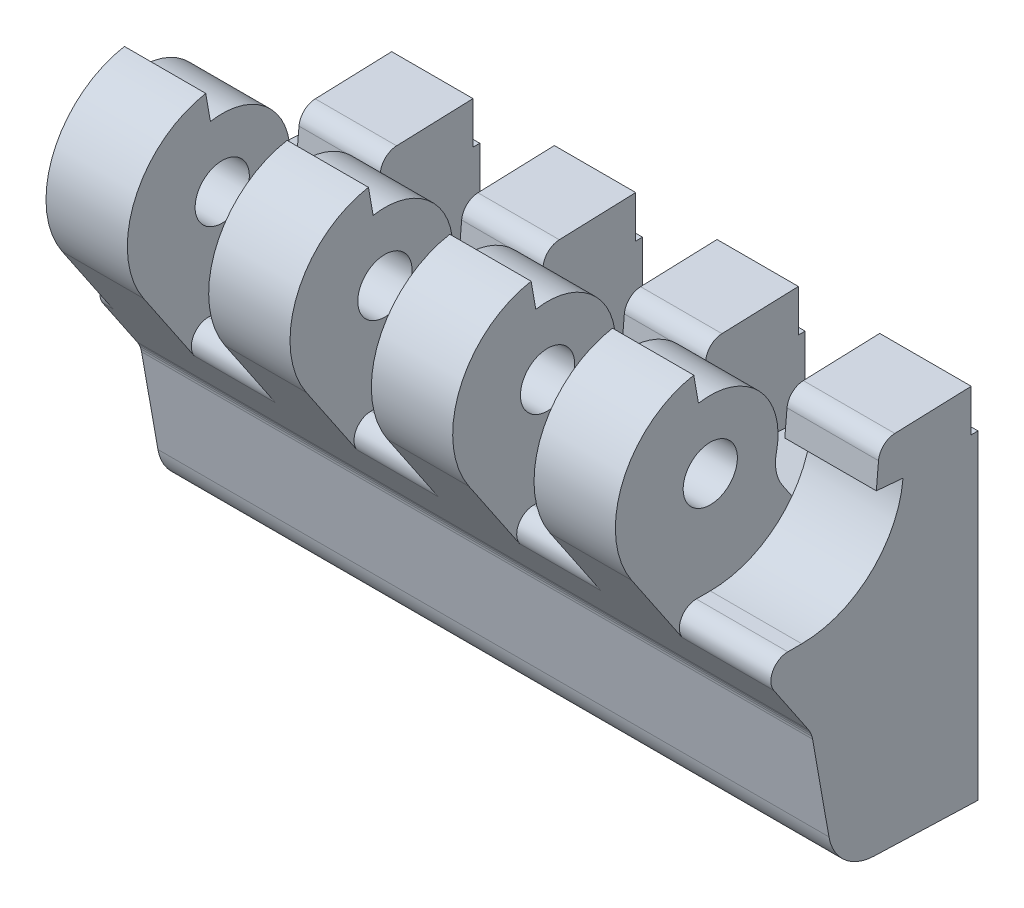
ISO-10303-21;
HEADER;
FILE_DESCRIPTION(('STEP AP214'),'2;1');
FILE_NAME('part.step','',(''),(''),'','','');
FILE_SCHEMA(('AUTOMOTIVE_DESIGN { 1 0 10303 214 1 1 1 1 }'));
ENDSEC;
DATA;
#1=APPLICATION_CONTEXT('core data for automotive mechanical design processes');
#2=APPLICATION_PROTOCOL_DEFINITION('international standard','automotive_design',2000,#1);
#3=PRODUCT_CONTEXT('',#1,'mechanical');
#4=PRODUCT('Part','Part','',(#3));
#5=PRODUCT_RELATED_PRODUCT_CATEGORY('part','',(#4));
#6=PRODUCT_DEFINITION_FORMATION('','',#4);
#7=PRODUCT_DEFINITION_CONTEXT('part definition',#1,'design');
#8=PRODUCT_DEFINITION('design','',#6,#7);
#9=PRODUCT_DEFINITION_SHAPE('','',#8);
#10=(LENGTH_UNIT() NAMED_UNIT(*) SI_UNIT(.MILLI.,.METRE.));
#11=(NAMED_UNIT(*) PLANE_ANGLE_UNIT() SI_UNIT($,.RADIAN.));
#12=(NAMED_UNIT(*) SI_UNIT($,.STERADIAN.) SOLID_ANGLE_UNIT());
#13=UNCERTAINTY_MEASURE_WITH_UNIT(LENGTH_MEASURE(1.E-05),#10,'distance_accuracy_value','');
#14=(GEOMETRIC_REPRESENTATION_CONTEXT(3) GLOBAL_UNCERTAINTY_ASSIGNED_CONTEXT((#13)) GLOBAL_UNIT_ASSIGNED_CONTEXT((#10,
#11,#12)) REPRESENTATION_CONTEXT('',''));
#15=CARTESIAN_POINT('',(0.,0.,0.));
#16=DIRECTION('',(0.,0.,1.));
#17=DIRECTION('',(1.,0.,0.));
#18=AXIS2_PLACEMENT_3D('',#15,#16,#17);
#19=CARTESIAN_POINT('',(-3.64,15.100365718,0.499999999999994));
#20=DIRECTION('',(0.,0.999999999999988,-1.58000029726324E-07));
#21=DIRECTION('',(0.,1.58000029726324E-07,0.999999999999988));
#22=AXIS2_PLACEMENT_3D('',#19,#20,#21);
#23=PLANE('',#22);
#24=DIRECTION('',(1.,0.,0.));
#25=VECTOR('',#24,1.);
#26=CARTESIAN_POINT('',(-3.64,15.100365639,0.));
#27=LINE('',#26,#25);
#28=CARTESIAN_POINT('',(-2.9,15.100365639,0.));
#29=VERTEX_POINT('',#28);
#30=CARTESIAN_POINT('',(3.1,15.100365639,0.));
#31=VERTEX_POINT('',#30);
#32=EDGE_CURVE('E1129',#29,#31,#27,.T.);
#33=ORIENTED_EDGE('',*,*,#32,.F.);
#34=DIRECTION('',(0.,-1.58000001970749E-07,-0.999999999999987));
#35=VECTOR('',#34,1.);
#36=CARTESIAN_POINT('',(-2.9,15.1003657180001,0.5));
#37=LINE('',#36,#35);
#38=CARTESIAN_POINT('',(-2.9,15.1003657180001,0.5));
#39=VERTEX_POINT('',#38);
#40=EDGE_CURVE('E606',#39,#29,#37,.T.);
#41=ORIENTED_EDGE('',*,*,#40,.F.);
#42=DIRECTION('',(1.,0.,0.));
#43=VECTOR('',#42,1.);
#44=CARTESIAN_POINT('',(-3.64,15.100365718,0.499999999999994));
#45=LINE('',#44,#43);
#46=CARTESIAN_POINT('',(3.1,15.100365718,0.499999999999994));
#47=VERTEX_POINT('',#46);
#48=EDGE_CURVE('E592',#39,#47,#45,.T.);
#49=ORIENTED_EDGE('',*,*,#48,.T.);
#50=DIRECTION('',(0.,1.58000001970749E-07,0.999999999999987));
#51=VECTOR('',#50,1.);
#52=CARTESIAN_POINT('',(3.1,15.100365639,0.));
#53=LINE('',#52,#51);
#54=EDGE_CURVE('E637',#31,#47,#53,.T.);
#55=ORIENTED_EDGE('',*,*,#54,.F.);
#56=EDGE_LOOP('',(#33,#41,#49,#55));
#57=FACE_BOUND('',#56,.T.);
#58=ADVANCED_FACE('F15',(#57),#23,.T.);
#59=CARTESIAN_POINT('',(-3.64,15.4999997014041,13.0000000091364));
#60=DIRECTION('',(1.,0.,0.));
#61=DIRECTION('',(0.,1.,0.));
#62=AXIS2_PLACEMENT_3D('',#59,#60,#61);
#63=CYLINDRICAL_SURFACE('',#62,7.5);
#64=DIRECTION('',(1.,0.,0.));
#65=VECTOR('',#64,1.);
#66=CARTESIAN_POINT('',(-3.64,14.846331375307,5.52853979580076));
#67=LINE('',#66,#65);
#68=CARTESIAN_POINT('',(-2.9,14.846331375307,5.52853979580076));
#69=VERTEX_POINT('',#68);
#70=CARTESIAN_POINT('',(3.1,14.846331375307,5.52853979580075));
#71=VERTEX_POINT('',#70);
#72=EDGE_CURVE('E1137',#69,#71,#67,.T.);
#73=ORIENTED_EDGE('',*,*,#72,.F.);
#74=CARTESIAN_POINT('',(-2.9,15.4999997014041,13.0000000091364));
#75=DIRECTION('',(1.,0.,0.));
#76=DIRECTION('',(0.,-1.,0.));
#77=AXIS2_PLACEMENT_3D('',#74,#75,#76);
#78=CIRCLE('',#77,7.5);
#79=CARTESIAN_POINT('',(-2.9,11.0401085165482,6.9701268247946));
#80=VERTEX_POINT('',#79);
#81=EDGE_CURVE('E617',#80,#69,#78,.T.);
#82=ORIENTED_EDGE('',*,*,#81,.F.);
#83=CARTESIAN_POINT('',(-2.9,15.4999997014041,13.0000000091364));
#84=DIRECTION('',(-1.,0.,0.));
#85=DIRECTION('',(0.,-1.,0.));
#86=AXIS2_PLACEMENT_3D('',#83,#84,#85);
#87=CIRCLE('',#86,7.5);
#88=CARTESIAN_POINT('',(-2.9,7.9999997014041,13.0000000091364));
#89=VERTEX_POINT('',#88);
#90=EDGE_CURVE('E986',#80,#89,#87,.T.);
#91=ORIENTED_EDGE('',*,*,#90,.T.);
#92=DIRECTION('',(1.,0.,0.));
#93=VECTOR('',#92,1.);
#94=CARTESIAN_POINT('',(-3.64,7.9999997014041,13.0000000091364));
#95=LINE('',#94,#93);
#96=CARTESIAN_POINT('',(3.1,7.9999997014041,13.0000000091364));
#97=VERTEX_POINT('',#96);
#98=EDGE_CURVE('E1135',#89,#97,#95,.T.);
#99=ORIENTED_EDGE('',*,*,#98,.T.);
#100=CARTESIAN_POINT('',(3.1,15.4999997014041,13.0000000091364));
#101=DIRECTION('',(1.,0.,0.));
#102=DIRECTION('',(0.,1.,0.));
#103=AXIS2_PLACEMENT_3D('',#100,#101,#102);
#104=CIRCLE('',#103,7.5);
#105=CARTESIAN_POINT('',(3.1,11.0401085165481,6.9701268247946));
#106=VERTEX_POINT('',#105);
#107=EDGE_CURVE('E928',#97,#106,#104,.T.);
#108=ORIENTED_EDGE('',*,*,#107,.T.);
#109=CARTESIAN_POINT('',(3.1,15.4999997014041,13.0000000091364));
#110=DIRECTION('',(-1.,0.,0.));
#111=DIRECTION('',(0.,1.,0.));
#112=AXIS2_PLACEMENT_3D('',#109,#110,#111);
#113=CIRCLE('',#112,7.5);
#114=EDGE_CURVE('E655',#71,#106,#113,.T.);
#115=ORIENTED_EDGE('',*,*,#114,.F.);
#116=EDGE_LOOP('',(#73,#82,#91,#99,#108,#115));
#117=FACE_BOUND('',#116,.T.);
#118=ADVANCED_FACE('F1497',(#117),#63,.F.);
#119=CARTESIAN_POINT('',(-3.64,14.846331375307,5.52853979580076));
#120=DIRECTION('',(0.,-0.996194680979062,0.0871559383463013));
#121=DIRECTION('',(0.,-0.0871559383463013,-0.996194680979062));
#122=AXIS2_PLACEMENT_3D('',#119,#120,#121);
#123=PLANE('',#122);
#124=DIRECTION('',(1.,0.,0.));
#125=VECTOR('',#124,1.);
#126=CARTESIAN_POINT('',(-3.64,15.0188121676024,7.49999981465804));
#127=LINE('',#126,#125);
#128=CARTESIAN_POINT('',(-2.9,15.0188121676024,7.49999981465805));
#129=VERTEX_POINT('',#128);
#130=CARTESIAN_POINT('',(3.1,15.0188121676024,7.49999981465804));
#131=VERTEX_POINT('',#130);
#132=EDGE_CURVE('E1139',#129,#131,#127,.T.);
#133=ORIENTED_EDGE('',*,*,#132,.F.);
#134=DIRECTION('',(0.,0.0871559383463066,0.996194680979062));
#135=VECTOR('',#134,1.);
#136=CARTESIAN_POINT('',(-2.9,14.846331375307,5.52853979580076));
#137=LINE('',#136,#135);
#138=EDGE_CURVE('E619',#69,#129,#137,.T.);
#139=ORIENTED_EDGE('',*,*,#138,.F.);
#140=ORIENTED_EDGE('',*,*,#72,.T.);
#141=DIRECTION('',(0.,-0.0871559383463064,-0.996194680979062));
#142=VECTOR('',#141,1.);
#143=CARTESIAN_POINT('',(3.1,15.0188121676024,7.49999981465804));
#144=LINE('',#143,#142);
#145=EDGE_CURVE('E652',#131,#71,#144,.T.);
#146=ORIENTED_EDGE('',*,*,#145,.F.);
#147=EDGE_LOOP('',(#133,#139,#140,#146));
#148=FACE_BOUND('',#147,.T.);
#149=ADVANCED_FACE('F1546',(#148),#123,.T.);
#150=CARTESIAN_POINT('',(-3.64,15.0188121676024,7.49999981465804));
#151=DIRECTION('',(0.,0.0871556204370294,0.996194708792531));
#152=DIRECTION('',(0.,-0.996194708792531,0.0871556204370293));
#153=AXIS2_PLACEMENT_3D('',#150,#151,#152);
#154=PLANE('',#153);
#155=DIRECTION('',(1.,0.,0.));
#156=VECTOR('',#155,1.);
#157=CARTESIAN_POINT('',(-3.64,16.8654033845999,7.33844424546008));
#158=LINE('',#157,#156);
#159=CARTESIAN_POINT('',(-2.9,16.8654033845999,7.33844424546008));
#160=VERTEX_POINT('',#159);
#161=CARTESIAN_POINT('',(3.1,16.8654033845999,7.33844424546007));
#162=VERTEX_POINT('',#161);
#163=EDGE_CURVE('E1141',#160,#162,#158,.T.);
#164=ORIENTED_EDGE('',*,*,#163,.F.);
#165=DIRECTION('',(0.,0.996194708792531,-0.0871556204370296));
#166=VECTOR('',#165,1.);
#167=CARTESIAN_POINT('',(-2.9,15.0188121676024,7.49999981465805));
#168=LINE('',#167,#166);
#169=EDGE_CURVE('E621',#129,#160,#168,.T.);
#170=ORIENTED_EDGE('',*,*,#169,.F.);
#171=ORIENTED_EDGE('',*,*,#132,.T.);
#172=DIRECTION('',(0.,-0.996194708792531,0.0871556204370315));
#173=VECTOR('',#172,1.);
#174=CARTESIAN_POINT('',(3.1,16.8654033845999,7.33844424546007));
#175=LINE('',#174,#173);
#176=EDGE_CURVE('E649',#162,#131,#175,.T.);
#177=ORIENTED_EDGE('',*,*,#176,.F.);
#178=EDGE_LOOP('',(#164,#170,#171,#177));
#179=FACE_BOUND('',#178,.T.);
#180=ADVANCED_FACE('F1551',(#179),#154,.T.);
#181=CARTESIAN_POINT('',(-3.64,16.7564587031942,6.09320087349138));
#182=DIRECTION('',(1.,0.,0.));
#183=DIRECTION('',(0.,1.,0.));
#184=AXIS2_PLACEMENT_3D('',#181,#182,#183);
#185=CYLINDRICAL_SURFACE('',#184,1.24999999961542);
#186=DIRECTION('',(1.,0.,0.));
#187=VECTOR('',#186,1.);
#188=CARTESIAN_POINT('',(-3.64,18.0056972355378,6.13682527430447));
#189=LINE('',#188,#187);
#190=CARTESIAN_POINT('',(-2.9,18.0056972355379,6.13682527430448));
#191=VERTEX_POINT('',#190);
#192=CARTESIAN_POINT('',(3.1,18.0056972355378,6.13682527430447));
#193=VERTEX_POINT('',#192);
#194=EDGE_CURVE('E1143',#191,#193,#189,.T.);
#195=ORIENTED_EDGE('',*,*,#194,.F.);
#196=CARTESIAN_POINT('',(-2.9,16.7564587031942,6.09320087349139));
#197=DIRECTION('',(-1.,0.,0.));
#198=DIRECTION('',(0.,-1.,0.));
#199=AXIS2_PLACEMENT_3D('',#196,#197,#198);
#200=CIRCLE('',#199,1.24999999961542);
#201=EDGE_CURVE('E623',#160,#191,#200,.T.);
#202=ORIENTED_EDGE('',*,*,#201,.F.);
#203=ORIENTED_EDGE('',*,*,#163,.T.);
#204=CARTESIAN_POINT('',(3.1,16.7564587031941,6.09320087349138));
#205=DIRECTION('',(1.,0.,0.));
#206=DIRECTION('',(0.,1.,0.));
#207=AXIS2_PLACEMENT_3D('',#204,#205,#206);
#208=CIRCLE('',#207,1.24999999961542);
#209=EDGE_CURVE('E646',#193,#162,#208,.T.);
#210=ORIENTED_EDGE('',*,*,#209,.F.);
#211=EDGE_LOOP('',(#195,#202,#203,#210));
#212=FACE_BOUND('',#211,.T.);
#213=ADVANCED_FACE('F1555',(#212),#185,.T.);
#214=CARTESIAN_POINT('',(-3.64,18.0056972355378,6.13682527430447));
#215=DIRECTION('',(0.,0.999390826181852,0.0348995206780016));
#216=DIRECTION('',(0.,-0.0348995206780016,0.999390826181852));
#217=AXIS2_PLACEMENT_3D('',#214,#215,#216);
#218=PLANE('',#217);
#219=DIRECTION('',(1.,0.,0.));
#220=VECTOR('',#219,1.);
#221=CARTESIAN_POINT('',(-3.64,18.202539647,0.499999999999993));
#222=LINE('',#221,#220);
#223=CARTESIAN_POINT('',(-2.9,18.2025396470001,0.499999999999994));
#224=VERTEX_POINT('',#223);
#225=CARTESIAN_POINT('',(3.1,18.202539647,0.499999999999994));
#226=VERTEX_POINT('',#225);
#227=EDGE_CURVE('E1145',#224,#226,#222,.T.);
#228=ORIENTED_EDGE('',*,*,#227,.F.);
#229=DIRECTION('',(0.,0.0348995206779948,-0.999390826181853));
#230=VECTOR('',#229,1.);
#231=CARTESIAN_POINT('',(-2.9,18.0056972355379,6.13682527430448));
#232=LINE('',#231,#230);
#233=EDGE_CURVE('E625',#191,#224,#232,.T.);
#234=ORIENTED_EDGE('',*,*,#233,.F.);
#235=ORIENTED_EDGE('',*,*,#194,.T.);
#236=DIRECTION('',(0.,-0.0348995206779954,0.999390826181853));
#237=VECTOR('',#236,1.);
#238=CARTESIAN_POINT('',(3.1,18.202539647,0.499999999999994));
#239=LINE('',#238,#237);
#240=EDGE_CURVE('E643',#226,#193,#239,.T.);
#241=ORIENTED_EDGE('',*,*,#240,.F.);
#242=EDGE_LOOP('',(#228,#234,#235,#241));
#243=FACE_BOUND('',#242,.T.);
#244=ADVANCED_FACE('F1560',(#243),#218,.T.);
#245=CARTESIAN_POINT('',(-3.64,15.100365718,0.499999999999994));
#246=DIRECTION('',(0.,0.,-1.));
#247=DIRECTION('',(-1.,0.,0.));
#248=AXIS2_PLACEMENT_3D('',#245,#246,#247);
#249=PLANE('',#248);
#250=ORIENTED_EDGE('',*,*,#48,.F.);
#251=DIRECTION('',(0.,-1.,0.));
#252=VECTOR('',#251,1.);
#253=CARTESIAN_POINT('',(-2.9,18.2025396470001,0.499999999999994));
#254=LINE('',#253,#252);
#255=EDGE_CURVE('E627',#224,#39,#254,.T.);
#256=ORIENTED_EDGE('',*,*,#255,.F.);
#257=ORIENTED_EDGE('',*,*,#227,.T.);
#258=DIRECTION('',(0.,1.,0.));
#259=VECTOR('',#258,1.);
#260=CARTESIAN_POINT('',(3.1,15.100365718,0.499999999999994));
#261=LINE('',#260,#259);
#262=EDGE_CURVE('E640',#47,#226,#261,.T.);
#263=ORIENTED_EDGE('',*,*,#262,.F.);
#264=EDGE_LOOP('',(#250,#256,#257,#263));
#265=FACE_BOUND('',#264,.T.);
#266=ADVANCED_FACE('F1565',(#265),#249,.T.);
#267=CARTESIAN_POINT('',(8.61,15.100365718,0.499999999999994));
#268=DIRECTION('',(0.,0.999999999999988,-1.58000029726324E-07));
#269=DIRECTION('',(0.,1.58000029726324E-07,0.999999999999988));
#270=AXIS2_PLACEMENT_3D('',#267,#268,#269);
#271=PLANE('',#270);
#272=DIRECTION('',(1.,0.,0.));
#273=VECTOR('',#272,1.);
#274=CARTESIAN_POINT('',(8.61,15.100365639,0.));
#275=LINE('',#274,#273);
#276=CARTESIAN_POINT('',(9.1,15.100365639,0.));
#277=VERTEX_POINT('',#276);
#278=CARTESIAN_POINT('',(15.1,15.100365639,0.));
#279=VERTEX_POINT('',#278);
#280=EDGE_CURVE('E1159',#277,#279,#275,.T.);
#281=ORIENTED_EDGE('',*,*,#280,.F.);
#282=DIRECTION('',(0.,-1.58000001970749E-07,-0.999999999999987));
#283=VECTOR('',#282,1.);
#284=CARTESIAN_POINT('',(9.1,15.100365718,0.499999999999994));
#285=LINE('',#284,#283);
#286=CARTESIAN_POINT('',(9.1,15.100365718,0.499999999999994));
#287=VERTEX_POINT('',#286);
#288=EDGE_CURVE('E678',#287,#277,#285,.T.);
#289=ORIENTED_EDGE('',*,*,#288,.F.);
#290=DIRECTION('',(1.,0.,0.));
#291=VECTOR('',#290,1.);
#292=CARTESIAN_POINT('',(8.61,15.100365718,0.499999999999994));
#293=LINE('',#292,#291);
#294=CARTESIAN_POINT('',(15.1,15.1003657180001,0.499999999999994));
#295=VERTEX_POINT('',#294);
#296=EDGE_CURVE('E1177',#287,#295,#293,.T.);
#297=ORIENTED_EDGE('',*,*,#296,.T.);
#298=DIRECTION('',(0.,1.58000001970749E-07,0.999999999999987));
#299=VECTOR('',#298,1.);
#300=CARTESIAN_POINT('',(15.1,15.100365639,0.));
#301=LINE('',#300,#299);
#302=EDGE_CURVE('E689',#279,#295,#301,.T.);
#303=ORIENTED_EDGE('',*,*,#302,.F.);
#304=EDGE_LOOP('',(#281,#289,#297,#303));
#305=FACE_BOUND('',#304,.T.);
#306=ADVANCED_FACE('F1578',(#305),#271,.T.);
#307=CARTESIAN_POINT('',(8.61,15.4999997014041,13.0000000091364));
#308=DIRECTION('',(1.,0.,0.));
#309=DIRECTION('',(0.,1.,0.));
#310=AXIS2_PLACEMENT_3D('',#307,#308,#309);
#311=CYLINDRICAL_SURFACE('',#310,7.5);
#312=DIRECTION('',(1.,0.,0.));
#313=VECTOR('',#312,1.);
#314=CARTESIAN_POINT('',(8.61,14.846331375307,5.52853979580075));
#315=LINE('',#314,#313);
#316=CARTESIAN_POINT('',(9.1,14.846331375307,5.52853979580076));
#317=VERTEX_POINT('',#316);
#318=CARTESIAN_POINT('',(15.1,14.846331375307,5.52853979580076));
#319=VERTEX_POINT('',#318);
#320=EDGE_CURVE('E1167',#317,#319,#315,.T.);
#321=ORIENTED_EDGE('',*,*,#320,.F.);
#322=CARTESIAN_POINT('',(9.1,15.4999997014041,13.0000000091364));
#323=DIRECTION('',(1.,0.,0.));
#324=DIRECTION('',(0.,-1.,0.));
#325=AXIS2_PLACEMENT_3D('',#322,#323,#324);
#326=CIRCLE('',#325,7.5);
#327=CARTESIAN_POINT('',(9.1,11.0401085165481,6.9701268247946));
#328=VERTEX_POINT('',#327);
#329=EDGE_CURVE('E666',#328,#317,#326,.T.);
#330=ORIENTED_EDGE('',*,*,#329,.F.);
#331=CARTESIAN_POINT('',(9.1,15.4999997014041,13.0000000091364));
#332=DIRECTION('',(-1.,0.,0.));
#333=DIRECTION('',(0.,-1.,0.));
#334=AXIS2_PLACEMENT_3D('',#331,#332,#333);
#335=CIRCLE('',#334,7.5);
#336=CARTESIAN_POINT('',(9.1,7.9999997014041,13.0000000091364));
#337=VERTEX_POINT('',#336);
#338=EDGE_CURVE('E916',#328,#337,#335,.T.);
#339=ORIENTED_EDGE('',*,*,#338,.T.);
#340=DIRECTION('',(1.,0.,0.));
#341=VECTOR('',#340,1.);
#342=CARTESIAN_POINT('',(8.61,7.9999997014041,13.0000000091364));
#343=LINE('',#342,#341);
#344=CARTESIAN_POINT('',(15.1,7.9999997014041,13.0000000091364));
#345=VERTEX_POINT('',#344);
#346=EDGE_CURVE('E1165',#337,#345,#343,.T.);
#347=ORIENTED_EDGE('',*,*,#346,.T.);
#348=CARTESIAN_POINT('',(15.1,15.4999997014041,13.0000000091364));
#349=DIRECTION('',(1.,0.,0.));
#350=DIRECTION('',(0.,1.,0.));
#351=AXIS2_PLACEMENT_3D('',#348,#349,#350);
#352=CIRCLE('',#351,7.5);
#353=CARTESIAN_POINT('',(15.1,11.0401085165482,6.97012682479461));
#354=VERTEX_POINT('',#353);
#355=EDGE_CURVE('E858',#345,#354,#352,.T.);
#356=ORIENTED_EDGE('',*,*,#355,.T.);
#357=CARTESIAN_POINT('',(15.1,15.4999997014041,13.0000000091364));
#358=DIRECTION('',(-1.,0.,0.));
#359=DIRECTION('',(0.,1.,0.));
#360=AXIS2_PLACEMENT_3D('',#357,#358,#359);
#361=CIRCLE('',#360,7.5);
#362=EDGE_CURVE('E707',#319,#354,#361,.T.);
#363=ORIENTED_EDGE('',*,*,#362,.F.);
#364=EDGE_LOOP('',(#321,#330,#339,#347,#356,#363));
#365=FACE_BOUND('',#364,.T.);
#366=ADVANCED_FACE('F1608',(#365),#311,.F.);
#367=CARTESIAN_POINT('',(8.61,14.846331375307,5.52853979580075));
#368=DIRECTION('',(0.,-0.996194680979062,0.0871559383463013));
#369=DIRECTION('',(0.,-0.0871559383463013,-0.996194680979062));
#370=AXIS2_PLACEMENT_3D('',#367,#368,#369);
#371=PLANE('',#370);
#372=DIRECTION('',(1.,0.,0.));
#373=VECTOR('',#372,1.);
#374=CARTESIAN_POINT('',(8.61,15.0188121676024,7.49999981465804));
#375=LINE('',#374,#373);
#376=CARTESIAN_POINT('',(9.1,15.0188121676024,7.49999981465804));
#377=VERTEX_POINT('',#376);
#378=CARTESIAN_POINT('',(15.1,15.0188121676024,7.49999981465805));
#379=VERTEX_POINT('',#378);
#380=EDGE_CURVE('E1169',#377,#379,#375,.T.);
#381=ORIENTED_EDGE('',*,*,#380,.F.);
#382=DIRECTION('',(0.,0.0871559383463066,0.996194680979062));
#383=VECTOR('',#382,1.);
#384=CARTESIAN_POINT('',(9.1,14.846331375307,5.52853979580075));
#385=LINE('',#384,#383);
#386=EDGE_CURVE('E668',#317,#377,#385,.T.);
#387=ORIENTED_EDGE('',*,*,#386,.F.);
#388=ORIENTED_EDGE('',*,*,#320,.T.);
#389=DIRECTION('',(0.,-0.0871559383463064,-0.996194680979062));
#390=VECTOR('',#389,1.);
#391=CARTESIAN_POINT('',(15.1,15.0188121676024,7.49999981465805));
#392=LINE('',#391,#390);
#393=EDGE_CURVE('E704',#379,#319,#392,.T.);
#394=ORIENTED_EDGE('',*,*,#393,.F.);
#395=EDGE_LOOP('',(#381,#387,#388,#394));
#396=FACE_BOUND('',#395,.T.);
#397=ADVANCED_FACE('F1604',(#396),#371,.T.);
#398=CARTESIAN_POINT('',(8.61,15.0188121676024,7.49999981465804));
#399=DIRECTION('',(0.,0.0871556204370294,0.996194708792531));
#400=DIRECTION('',(0.,-0.996194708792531,0.0871556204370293));
#401=AXIS2_PLACEMENT_3D('',#398,#399,#400);
#402=PLANE('',#401);
#403=DIRECTION('',(1.,0.,0.));
#404=VECTOR('',#403,1.);
#405=CARTESIAN_POINT('',(8.61,16.8654033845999,7.33844424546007));
#406=LINE('',#405,#404);
#407=CARTESIAN_POINT('',(9.1,16.8654033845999,7.33844424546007));
#408=VERTEX_POINT('',#407);
#409=CARTESIAN_POINT('',(15.1,16.8654033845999,7.33844424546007));
#410=VERTEX_POINT('',#409);
#411=EDGE_CURVE('E1171',#408,#410,#406,.T.);
#412=ORIENTED_EDGE('',*,*,#411,.F.);
#413=DIRECTION('',(0.,0.996194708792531,-0.0871556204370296));
#414=VECTOR('',#413,1.);
#415=CARTESIAN_POINT('',(9.1,15.0188121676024,7.49999981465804));
#416=LINE('',#415,#414);
#417=EDGE_CURVE('E670',#377,#408,#416,.T.);
#418=ORIENTED_EDGE('',*,*,#417,.F.);
#419=ORIENTED_EDGE('',*,*,#380,.T.);
#420=DIRECTION('',(0.,-0.996194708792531,0.0871556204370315));
#421=VECTOR('',#420,1.);
#422=CARTESIAN_POINT('',(15.1,16.8654033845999,7.33844424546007));
#423=LINE('',#422,#421);
#424=EDGE_CURVE('E701',#410,#379,#423,.T.);
#425=ORIENTED_EDGE('',*,*,#424,.F.);
#426=EDGE_LOOP('',(#412,#418,#419,#425));
#427=FACE_BOUND('',#426,.T.);
#428=ADVANCED_FACE('F1599',(#427),#402,.T.);
#429=CARTESIAN_POINT('',(8.61,16.7564587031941,6.09320087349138));
#430=DIRECTION('',(1.,0.,0.));
#431=DIRECTION('',(0.,1.,0.));
#432=AXIS2_PLACEMENT_3D('',#429,#430,#431);
#433=CYLINDRICAL_SURFACE('',#432,1.24999999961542);
#434=DIRECTION('',(1.,0.,0.));
#435=VECTOR('',#434,1.);
#436=CARTESIAN_POINT('',(8.61,18.0056972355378,6.13682527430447));
#437=LINE('',#436,#435);
#438=CARTESIAN_POINT('',(9.1,18.0056972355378,6.13682527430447));
#439=VERTEX_POINT('',#438);
#440=CARTESIAN_POINT('',(15.1,18.0056972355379,6.13682527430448));
#441=VERTEX_POINT('',#440);
#442=EDGE_CURVE('E1173',#439,#441,#437,.T.);
#443=ORIENTED_EDGE('',*,*,#442,.F.);
#444=CARTESIAN_POINT('',(9.1,16.7564587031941,6.09320087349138));
#445=DIRECTION('',(-1.,0.,0.));
#446=DIRECTION('',(0.,-1.,0.));
#447=AXIS2_PLACEMENT_3D('',#444,#445,#446);
#448=CIRCLE('',#447,1.24999999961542);
#449=EDGE_CURVE('E672',#408,#439,#448,.T.);
#450=ORIENTED_EDGE('',*,*,#449,.F.);
#451=ORIENTED_EDGE('',*,*,#411,.T.);
#452=CARTESIAN_POINT('',(15.1,16.7564587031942,6.09320087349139));
#453=DIRECTION('',(1.,0.,0.));
#454=DIRECTION('',(0.,1.,0.));
#455=AXIS2_PLACEMENT_3D('',#452,#453,#454);
#456=CIRCLE('',#455,1.24999999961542);
#457=EDGE_CURVE('E698',#441,#410,#456,.T.);
#458=ORIENTED_EDGE('',*,*,#457,.F.);
#459=EDGE_LOOP('',(#443,#450,#451,#458));
#460=FACE_BOUND('',#459,.T.);
#461=ADVANCED_FACE('F1594',(#460),#433,.T.);
#462=CARTESIAN_POINT('',(8.61,18.0056972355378,6.13682527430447));
#463=DIRECTION('',(0.,0.999390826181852,0.0348995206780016));
#464=DIRECTION('',(0.,-0.0348995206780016,0.999390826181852));
#465=AXIS2_PLACEMENT_3D('',#462,#463,#464);
#466=PLANE('',#465);
#467=DIRECTION('',(1.,0.,0.));
#468=VECTOR('',#467,1.);
#469=CARTESIAN_POINT('',(8.61,18.202539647,0.499999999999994));
#470=LINE('',#469,#468);
#471=CARTESIAN_POINT('',(9.1,18.202539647,0.499999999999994));
#472=VERTEX_POINT('',#471);
#473=CARTESIAN_POINT('',(15.1,18.2025396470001,0.499999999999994));
#474=VERTEX_POINT('',#473);
#475=EDGE_CURVE('E1175',#472,#474,#470,.T.);
#476=ORIENTED_EDGE('',*,*,#475,.F.);
#477=DIRECTION('',(0.,0.0348995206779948,-0.999390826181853));
#478=VECTOR('',#477,1.);
#479=CARTESIAN_POINT('',(9.1,18.0056972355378,6.13682527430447));
#480=LINE('',#479,#478);
#481=EDGE_CURVE('E674',#439,#472,#480,.T.);
#482=ORIENTED_EDGE('',*,*,#481,.F.);
#483=ORIENTED_EDGE('',*,*,#442,.T.);
#484=DIRECTION('',(0.,-0.0348995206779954,0.999390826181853));
#485=VECTOR('',#484,1.);
#486=CARTESIAN_POINT('',(15.1,18.2025396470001,0.499999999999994));
#487=LINE('',#486,#485);
#488=EDGE_CURVE('E695',#474,#441,#487,.T.);
#489=ORIENTED_EDGE('',*,*,#488,.F.);
#490=EDGE_LOOP('',(#476,#482,#483,#489));
#491=FACE_BOUND('',#490,.T.);
#492=ADVANCED_FACE('F1589',(#491),#466,.T.);
#493=CARTESIAN_POINT('',(8.61,15.100365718,0.499999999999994));
#494=DIRECTION('',(0.,0.,-1.));
#495=DIRECTION('',(-1.,0.,0.));
#496=AXIS2_PLACEMENT_3D('',#493,#494,#495);
#497=PLANE('',#496);
#498=ORIENTED_EDGE('',*,*,#296,.F.);
#499=DIRECTION('',(0.,-1.,0.));
#500=VECTOR('',#499,1.);
#501=CARTESIAN_POINT('',(9.1,18.202539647,0.499999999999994));
#502=LINE('',#501,#500);
#503=EDGE_CURVE('E676',#472,#287,#502,.T.);
#504=ORIENTED_EDGE('',*,*,#503,.F.);
#505=ORIENTED_EDGE('',*,*,#475,.T.);
#506=DIRECTION('',(0.,1.,0.));
#507=VECTOR('',#506,1.);
#508=CARTESIAN_POINT('',(15.1,15.1003657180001,0.499999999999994));
#509=LINE('',#508,#507);
#510=EDGE_CURVE('E692',#295,#474,#509,.T.);
#511=ORIENTED_EDGE('',*,*,#510,.F.);
#512=EDGE_LOOP('',(#498,#504,#505,#511));
#513=FACE_BOUND('',#512,.T.);
#514=ADVANCED_FACE('F1582',(#513),#497,.T.);
#515=CARTESIAN_POINT('',(20.86,15.100365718,0.499999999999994));
#516=DIRECTION('',(0.,0.999999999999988,-1.58000029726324E-07));
#517=DIRECTION('',(0.,1.58000029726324E-07,0.999999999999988));
#518=AXIS2_PLACEMENT_3D('',#515,#516,#517);
#519=PLANE('',#518);
#520=DIRECTION('',(1.,0.,0.));
#521=VECTOR('',#520,1.);
#522=CARTESIAN_POINT('',(20.86,15.100365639,0.));
#523=LINE('',#522,#521);
#524=CARTESIAN_POINT('',(21.1,15.100365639,0.));
#525=VERTEX_POINT('',#524);
#526=CARTESIAN_POINT('',(27.1,15.100365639,0.));
#527=VERTEX_POINT('',#526);
#528=EDGE_CURVE('E1191',#525,#527,#523,.T.);
#529=ORIENTED_EDGE('',*,*,#528,.F.);
#530=DIRECTION('',(0.,-1.58000001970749E-07,-0.999999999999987));
#531=VECTOR('',#530,1.);
#532=CARTESIAN_POINT('',(21.1,15.100365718,0.499999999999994));
#533=LINE('',#532,#531);
#534=CARTESIAN_POINT('',(21.1,15.100365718,0.499999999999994));
#535=VERTEX_POINT('',#534);
#536=EDGE_CURVE('E730',#535,#525,#533,.T.);
#537=ORIENTED_EDGE('',*,*,#536,.F.);
#538=DIRECTION('',(1.,0.,0.));
#539=VECTOR('',#538,1.);
#540=CARTESIAN_POINT('',(20.86,15.100365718,0.499999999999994));
#541=LINE('',#540,#539);
#542=CARTESIAN_POINT('',(27.1,15.100365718,0.499999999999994));
#543=VERTEX_POINT('',#542);
#544=EDGE_CURVE('E1209',#535,#543,#541,.T.);
#545=ORIENTED_EDGE('',*,*,#544,.T.);
#546=DIRECTION('',(0.,1.58000001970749E-07,0.999999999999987));
#547=VECTOR('',#546,1.);
#548=CARTESIAN_POINT('',(27.1,15.100365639,0.));
#549=LINE('',#548,#547);
#550=EDGE_CURVE('E741',#527,#543,#549,.T.);
#551=ORIENTED_EDGE('',*,*,#550,.F.);
#552=EDGE_LOOP('',(#529,#537,#545,#551));
#553=FACE_BOUND('',#552,.T.);
#554=ADVANCED_FACE('F1319',(#553),#519,.T.);
#555=CARTESIAN_POINT('',(20.86,15.4999997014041,13.0000000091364));
#556=DIRECTION('',(1.,0.,0.));
#557=DIRECTION('',(0.,1.,0.));
#558=AXIS2_PLACEMENT_3D('',#555,#556,#557);
#559=CYLINDRICAL_SURFACE('',#558,7.5);
#560=DIRECTION('',(1.,0.,0.));
#561=VECTOR('',#560,1.);
#562=CARTESIAN_POINT('',(20.86,14.846331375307,5.52853979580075));
#563=LINE('',#562,#561);
#564=CARTESIAN_POINT('',(21.1,14.846331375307,5.52853979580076));
#565=VERTEX_POINT('',#564);
#566=CARTESIAN_POINT('',(27.1,14.846331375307,5.52853979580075));
#567=VERTEX_POINT('',#566);
#568=EDGE_CURVE('E1199',#565,#567,#563,.T.);
#569=ORIENTED_EDGE('',*,*,#568,.F.);
#570=CARTESIAN_POINT('',(21.1,15.4999997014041,13.0000000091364));
#571=DIRECTION('',(1.,0.,0.));
#572=DIRECTION('',(0.,-1.,0.));
#573=AXIS2_PLACEMENT_3D('',#570,#571,#572);
#574=CIRCLE('',#573,7.5);
#575=CARTESIAN_POINT('',(21.1,11.0401085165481,6.9701268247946));
#576=VERTEX_POINT('',#575);
#577=EDGE_CURVE('E718',#576,#565,#574,.T.);
#578=ORIENTED_EDGE('',*,*,#577,.F.);
#579=CARTESIAN_POINT('',(21.1,15.4999997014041,13.0000000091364));
#580=DIRECTION('',(-1.,0.,0.));
#581=DIRECTION('',(0.,-1.,0.));
#582=AXIS2_PLACEMENT_3D('',#579,#580,#581);
#583=CIRCLE('',#582,7.5);
#584=CARTESIAN_POINT('',(21.1,7.9999997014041,13.0000000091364));
#585=VERTEX_POINT('',#584);
#586=EDGE_CURVE('E846',#576,#585,#583,.T.);
#587=ORIENTED_EDGE('',*,*,#586,.T.);
#588=DIRECTION('',(1.,0.,0.));
#589=VECTOR('',#588,1.);
#590=CARTESIAN_POINT('',(20.86,7.9999997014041,13.0000000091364));
#591=LINE('',#590,#589);
#592=CARTESIAN_POINT('',(27.1,7.9999997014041,13.0000000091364));
#593=VERTEX_POINT('',#592);
#594=EDGE_CURVE('E1197',#585,#593,#591,.T.);
#595=ORIENTED_EDGE('',*,*,#594,.T.);
#596=CARTESIAN_POINT('',(27.1,15.4999997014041,13.0000000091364));
#597=DIRECTION('',(-1.,0.,0.));
#598=DIRECTION('',(0.,-1.,0.));
#599=AXIS2_PLACEMENT_3D('',#596,#597,#598);
#600=CIRCLE('',#599,7.5);
#601=CARTESIAN_POINT('',(27.1,11.0401085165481,6.9701268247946));
#602=VERTEX_POINT('',#601);
#603=EDGE_CURVE('E1193',#593,#602,#600,.F.);
#604=ORIENTED_EDGE('',*,*,#603,.T.);
#605=CARTESIAN_POINT('',(27.1,15.4999997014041,13.0000000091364));
#606=DIRECTION('',(-1.,0.,0.));
#607=DIRECTION('',(0.,1.,0.));
#608=AXIS2_PLACEMENT_3D('',#605,#606,#607);
#609=CIRCLE('',#608,7.5);
#610=EDGE_CURVE('E759',#567,#602,#609,.T.);
#611=ORIENTED_EDGE('',*,*,#610,.F.);
#612=EDGE_LOOP('',(#569,#578,#587,#595,#604,#611));
#613=FACE_BOUND('',#612,.T.);
#614=ADVANCED_FACE('F1349',(#613),#559,.F.);
#615=CARTESIAN_POINT('',(20.86,14.846331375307,5.52853979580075));
#616=DIRECTION('',(0.,-0.996194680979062,0.0871559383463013));
#617=DIRECTION('',(0.,-0.0871559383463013,-0.996194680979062));
#618=AXIS2_PLACEMENT_3D('',#615,#616,#617);
#619=PLANE('',#618);
#620=DIRECTION('',(1.,0.,0.));
#621=VECTOR('',#620,1.);
#622=CARTESIAN_POINT('',(20.86,15.0188121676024,7.49999981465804));
#623=LINE('',#622,#621);
#624=CARTESIAN_POINT('',(21.1,15.0188121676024,7.49999981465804));
#625=VERTEX_POINT('',#624);
#626=CARTESIAN_POINT('',(27.1,15.0188121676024,7.49999981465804));
#627=VERTEX_POINT('',#626);
#628=EDGE_CURVE('E1201',#625,#627,#623,.T.);
#629=ORIENTED_EDGE('',*,*,#628,.F.);
#630=DIRECTION('',(0.,0.0871559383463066,0.996194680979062));
#631=VECTOR('',#630,1.);
#632=CARTESIAN_POINT('',(21.1,14.846331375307,5.52853979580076));
#633=LINE('',#632,#631);
#634=EDGE_CURVE('E720',#565,#625,#633,.T.);
#635=ORIENTED_EDGE('',*,*,#634,.F.);
#636=ORIENTED_EDGE('',*,*,#568,.T.);
#637=DIRECTION('',(0.,-0.0871559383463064,-0.996194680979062));
#638=VECTOR('',#637,1.);
#639=CARTESIAN_POINT('',(27.1,15.0188121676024,7.49999981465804));
#640=LINE('',#639,#638);
#641=EDGE_CURVE('E756',#627,#567,#640,.T.);
#642=ORIENTED_EDGE('',*,*,#641,.F.);
#643=EDGE_LOOP('',(#629,#635,#636,#642));
#644=FACE_BOUND('',#643,.T.);
#645=ADVANCED_FACE('F1345',(#644),#619,.T.);
#646=CARTESIAN_POINT('',(20.86,15.0188121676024,7.49999981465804));
#647=DIRECTION('',(0.,0.0871556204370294,0.996194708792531));
#648=DIRECTION('',(0.,-0.996194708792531,0.0871556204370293));
#649=AXIS2_PLACEMENT_3D('',#646,#647,#648);
#650=PLANE('',#649);
#651=DIRECTION('',(1.,0.,0.));
#652=VECTOR('',#651,1.);
#653=CARTESIAN_POINT('',(20.86,16.8654033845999,7.33844424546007));
#654=LINE('',#653,#652);
#655=CARTESIAN_POINT('',(21.1,16.8654033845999,7.33844424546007));
#656=VERTEX_POINT('',#655);
#657=CARTESIAN_POINT('',(27.1,16.8654033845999,7.33844424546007));
#658=VERTEX_POINT('',#657);
#659=EDGE_CURVE('E1203',#656,#658,#654,.T.);
#660=ORIENTED_EDGE('',*,*,#659,.F.);
#661=DIRECTION('',(0.,0.996194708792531,-0.0871556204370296));
#662=VECTOR('',#661,1.);
#663=CARTESIAN_POINT('',(21.1,15.0188121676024,7.49999981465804));
#664=LINE('',#663,#662);
#665=EDGE_CURVE('E722',#625,#656,#664,.T.);
#666=ORIENTED_EDGE('',*,*,#665,.F.);
#667=ORIENTED_EDGE('',*,*,#628,.T.);
#668=DIRECTION('',(0.,-0.996194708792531,0.0871556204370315));
#669=VECTOR('',#668,1.);
#670=CARTESIAN_POINT('',(27.1,16.8654033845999,7.33844424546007));
#671=LINE('',#670,#669);
#672=EDGE_CURVE('E753',#658,#627,#671,.T.);
#673=ORIENTED_EDGE('',*,*,#672,.F.);
#674=EDGE_LOOP('',(#660,#666,#667,#673));
#675=FACE_BOUND('',#674,.T.);
#676=ADVANCED_FACE('F1340',(#675),#650,.T.);
#677=CARTESIAN_POINT('',(20.86,16.7564587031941,6.09320087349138));
#678=DIRECTION('',(1.,0.,0.));
#679=DIRECTION('',(0.,1.,0.));
#680=AXIS2_PLACEMENT_3D('',#677,#678,#679);
#681=CYLINDRICAL_SURFACE('',#680,1.24999999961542);
#682=DIRECTION('',(1.,0.,0.));
#683=VECTOR('',#682,1.);
#684=CARTESIAN_POINT('',(20.86,18.0056972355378,6.13682527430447));
#685=LINE('',#684,#683);
#686=CARTESIAN_POINT('',(21.1,18.0056972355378,6.13682527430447));
#687=VERTEX_POINT('',#686);
#688=CARTESIAN_POINT('',(27.1,18.0056972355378,6.13682527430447));
#689=VERTEX_POINT('',#688);
#690=EDGE_CURVE('E1205',#687,#689,#685,.T.);
#691=ORIENTED_EDGE('',*,*,#690,.F.);
#692=CARTESIAN_POINT('',(21.1,16.7564587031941,6.09320087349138));
#693=DIRECTION('',(-1.,0.,0.));
#694=DIRECTION('',(0.,-1.,0.));
#695=AXIS2_PLACEMENT_3D('',#692,#693,#694);
#696=CIRCLE('',#695,1.24999999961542);
#697=EDGE_CURVE('E724',#656,#687,#696,.T.);
#698=ORIENTED_EDGE('',*,*,#697,.F.);
#699=ORIENTED_EDGE('',*,*,#659,.T.);
#700=CARTESIAN_POINT('',(27.1,16.7564587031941,6.09320087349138));
#701=DIRECTION('',(1.,0.,0.));
#702=DIRECTION('',(0.,1.,0.));
#703=AXIS2_PLACEMENT_3D('',#700,#701,#702);
#704=CIRCLE('',#703,1.24999999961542);
#705=EDGE_CURVE('E750',#689,#658,#704,.T.);
#706=ORIENTED_EDGE('',*,*,#705,.F.);
#707=EDGE_LOOP('',(#691,#698,#699,#706));
#708=FACE_BOUND('',#707,.T.);
#709=ADVANCED_FACE('F1335',(#708),#681,.T.);
#710=CARTESIAN_POINT('',(20.86,18.0056972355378,6.13682527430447));
#711=DIRECTION('',(0.,0.999390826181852,0.0348995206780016));
#712=DIRECTION('',(0.,-0.0348995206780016,0.999390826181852));
#713=AXIS2_PLACEMENT_3D('',#710,#711,#712);
#714=PLANE('',#713);
#715=DIRECTION('',(1.,0.,0.));
#716=VECTOR('',#715,1.);
#717=CARTESIAN_POINT('',(20.86,18.202539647,0.499999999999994));
#718=LINE('',#717,#716);
#719=CARTESIAN_POINT('',(21.1,18.202539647,0.499999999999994));
#720=VERTEX_POINT('',#719);
#721=CARTESIAN_POINT('',(27.1,18.202539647,0.5));
#722=VERTEX_POINT('',#721);
#723=EDGE_CURVE('E1207',#720,#722,#718,.T.);
#724=ORIENTED_EDGE('',*,*,#723,.F.);
#725=DIRECTION('',(0.,0.0348995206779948,-0.999390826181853));
#726=VECTOR('',#725,1.);
#727=CARTESIAN_POINT('',(21.1,18.0056972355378,6.13682527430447));
#728=LINE('',#727,#726);
#729=EDGE_CURVE('E726',#687,#720,#728,.T.);
#730=ORIENTED_EDGE('',*,*,#729,.F.);
#731=ORIENTED_EDGE('',*,*,#690,.T.);
#732=DIRECTION('',(0.,-0.0348995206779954,0.999390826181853));
#733=VECTOR('',#732,1.);
#734=CARTESIAN_POINT('',(27.1,18.202539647,0.5));
#735=LINE('',#734,#733);
#736=EDGE_CURVE('E747',#722,#689,#735,.T.);
#737=ORIENTED_EDGE('',*,*,#736,.F.);
#738=EDGE_LOOP('',(#724,#730,#731,#737));
#739=FACE_BOUND('',#738,.T.);
#740=ADVANCED_FACE('F1330',(#739),#714,.T.);
#741=CARTESIAN_POINT('',(20.86,15.100365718,0.499999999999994));
#742=DIRECTION('',(0.,0.,-1.));
#743=DIRECTION('',(-1.,0.,0.));
#744=AXIS2_PLACEMENT_3D('',#741,#742,#743);
#745=PLANE('',#744);
#746=ORIENTED_EDGE('',*,*,#544,.F.);
#747=DIRECTION('',(0.,-1.,0.));
#748=VECTOR('',#747,1.);
#749=CARTESIAN_POINT('',(21.1,18.202539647,0.499999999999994));
#750=LINE('',#749,#748);
#751=EDGE_CURVE('E728',#720,#535,#750,.T.);
#752=ORIENTED_EDGE('',*,*,#751,.F.);
#753=ORIENTED_EDGE('',*,*,#723,.T.);
#754=DIRECTION('',(0.,1.,0.));
#755=VECTOR('',#754,1.);
#756=CARTESIAN_POINT('',(27.1,15.100365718,0.499999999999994));
#757=LINE('',#756,#755);
#758=EDGE_CURVE('E744',#543,#722,#757,.T.);
#759=ORIENTED_EDGE('',*,*,#758,.F.);
#760=EDGE_LOOP('',(#746,#752,#753,#759));
#761=FACE_BOUND('',#760,.T.);
#762=ADVANCED_FACE('F1323',(#761),#745,.T.);
#763=CARTESIAN_POINT('',(33.11,6.05026825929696,15.0638461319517));
#764=DIRECTION('',(0.,-0.559785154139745,0.828637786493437));
#765=DIRECTION('',(0.,-0.828637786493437,-0.559785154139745));
#766=AXIS2_PLACEMENT_3D('',#763,#764,#765);
#767=PLANE('',#766);
#768=DIRECTION('',(1.,0.,0.));
#769=VECTOR('',#768,1.);
#770=CARTESIAN_POINT('',(33.11,6.05026825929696,15.0638461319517));
#771=LINE('',#770,#769);
#772=CARTESIAN_POINT('',(33.1,6.05026825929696,15.0638461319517));
#773=VERTEX_POINT('',#772);
#774=CARTESIAN_POINT('',(39.85,6.05026825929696,15.0638461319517));
#775=VERTEX_POINT('',#774);
#776=EDGE_CURVE('E1270',#773,#775,#771,.T.);
#777=ORIENTED_EDGE('',*,*,#776,.F.);
#778=DIRECTION('',(0.,-0.828637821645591,-0.559785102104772));
#779=VECTOR('',#778,1.);
#780=CARTESIAN_POINT('',(33.1,11.5815040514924,18.8004646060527));
#781=LINE('',#780,#779);
#782=CARTESIAN_POINT('',(33.1,11.5815040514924,18.8004646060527));
#783=VERTEX_POINT('',#782);
#784=EDGE_CURVE('E812',#783,#773,#781,.T.);
#785=ORIENTED_EDGE('',*,*,#784,.F.);
#786=DIRECTION('',(1.,0.,0.));
#787=VECTOR('',#786,1.);
#788=CARTESIAN_POINT('',(27.1,11.5815040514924,18.8004646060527));
#789=LINE('',#788,#787);
#790=CARTESIAN_POINT('',(27.1,11.5815040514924,18.8004646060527));
#791=VERTEX_POINT('',#790);
#792=EDGE_CURVE('E1248',#791,#783,#789,.T.);
#793=ORIENTED_EDGE('',*,*,#792,.F.);
#794=DIRECTION('',(0.,0.82863780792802,0.559785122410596));
#795=VECTOR('',#794,1.);
#796=CARTESIAN_POINT('',(27.1,11.5815040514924,18.8004646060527));
#797=LINE('',#796,#795);
#798=CARTESIAN_POINT('',(27.1,6.05026825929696,15.0638461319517));
#799=VERTEX_POINT('',#798);
#800=EDGE_CURVE('E1216',#799,#791,#797,.T.);
#801=ORIENTED_EDGE('',*,*,#800,.F.);
#802=DIRECTION('',(1.,0.,0.));
#803=VECTOR('',#802,1.);
#804=CARTESIAN_POINT('',(20.86,6.05026825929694,15.0638461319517));
#805=LINE('',#804,#803);
#806=CARTESIAN_POINT('',(21.1,6.05026825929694,15.0638461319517));
#807=VERTEX_POINT('',#806);
#808=EDGE_CURVE('E1194',#807,#799,#805,.T.);
#809=ORIENTED_EDGE('',*,*,#808,.F.);
#810=DIRECTION('',(0.,0.828637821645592,0.559785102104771));
#811=VECTOR('',#810,1.);
#812=CARTESIAN_POINT('',(21.1,6.05026825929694,15.0638461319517));
#813=LINE('',#812,#811);
#814=CARTESIAN_POINT('',(21.1,11.5815040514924,18.8004646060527));
#815=VERTEX_POINT('',#814);
#816=EDGE_CURVE('E822',#807,#815,#813,.T.);
#817=ORIENTED_EDGE('',*,*,#816,.T.);
#818=DIRECTION('',(1.,0.,0.));
#819=VECTOR('',#818,1.);
#820=CARTESIAN_POINT('',(14.85,11.5815040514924,18.8004646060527));
#821=LINE('',#820,#819);
#822=CARTESIAN_POINT('',(15.1,11.5815040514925,18.8004646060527));
#823=VERTEX_POINT('',#822);
#824=EDGE_CURVE('E1188',#823,#815,#821,.T.);
#825=ORIENTED_EDGE('',*,*,#824,.F.);
#826=DIRECTION('',(0.,-0.828637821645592,-0.559785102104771));
#827=VECTOR('',#826,1.);
#828=CARTESIAN_POINT('',(15.1,11.5815040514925,18.8004646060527));
#829=LINE('',#828,#827);
#830=CARTESIAN_POINT('',(15.1,6.05026825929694,15.0638461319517));
#831=VERTEX_POINT('',#830);
#832=EDGE_CURVE('E882',#823,#831,#829,.T.);
#833=ORIENTED_EDGE('',*,*,#832,.T.);
#834=DIRECTION('',(1.,0.,0.));
#835=VECTOR('',#834,1.);
#836=CARTESIAN_POINT('',(8.61,6.05026825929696,15.0638461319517));
#837=LINE('',#836,#835);
#838=CARTESIAN_POINT('',(9.1,6.05026825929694,15.0638461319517));
#839=VERTEX_POINT('',#838);
#840=EDGE_CURVE('E1162',#839,#831,#837,.T.);
#841=ORIENTED_EDGE('',*,*,#840,.F.);
#842=DIRECTION('',(0.,0.828637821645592,0.559785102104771));
#843=VECTOR('',#842,1.);
#844=CARTESIAN_POINT('',(9.1,6.05026825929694,15.0638461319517));
#845=LINE('',#844,#843);
#846=CARTESIAN_POINT('',(9.1,11.5815040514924,18.8004646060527));
#847=VERTEX_POINT('',#846);
#848=EDGE_CURVE('E892',#839,#847,#845,.T.);
#849=ORIENTED_EDGE('',*,*,#848,.T.);
#850=DIRECTION('',(1.,0.,0.));
#851=VECTOR('',#850,1.);
#852=CARTESIAN_POINT('',(2.6,11.5815040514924,18.8004646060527));
#853=LINE('',#852,#851);
#854=CARTESIAN_POINT('',(3.1,11.5815040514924,18.8004646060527));
#855=VERTEX_POINT('',#854);
#856=EDGE_CURVE('E1157',#855,#847,#853,.T.);
#857=ORIENTED_EDGE('',*,*,#856,.F.);
#858=DIRECTION('',(0.,-0.828637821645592,-0.559785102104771));
#859=VECTOR('',#858,1.);
#860=CARTESIAN_POINT('',(3.1,11.5815040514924,18.8004646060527));
#861=LINE('',#860,#859);
#862=CARTESIAN_POINT('',(3.1,6.05026825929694,15.0638461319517));
#863=VERTEX_POINT('',#862);
#864=EDGE_CURVE('E952',#855,#863,#861,.T.);
#865=ORIENTED_EDGE('',*,*,#864,.T.);
#866=DIRECTION('',(1.,0.,0.));
#867=VECTOR('',#866,1.);
#868=CARTESIAN_POINT('',(-3.64,6.05026825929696,15.0638461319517));
#869=LINE('',#868,#867);
#870=CARTESIAN_POINT('',(-2.9,6.05026825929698,15.0638461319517));
#871=VERTEX_POINT('',#870);
#872=EDGE_CURVE('E1132',#871,#863,#869,.T.);
#873=ORIENTED_EDGE('',*,*,#872,.F.);
#874=DIRECTION('',(0.,0.828637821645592,0.559785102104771));
#875=VECTOR('',#874,1.);
#876=CARTESIAN_POINT('',(-2.9,6.05026825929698,15.0638461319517));
#877=LINE('',#876,#875);
#878=CARTESIAN_POINT('',(-2.9,11.5815040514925,18.8004646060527));
#879=VERTEX_POINT('',#878);
#880=EDGE_CURVE('E962',#871,#879,#877,.T.);
#881=ORIENTED_EDGE('',*,*,#880,.T.);
#882=DIRECTION('',(1.,0.,0.));
#883=VECTOR('',#882,1.);
#884=CARTESIAN_POINT('',(-9.65,11.5815040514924,18.8004646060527));
#885=LINE('',#884,#883);
#886=CARTESIAN_POINT('',(-8.9,11.5815040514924,18.8004646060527));
#887=VERTEX_POINT('',#886);
#888=EDGE_CURVE('E593',#887,#879,#885,.T.);
#889=ORIENTED_EDGE('',*,*,#888,.F.);
#890=DIRECTION('',(0.,0.828637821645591,0.559785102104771));
#891=VECTOR('',#890,1.);
#892=CARTESIAN_POINT('',(-8.9,6.05026825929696,15.0638461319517));
#893=LINE('',#892,#891);
#894=CARTESIAN_POINT('',(-8.9,6.05026825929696,15.0638461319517));
#895=VERTEX_POINT('',#894);
#896=EDGE_CURVE('E1050',#895,#887,#893,.T.);
#897=ORIENTED_EDGE('',*,*,#896,.F.);
#898=DIRECTION('',(-1.,0.,0.));
#899=VECTOR('',#898,1.);
#900=CARTESIAN_POINT('',(-8.9,6.05026825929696,15.0638461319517));
#901=LINE('',#900,#899);
#902=CARTESIAN_POINT('',(-9.65,6.05026825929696,15.0638461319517));
#903=VERTEX_POINT('',#902);
#904=EDGE_CURVE('E1074',#895,#903,#901,.T.);
#905=ORIENTED_EDGE('',*,*,#904,.T.);
#906=DIRECTION('',(0.,0.82863780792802,0.559785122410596));
#907=VECTOR('',#906,1.);
#908=CARTESIAN_POINT('',(-9.65,11.5815040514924,18.8004646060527));
#909=LINE('',#908,#907);
#910=CARTESIAN_POINT('',(-9.65,2.274883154,12.5133897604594));
#911=VERTEX_POINT('',#910);
#912=EDGE_CURVE('E1114',#911,#903,#909,.T.);
#913=ORIENTED_EDGE('',*,*,#912,.F.);
#914=DIRECTION('',(1.,0.,0.));
#915=VECTOR('',#914,1.);
#916=CARTESIAN_POINT('',(33.11,2.274883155,12.513389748));
#917=LINE('',#916,#915);
#918=CARTESIAN_POINT('',(39.85,2.274883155,12.513389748));
#919=VERTEX_POINT('',#918);
#920=EDGE_CURVE('E1268',#911,#919,#917,.T.);
#921=ORIENTED_EDGE('',*,*,#920,.T.);
#922=DIRECTION('',(0.,-0.828637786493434,-0.559785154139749));
#923=VECTOR('',#922,1.);
#924=CARTESIAN_POINT('',(39.85,6.05026825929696,15.0638461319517));
#925=LINE('',#924,#923);
#926=EDGE_CURVE('E1022',#775,#919,#925,.T.);
#927=ORIENTED_EDGE('',*,*,#926,.F.);
#928=EDGE_LOOP('',(#777,#785,#793,#801,#809,#817,#825,#833,#841,#849,#857,#865,#873,#881,#889,
#897,#905,#913,#921,#927));
#929=FACE_BOUND('',#928,.T.);
#930=ADVANCED_FACE('F1404',(#929),#767,.T.);
#931=CARTESIAN_POINT('',(27.1,15.5,13.0000000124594));
#932=DIRECTION('',(1.,0.,0.));
#933=DIRECTION('',(0.,1.,0.));
#934=AXIS2_PLACEMENT_3D('',#931,#932,#933);
#935=CYLINDRICAL_SURFACE('',#934,7.);
#936=CARTESIAN_POINT('',(33.1,15.5,13.0000000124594));
#937=DIRECTION('',(1.,0.,0.));
#938=DIRECTION('',(0.,1.,0.));
#939=AXIS2_PLACEMENT_3D('',#936,#937,#938);
#940=CIRCLE('',#939,7.);
#941=CARTESIAN_POINT('',(33.1,22.3936541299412,14.2155380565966));
#942=VERTEX_POINT('',#941);
#943=EDGE_CURVE('E810',#942,#783,#940,.T.);
#944=ORIENTED_EDGE('',*,*,#943,.F.);
#945=DIRECTION('',(1.,0.,0.));
#946=VECTOR('',#945,1.);
#947=CARTESIAN_POINT('',(27.1,22.3936541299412,14.2155380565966));
#948=LINE('',#947,#946);
#949=CARTESIAN_POINT('',(27.1,22.3936541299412,14.2155380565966));
#950=VERTEX_POINT('',#949);
#951=EDGE_CURVE('E1245',#950,#942,#948,.T.);
#952=ORIENTED_EDGE('',*,*,#951,.F.);
#953=CARTESIAN_POINT('',(27.1,15.5,13.0000000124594));
#954=DIRECTION('',(-1.,0.,0.));
#955=DIRECTION('',(0.,-1.,0.));
#956=AXIS2_PLACEMENT_3D('',#953,#954,#955);
#957=CIRCLE('',#956,7.);
#958=EDGE_CURVE('E1218',#791,#950,#957,.T.);
#959=ORIENTED_EDGE('',*,*,#958,.F.);
#960=ORIENTED_EDGE('',*,*,#792,.T.);
#961=EDGE_LOOP('',(#944,#952,#959,#960));
#962=FACE_BOUND('',#961,.T.);
#963=ADVANCED_FACE('F1396',(#962),#935,.T.);
#964=CARTESIAN_POINT('',(27.1,21.408846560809,14.0418890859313));
#965=DIRECTION('',(0.,-0.173647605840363,0.984807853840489));
#966=DIRECTION('',(0.,-0.984807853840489,-0.173647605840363));
#967=AXIS2_PLACEMENT_3D('',#964,#965,#966);
#968=PLANE('',#967);
#969=DIRECTION('',(0.,0.984807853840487,0.173647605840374));
#970=VECTOR('',#969,1.);
#971=CARTESIAN_POINT('',(33.1,20.4240386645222,13.8682414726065));
#972=LINE('',#971,#970);
#973=CARTESIAN_POINT('',(33.1,20.4240386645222,13.8682414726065));
#974=VERTEX_POINT('',#973);
#975=CARTESIAN_POINT('',(33.1,21.408846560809,14.0418890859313));
#976=VERTEX_POINT('',#975);
#977=EDGE_CURVE('E804',#974,#976,#972,.T.);
#978=ORIENTED_EDGE('',*,*,#977,.F.);
#979=DIRECTION('',(1.,0.,0.));
#980=VECTOR('',#979,1.);
#981=CARTESIAN_POINT('',(27.1,20.4240386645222,13.8682414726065));
#982=LINE('',#981,#980);
#983=CARTESIAN_POINT('',(27.1,20.4240386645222,13.8682414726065));
#984=VERTEX_POINT('',#983);
#985=EDGE_CURVE('E1242',#984,#974,#982,.T.);
#986=ORIENTED_EDGE('',*,*,#985,.F.);
#987=DIRECTION('',(0.,-0.984807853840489,-0.173647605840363));
#988=VECTOR('',#987,1.);
#989=CARTESIAN_POINT('',(27.1,21.408846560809,14.0418890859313));
#990=LINE('',#989,#988);
#991=CARTESIAN_POINT('',(27.1,21.408846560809,14.0418890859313));
#992=VERTEX_POINT('',#991);
#993=EDGE_CURVE('E1224',#992,#984,#990,.T.);
#994=ORIENTED_EDGE('',*,*,#993,.F.);
#995=DIRECTION('',(0.,-0.984807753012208,-0.173648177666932));
#996=VECTOR('',#995,1.);
#997=CARTESIAN_POINT('',(27.1,22.3747314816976,14.2122006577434));
#998=LINE('',#997,#996);
#999=CARTESIAN_POINT('',(27.1,22.3747314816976,14.2122006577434));
#1000=VERTEX_POINT('',#999);
#1001=EDGE_CURVE('E1222',#1000,#992,#998,.T.);
#1002=ORIENTED_EDGE('',*,*,#1001,.F.);
#1003=DIRECTION('',(0.,-0.98480040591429,-0.173689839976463));
#1004=VECTOR('',#1003,1.);
#1005=CARTESIAN_POINT('',(27.1,22.3747314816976,14.2122006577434));
#1006=LINE('',#1005,#1004);
#1007=EDGE_CURVE('E1220',#950,#1000,#1006,.T.);
#1008=ORIENTED_EDGE('',*,*,#1007,.F.);
#1009=ORIENTED_EDGE('',*,*,#951,.T.);
#1010=DIRECTION('',(0.,0.98480040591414,0.173689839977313));
#1011=VECTOR('',#1010,1.);
#1012=CARTESIAN_POINT('',(33.1,22.3747314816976,14.2122006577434));
#1013=LINE('',#1012,#1011);
#1014=CARTESIAN_POINT('',(33.1,22.3747314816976,14.2122006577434));
#1015=VERTEX_POINT('',#1014);
#1016=EDGE_CURVE('E808',#1015,#942,#1013,.T.);
#1017=ORIENTED_EDGE('',*,*,#1016,.F.);
#1018=DIRECTION('',(0.,0.98480775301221,0.17364817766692));
#1019=VECTOR('',#1018,1.);
#1020=CARTESIAN_POINT('',(33.1,21.408846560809,14.0418890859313));
#1021=LINE('',#1020,#1019);
#1022=EDGE_CURVE('E806',#976,#1015,#1021,.T.);
#1023=ORIENTED_EDGE('',*,*,#1022,.F.);
#1024=EDGE_LOOP('',(#978,#986,#994,#1002,#1008,#1009,#1017,#1023));
#1025=FACE_BOUND('',#1024,.T.);
#1026=ADVANCED_FACE('F1389',(#1025),#968,.F.);
#1027=CARTESIAN_POINT('',(27.1,15.5,13.0000000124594));
#1028=DIRECTION('',(1.,0.,0.));
#1029=DIRECTION('',(0.,1.,0.));
#1030=AXIS2_PLACEMENT_3D('',#1027,#1028,#1029);
#1031=CYLINDRICAL_SURFACE('',#1030,5.00000000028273);
#1032=CARTESIAN_POINT('',(33.1,15.5,13.0000000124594));
#1033=DIRECTION('',(1.,0.,0.));
#1034=DIRECTION('',(0.,1.,0.));
#1035=AXIS2_PLACEMENT_3D('',#1032,#1033,#1034);
#1036=CIRCLE('',#1035,5.00000000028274);
#1037=CARTESIAN_POINT('',(33.1,14.4155420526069,8.11902152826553));
#1038=VERTEX_POINT('',#1037);
#1039=EDGE_CURVE('E802',#1038,#974,#1036,.T.);
#1040=ORIENTED_EDGE('',*,*,#1039,.F.);
#1041=DIRECTION('',(1.,0.,0.));
#1042=VECTOR('',#1041,1.);
#1043=CARTESIAN_POINT('',(27.1,14.4155420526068,8.11902152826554));
#1044=LINE('',#1043,#1042);
#1045=CARTESIAN_POINT('',(27.1,14.4155420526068,8.11902152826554));
#1046=VERTEX_POINT('',#1045);
#1047=EDGE_CURVE('E1239',#1046,#1038,#1044,.T.);
#1048=ORIENTED_EDGE('',*,*,#1047,.F.);
#1049=CARTESIAN_POINT('',(27.1,15.5,13.0000000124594));
#1050=DIRECTION('',(-1.,0.,0.));
#1051=DIRECTION('',(0.,-1.,0.));
#1052=AXIS2_PLACEMENT_3D('',#1049,#1050,#1051);
#1053=CIRCLE('',#1052,5.00000000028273);
#1054=EDGE_CURVE('E1226',#984,#1046,#1053,.T.);
#1055=ORIENTED_EDGE('',*,*,#1054,.F.);
#1056=ORIENTED_EDGE('',*,*,#985,.T.);
#1057=EDGE_LOOP('',(#1040,#1048,#1055,#1056));
#1058=FACE_BOUND('',#1057,.T.);
#1059=ADVANCED_FACE('F1384',(#1058),#1031,.T.);
#1060=CARTESIAN_POINT('',(27.1,13.7648675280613,5.19043438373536));
#1061=DIRECTION('',(1.,0.,0.));
#1062=DIRECTION('',(0.,1.,0.));
#1063=AXIS2_PLACEMENT_3D('',#1060,#1061,#1062);
#1064=CYLINDRICAL_SURFACE('',#1063,3.);
#1065=CARTESIAN_POINT('',(33.1,13.7648675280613,5.19043438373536));
#1066=DIRECTION('',(-1.,0.,0.));
#1067=DIRECTION('',(0.,1.,0.));
#1068=AXIS2_PLACEMENT_3D('',#1065,#1066,#1067);
#1069=CIRCLE('',#1068,3.);
#1070=CARTESIAN_POINT('',(33.1,12.0855121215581,7.67634778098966));
#1071=VERTEX_POINT('',#1070);
#1072=EDGE_CURVE('E800',#1071,#1038,#1069,.T.);
#1073=ORIENTED_EDGE('',*,*,#1072,.F.);
#1074=DIRECTION('',(1.,0.,0.));
#1075=VECTOR('',#1074,1.);
#1076=CARTESIAN_POINT('',(27.1,12.0855121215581,7.67634778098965));
#1077=LINE('',#1076,#1075);
#1078=CARTESIAN_POINT('',(27.1,12.0855121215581,7.67634778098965));
#1079=VERTEX_POINT('',#1078);
#1080=EDGE_CURVE('E1236',#1079,#1071,#1077,.T.);
#1081=ORIENTED_EDGE('',*,*,#1080,.F.);
#1082=CARTESIAN_POINT('',(27.1,13.7648675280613,5.19043438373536));
#1083=DIRECTION('',(1.,0.,0.));
#1084=DIRECTION('',(0.,-1.,0.));
#1085=AXIS2_PLACEMENT_3D('',#1082,#1083,#1084);
#1086=CIRCLE('',#1085,3.);
#1087=EDGE_CURVE('E1228',#1046,#1079,#1086,.T.);
#1088=ORIENTED_EDGE('',*,*,#1087,.F.);
#1089=ORIENTED_EDGE('',*,*,#1047,.T.);
#1090=EDGE_LOOP('',(#1073,#1081,#1088,#1089));
#1091=FACE_BOUND('',#1090,.T.);
#1092=ADVANCED_FACE('F1380',(#1091),#1064,.F.);
#1093=CARTESIAN_POINT('',(27.1,15.5,13.0000000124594));
#1094=DIRECTION('',(1.,0.,0.));
#1095=DIRECTION('',(0.,1.,0.));
#1096=AXIS2_PLACEMENT_3D('',#1093,#1094,#1095);
#1097=CYLINDRICAL_SURFACE('',#1096,2.);
#1098=CARTESIAN_POINT('',(27.1,15.5,13.0000000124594));
#1099=DIRECTION('',(-1.,0.,0.));
#1100=DIRECTION('',(0.,-1.,0.));
#1101=AXIS2_PLACEMENT_3D('',#1098,#1099,#1100);
#1102=CIRCLE('',#1101,2.);
#1103=CARTESIAN_POINT('',(27.1,13.5,13.0000000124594));
#1104=VERTEX_POINT('',#1103);
#1105=EDGE_CURVE('E1213',#1104,#1104,#1102,.T.);
#1106=ORIENTED_EDGE('',*,*,#1105,.T.);
#1107=EDGE_LOOP('',(#1106));
#1108=FACE_BOUND('',#1107,.T.);
#1109=CARTESIAN_POINT('',(33.1,15.5,13.0000000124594));
#1110=DIRECTION('',(1.,0.,0.));
#1111=DIRECTION('',(0.,1.,0.));
#1112=AXIS2_PLACEMENT_3D('',#1109,#1110,#1111);
#1113=CIRCLE('',#1112,2.);
#1114=CARTESIAN_POINT('',(33.1,17.5,13.0000000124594));
#1115=VERTEX_POINT('',#1114);
#1116=EDGE_CURVE('E815',#1115,#1115,#1113,.T.);
#1117=ORIENTED_EDGE('',*,*,#1116,.T.);
#1118=EDGE_LOOP('',(#1117));
#1119=FACE_BOUND('',#1118,.T.);
#1120=ADVANCED_FACE('F1655',(#1108,#1119),#1097,.F.);
#1121=CARTESIAN_POINT('',(20.86,6.74999970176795,14.0280488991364));
#1122=DIRECTION('',(1.,0.,0.));
#1123=DIRECTION('',(0.,1.,0.));
#1124=AXIS2_PLACEMENT_3D('',#1121,#1122,#1123);
#1125=CYLINDRICAL_SURFACE('',#1124,1.24999999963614);
#1126=DIRECTION('',(1.,0.,0.));
#1127=VECTOR('',#1126,1.);
#1128=CARTESIAN_POINT('',(20.86,7.9999997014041,14.028048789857));
#1129=LINE('',#1128,#1127);
#1130=CARTESIAN_POINT('',(21.1,7.9999997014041,14.028048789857));
#1131=VERTEX_POINT('',#1130);
#1132=CARTESIAN_POINT('',(27.1,7.9999997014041,14.028048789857));
#1133=VERTEX_POINT('',#1132);
#1134=EDGE_CURVE('E1195',#1131,#1133,#1129,.T.);
#1135=ORIENTED_EDGE('',*,*,#1134,.F.);
#1136=CARTESIAN_POINT('',(21.1,6.74999970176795,14.0280488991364));
#1137=DIRECTION('',(1.,0.,0.));
#1138=DIRECTION('',(0.,-1.,0.));
#1139=AXIS2_PLACEMENT_3D('',#1136,#1137,#1138);
#1140=CIRCLE('',#1139,1.24999999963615);
#1141=EDGE_CURVE('E819',#1131,#807,#1140,.T.);
#1142=ORIENTED_EDGE('',*,*,#1141,.T.);
#1143=ORIENTED_EDGE('',*,*,#808,.T.);
#1144=CARTESIAN_POINT('',(27.1,6.74999970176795,14.0280488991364));
#1145=DIRECTION('',(-1.,0.,0.));
#1146=DIRECTION('',(0.,-1.,0.));
#1147=AXIS2_PLACEMENT_3D('',#1144,#1145,#1146);
#1148=CIRCLE('',#1147,1.24999999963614);
#1149=EDGE_CURVE('E9',#799,#1133,#1148,.T.);
#1150=ORIENTED_EDGE('',*,*,#1149,.T.);
#1151=EDGE_LOOP('',(#1135,#1142,#1143,#1150));
#1152=FACE_BOUND('',#1151,.T.);
#1153=ADVANCED_FACE('F1642',(#1152),#1125,.T.);
#1154=CARTESIAN_POINT('',(20.86,7.9999997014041,14.028048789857));
#1155=DIRECTION('',(0.,1.,0.));
#1156=DIRECTION('',(-1.,0.,0.));
#1157=AXIS2_PLACEMENT_3D('',#1154,#1155,#1156);
#1158=PLANE('',#1157);
#1159=ORIENTED_EDGE('',*,*,#594,.F.);
#1160=DIRECTION('',(0.,0.,1.));
#1161=VECTOR('',#1160,1.);
#1162=CARTESIAN_POINT('',(21.1,7.9999997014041,13.0000000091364));
#1163=LINE('',#1162,#1161);
#1164=EDGE_CURVE('E849',#585,#1131,#1163,.T.);
#1165=ORIENTED_EDGE('',*,*,#1164,.T.);
#1166=ORIENTED_EDGE('',*,*,#1134,.T.);
#1167=DIRECTION('',(0.,0.,-1.));
#1168=VECTOR('',#1167,1.);
#1169=CARTESIAN_POINT('',(27.1,7.9999997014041,7.54731893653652));
#1170=LINE('',#1169,#1168);
#1171=EDGE_CURVE('E25',#1133,#593,#1170,.T.);
#1172=ORIENTED_EDGE('',*,*,#1171,.T.);
#1173=EDGE_LOOP('',(#1159,#1165,#1166,#1172));
#1174=FACE_BOUND('',#1173,.T.);
#1175=ADVANCED_FACE('F1644',(#1174),#1158,.T.);
#1176=CARTESIAN_POINT('',(14.85,12.0855121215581,7.67634778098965));
#1177=DIRECTION('',(0.,-0.559785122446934,0.828637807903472));
#1178=DIRECTION('',(0.,-0.828637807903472,-0.559785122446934));
#1179=AXIS2_PLACEMENT_3D('',#1176,#1177,#1178);
#1180=PLANE('',#1179);
#1181=DIRECTION('',(1.,0.,0.));
#1182=VECTOR('',#1181,1.);
#1183=CARTESIAN_POINT('',(14.85,10.0513697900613,6.30218574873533));
#1184=LINE('',#1183,#1182);
#1185=CARTESIAN_POINT('',(15.1,10.0513697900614,6.30218574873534));
#1186=VERTEX_POINT('',#1185);
#1187=CARTESIAN_POINT('',(21.1,10.0513697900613,6.30218574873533));
#1188=VERTEX_POINT('',#1187);
#1189=EDGE_CURVE('E1161',#1186,#1188,#1184,.T.);
#1190=ORIENTED_EDGE('',*,*,#1189,.F.);
#1191=DIRECTION('',(0.,-0.828637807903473,-0.559785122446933));
#1192=VECTOR('',#1191,1.);
#1193=CARTESIAN_POINT('',(15.1,11.0401085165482,6.97012682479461));
#1194=LINE('',#1193,#1192);
#1195=EDGE_CURVE('E680',#354,#1186,#1194,.T.);
#1196=ORIENTED_EDGE('',*,*,#1195,.F.);
#1197=DIRECTION('',(0.,0.828637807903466,0.559785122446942));
#1198=VECTOR('',#1197,1.);
#1199=CARTESIAN_POINT('',(15.1,11.0401085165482,6.9701268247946));
#1200=LINE('',#1199,#1198);
#1201=CARTESIAN_POINT('',(15.1,12.0855121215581,7.67634778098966));
#1202=VERTEX_POINT('',#1201);
#1203=EDGE_CURVE('E861',#354,#1202,#1200,.T.);
#1204=ORIENTED_EDGE('',*,*,#1203,.T.);
#1205=DIRECTION('',(1.,0.,0.));
#1206=VECTOR('',#1205,1.);
#1207=CARTESIAN_POINT('',(14.85,12.0855121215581,7.67634778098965));
#1208=LINE('',#1207,#1206);
#1209=CARTESIAN_POINT('',(21.1,12.0855121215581,7.67634778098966));
#1210=VERTEX_POINT('',#1209);
#1211=EDGE_CURVE('E1180',#1202,#1210,#1208,.T.);
#1212=ORIENTED_EDGE('',*,*,#1211,.T.);
#1213=DIRECTION('',(0.,-0.828637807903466,-0.559785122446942));
#1214=VECTOR('',#1213,1.);
#1215=CARTESIAN_POINT('',(21.1,12.0855121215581,7.67634778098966));
#1216=LINE('',#1215,#1214);
#1217=EDGE_CURVE('E843',#1210,#576,#1216,.T.);
#1218=ORIENTED_EDGE('',*,*,#1217,.T.);
#1219=DIRECTION('',(0.,0.828637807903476,0.559785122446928));
#1220=VECTOR('',#1219,1.);
#1221=CARTESIAN_POINT('',(21.1,10.0513697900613,6.30218574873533));
#1222=LINE('',#1221,#1220);
#1223=EDGE_CURVE('E716',#1188,#576,#1222,.T.);
#1224=ORIENTED_EDGE('',*,*,#1223,.F.);
#1225=EDGE_LOOP('',(#1190,#1196,#1204,#1212,#1218,#1224));
#1226=FACE_BOUND('',#1225,.T.);
#1227=ADVANCED_FACE('F1619',(#1226),#1180,.F.);
#1228=CARTESIAN_POINT('',(8.61,6.74999970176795,14.0280488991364));
#1229=DIRECTION('',(1.,0.,0.));
#1230=DIRECTION('',(0.,1.,0.));
#1231=AXIS2_PLACEMENT_3D('',#1228,#1229,#1230);
#1232=CYLINDRICAL_SURFACE('',#1231,1.24999999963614);
#1233=DIRECTION('',(1.,0.,0.));
#1234=VECTOR('',#1233,1.);
#1235=CARTESIAN_POINT('',(8.61,7.9999997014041,14.0280487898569));
#1236=LINE('',#1235,#1234);
#1237=CARTESIAN_POINT('',(9.1,7.9999997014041,14.028048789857));
#1238=VERTEX_POINT('',#1237);
#1239=CARTESIAN_POINT('',(15.1,7.9999997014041,14.028048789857));
#1240=VERTEX_POINT('',#1239);
#1241=EDGE_CURVE('E1163',#1238,#1240,#1236,.T.);
#1242=ORIENTED_EDGE('',*,*,#1241,.F.);
#1243=CARTESIAN_POINT('',(9.1,6.74999970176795,14.0280488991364));
#1244=DIRECTION('',(1.,0.,0.));
#1245=DIRECTION('',(0.,-1.,0.));
#1246=AXIS2_PLACEMENT_3D('',#1243,#1244,#1245);
#1247=CIRCLE('',#1246,1.24999999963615);
#1248=EDGE_CURVE('E889',#1238,#839,#1247,.T.);
#1249=ORIENTED_EDGE('',*,*,#1248,.T.);
#1250=ORIENTED_EDGE('',*,*,#840,.T.);
#1251=CARTESIAN_POINT('',(15.1,6.749999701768,14.0280488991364));
#1252=DIRECTION('',(-1.,0.,0.));
#1253=DIRECTION('',(0.,1.,0.));
#1254=AXIS2_PLACEMENT_3D('',#1251,#1252,#1253);
#1255=CIRCLE('',#1254,1.24999999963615);
#1256=EDGE_CURVE('E852',#831,#1240,#1255,.T.);
#1257=ORIENTED_EDGE('',*,*,#1256,.T.);
#1258=EDGE_LOOP('',(#1242,#1249,#1250,#1257));
#1259=FACE_BOUND('',#1258,.T.);
#1260=ADVANCED_FACE('F1653',(#1259),#1232,.T.);
#1261=CARTESIAN_POINT('',(8.61,7.9999997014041,14.0280487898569));
#1262=DIRECTION('',(0.,1.,0.));
#1263=DIRECTION('',(-1.,0.,0.));
#1264=AXIS2_PLACEMENT_3D('',#1261,#1262,#1263);
#1265=PLANE('',#1264);
#1266=ORIENTED_EDGE('',*,*,#346,.F.);
#1267=DIRECTION('',(0.,0.,1.));
#1268=VECTOR('',#1267,1.);
#1269=CARTESIAN_POINT('',(9.1,7.9999997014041,13.0000000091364));
#1270=LINE('',#1269,#1268);
#1271=EDGE_CURVE('E919',#337,#1238,#1270,.T.);
#1272=ORIENTED_EDGE('',*,*,#1271,.T.);
#1273=ORIENTED_EDGE('',*,*,#1241,.T.);
#1274=DIRECTION('',(0.,0.,-1.));
#1275=VECTOR('',#1274,1.);
#1276=CARTESIAN_POINT('',(15.1,7.9999997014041,14.028048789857));
#1277=LINE('',#1276,#1275);
#1278=EDGE_CURVE('E855',#1240,#345,#1277,.T.);
#1279=ORIENTED_EDGE('',*,*,#1278,.T.);
#1280=EDGE_LOOP('',(#1266,#1272,#1273,#1279));
#1281=FACE_BOUND('',#1280,.T.);
#1282=ADVANCED_FACE('F1674',(#1281),#1265,.T.);
#1283=CARTESIAN_POINT('',(2.6,12.0855121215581,7.67634778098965));
#1284=DIRECTION('',(0.,-0.559785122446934,0.828637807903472));
#1285=DIRECTION('',(0.,-0.828637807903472,-0.559785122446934));
#1286=AXIS2_PLACEMENT_3D('',#1283,#1284,#1285);
#1287=PLANE('',#1286);
#1288=DIRECTION('',(1.,0.,0.));
#1289=VECTOR('',#1288,1.);
#1290=CARTESIAN_POINT('',(2.6,10.0513697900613,6.30218574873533));
#1291=LINE('',#1290,#1289);
#1292=CARTESIAN_POINT('',(3.1,10.0513697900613,6.30218574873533));
#1293=VERTEX_POINT('',#1292);
#1294=CARTESIAN_POINT('',(9.1,10.0513697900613,6.30218574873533));
#1295=VERTEX_POINT('',#1294);
#1296=EDGE_CURVE('E1131',#1293,#1295,#1291,.T.);
#1297=ORIENTED_EDGE('',*,*,#1296,.F.);
#1298=DIRECTION('',(0.,-0.828637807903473,-0.559785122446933));
#1299=VECTOR('',#1298,1.);
#1300=CARTESIAN_POINT('',(3.1,11.0401085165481,6.9701268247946));
#1301=LINE('',#1300,#1299);
#1302=EDGE_CURVE('E630',#106,#1293,#1301,.T.);
#1303=ORIENTED_EDGE('',*,*,#1302,.F.);
#1304=DIRECTION('',(0.,0.828637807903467,0.559785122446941));
#1305=VECTOR('',#1304,1.);
#1306=CARTESIAN_POINT('',(3.1,11.0401085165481,6.9701268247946));
#1307=LINE('',#1306,#1305);
#1308=CARTESIAN_POINT('',(3.1,12.0855121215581,7.67634778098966));
#1309=VERTEX_POINT('',#1308);
#1310=EDGE_CURVE('E931',#106,#1309,#1307,.T.);
#1311=ORIENTED_EDGE('',*,*,#1310,.T.);
#1312=DIRECTION('',(1.,0.,0.));
#1313=VECTOR('',#1312,1.);
#1314=CARTESIAN_POINT('',(2.6,12.0855121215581,7.67634778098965));
#1315=LINE('',#1314,#1313);
#1316=CARTESIAN_POINT('',(9.1,12.0855121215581,7.67634778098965));
#1317=VERTEX_POINT('',#1316);
#1318=EDGE_CURVE('E1149',#1309,#1317,#1315,.T.);
#1319=ORIENTED_EDGE('',*,*,#1318,.T.);
#1320=DIRECTION('',(0.,-0.828637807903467,-0.559785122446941));
#1321=VECTOR('',#1320,1.);
#1322=CARTESIAN_POINT('',(9.1,12.0855121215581,7.67634778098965));
#1323=LINE('',#1322,#1321);
#1324=EDGE_CURVE('E913',#1317,#328,#1323,.T.);
#1325=ORIENTED_EDGE('',*,*,#1324,.T.);
#1326=DIRECTION('',(0.,0.828637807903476,0.559785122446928));
#1327=VECTOR('',#1326,1.);
#1328=CARTESIAN_POINT('',(9.1,10.0513697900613,6.30218574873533));
#1329=LINE('',#1328,#1327);
#1330=EDGE_CURVE('E664',#1295,#328,#1329,.T.);
#1331=ORIENTED_EDGE('',*,*,#1330,.F.);
#1332=EDGE_LOOP('',(#1297,#1303,#1311,#1319,#1325,#1331));
#1333=FACE_BOUND('',#1332,.T.);
#1334=ADVANCED_FACE('F1538',(#1333),#1287,.F.);
#1335=CARTESIAN_POINT('',(-3.64,6.74999970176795,14.0280488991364));
#1336=DIRECTION('',(1.,0.,0.));
#1337=DIRECTION('',(0.,1.,0.));
#1338=AXIS2_PLACEMENT_3D('',#1335,#1336,#1337);
#1339=CYLINDRICAL_SURFACE('',#1338,1.24999999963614);
#1340=DIRECTION('',(1.,0.,0.));
#1341=VECTOR('',#1340,1.);
#1342=CARTESIAN_POINT('',(-3.64,7.9999997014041,14.028048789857));
#1343=LINE('',#1342,#1341);
#1344=CARTESIAN_POINT('',(-2.9,7.9999997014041,14.028048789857));
#1345=VERTEX_POINT('',#1344);
#1346=CARTESIAN_POINT('',(3.1,7.9999997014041,14.028048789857));
#1347=VERTEX_POINT('',#1346);
#1348=EDGE_CURVE('E1133',#1345,#1347,#1343,.T.);
#1349=ORIENTED_EDGE('',*,*,#1348,.F.);
#1350=CARTESIAN_POINT('',(-2.9,6.749999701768,14.0280488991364));
#1351=DIRECTION('',(1.,0.,0.));
#1352=DIRECTION('',(0.,-1.,0.));
#1353=AXIS2_PLACEMENT_3D('',#1350,#1351,#1352);
#1354=CIRCLE('',#1353,1.24999999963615);
#1355=EDGE_CURVE('E959',#1345,#871,#1354,.T.);
#1356=ORIENTED_EDGE('',*,*,#1355,.T.);
#1357=ORIENTED_EDGE('',*,*,#872,.T.);
#1358=CARTESIAN_POINT('',(3.1,6.74999970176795,14.0280488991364));
#1359=DIRECTION('',(-1.,0.,0.));
#1360=DIRECTION('',(0.,1.,0.));
#1361=AXIS2_PLACEMENT_3D('',#1358,#1359,#1360);
#1362=CIRCLE('',#1361,1.24999999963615);
#1363=EDGE_CURVE('E922',#863,#1347,#1362,.T.);
#1364=ORIENTED_EDGE('',*,*,#1363,.T.);
#1365=EDGE_LOOP('',(#1349,#1356,#1357,#1364));
#1366=FACE_BOUND('',#1365,.T.);
#1367=ADVANCED_FACE('F1508',(#1366),#1339,.T.);
#1368=CARTESIAN_POINT('',(-3.64,7.9999997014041,14.028048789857));
#1369=DIRECTION('',(0.,1.,0.));
#1370=DIRECTION('',(-1.,0.,0.));
#1371=AXIS2_PLACEMENT_3D('',#1368,#1369,#1370);
#1372=PLANE('',#1371);
#1373=ORIENTED_EDGE('',*,*,#98,.F.);
#1374=DIRECTION('',(0.,0.,1.));
#1375=VECTOR('',#1374,1.);
#1376=CARTESIAN_POINT('',(-2.9,7.9999997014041,13.0000000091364));
#1377=LINE('',#1376,#1375);
#1378=EDGE_CURVE('E989',#89,#1345,#1377,.T.);
#1379=ORIENTED_EDGE('',*,*,#1378,.T.);
#1380=ORIENTED_EDGE('',*,*,#1348,.T.);
#1381=DIRECTION('',(0.,0.,-1.));
#1382=VECTOR('',#1381,1.);
#1383=CARTESIAN_POINT('',(3.1,7.9999997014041,14.028048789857));
#1384=LINE('',#1383,#1382);
#1385=EDGE_CURVE('E925',#1347,#97,#1384,.T.);
#1386=ORIENTED_EDGE('',*,*,#1385,.T.);
#1387=EDGE_LOOP('',(#1373,#1379,#1380,#1386));
#1388=FACE_BOUND('',#1387,.T.);
#1389=ADVANCED_FACE('F1505',(#1388),#1372,.T.);
#1390=CARTESIAN_POINT('',(-9.65,15.5,13.0000000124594));
#1391=DIRECTION('',(1.,0.,0.));
#1392=DIRECTION('',(0.,1.,0.));
#1393=AXIS2_PLACEMENT_3D('',#1390,#1391,#1392);
#1394=CYLINDRICAL_SURFACE('',#1393,7.);
#1395=CARTESIAN_POINT('',(-8.9,15.5,13.0000000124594));
#1396=DIRECTION('',(-1.,0.,0.));
#1397=DIRECTION('',(0.,-1.,0.));
#1398=AXIS2_PLACEMENT_3D('',#1395,#1396,#1397);
#1399=CIRCLE('',#1398,7.);
#1400=CARTESIAN_POINT('',(-8.9,22.3936541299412,14.2155380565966));
#1401=VERTEX_POINT('',#1400);
#1402=EDGE_CURVE('E1053',#887,#1401,#1399,.T.);
#1403=ORIENTED_EDGE('',*,*,#1402,.F.);
#1404=ORIENTED_EDGE('',*,*,#888,.T.);
#1405=CARTESIAN_POINT('',(-2.9,15.5,13.0000000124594));
#1406=DIRECTION('',(-1.,0.,0.));
#1407=DIRECTION('',(0.,-1.,0.));
#1408=AXIS2_PLACEMENT_3D('',#1405,#1406,#1407);
#1409=CIRCLE('',#1408,7.);
#1410=CARTESIAN_POINT('',(-2.9,22.3936541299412,14.2155380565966));
#1411=VERTEX_POINT('',#1410);
#1412=EDGE_CURVE('E965',#879,#1411,#1409,.T.);
#1413=ORIENTED_EDGE('',*,*,#1412,.T.);
#1414=DIRECTION('',(1.,0.,0.));
#1415=VECTOR('',#1414,1.);
#1416=CARTESIAN_POINT('',(-9.65,22.3936541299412,14.2155380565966));
#1417=LINE('',#1416,#1415);
#1418=EDGE_CURVE('E1126',#1401,#1411,#1417,.T.);
#1419=ORIENTED_EDGE('',*,*,#1418,.F.);
#1420=EDGE_LOOP('',(#1403,#1404,#1413,#1419));
#1421=FACE_BOUND('',#1420,.T.);
#1422=ADVANCED_FACE('F2194',(#1421),#1394,.T.);
#1423=CARTESIAN_POINT('',(-9.65,21.4088465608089,14.0418890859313));
#1424=DIRECTION('',(0.,-0.173647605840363,0.984807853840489));
#1425=DIRECTION('',(0.,-0.984807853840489,-0.173647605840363));
#1426=AXIS2_PLACEMENT_3D('',#1423,#1424,#1425);
#1427=PLANE('',#1426);
#1428=DIRECTION('',(0.,-0.984800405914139,-0.173689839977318));
#1429=VECTOR('',#1428,1.);
#1430=CARTESIAN_POINT('',(-8.9,22.3936541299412,14.2155380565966));
#1431=LINE('',#1430,#1429);
#1432=CARTESIAN_POINT('',(-8.9,22.3747314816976,14.2122006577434));
#1433=VERTEX_POINT('',#1432);
#1434=EDGE_CURVE('E1055',#1401,#1433,#1431,.T.);
#1435=ORIENTED_EDGE('',*,*,#1434,.F.);
#1436=ORIENTED_EDGE('',*,*,#1418,.T.);
#1437=DIRECTION('',(0.,-0.984800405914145,-0.173689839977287));
#1438=VECTOR('',#1437,1.);
#1439=CARTESIAN_POINT('',(-2.9,22.3936541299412,14.2155380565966));
#1440=LINE('',#1439,#1438);
#1441=CARTESIAN_POINT('',(-2.9,22.3747314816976,14.2122006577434));
#1442=VERTEX_POINT('',#1441);
#1443=EDGE_CURVE('E968',#1411,#1442,#1440,.T.);
#1444=ORIENTED_EDGE('',*,*,#1443,.T.);
#1445=DIRECTION('',(0.,-0.98480775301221,-0.17364817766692));
#1446=VECTOR('',#1445,1.);
#1447=CARTESIAN_POINT('',(-2.9,22.3747314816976,14.2122006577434));
#1448=LINE('',#1447,#1446);
#1449=CARTESIAN_POINT('',(-2.9,21.408846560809,14.0418890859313));
#1450=VERTEX_POINT('',#1449);
#1451=EDGE_CURVE('E971',#1442,#1450,#1448,.T.);
#1452=ORIENTED_EDGE('',*,*,#1451,.T.);
#1453=DIRECTION('',(0.,-0.984807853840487,-0.173647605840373));
#1454=VECTOR('',#1453,1.);
#1455=CARTESIAN_POINT('',(-2.9,21.408846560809,14.0418890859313));
#1456=LINE('',#1455,#1454);
#1457=CARTESIAN_POINT('',(-2.9,20.4240386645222,13.8682414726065));
#1458=VERTEX_POINT('',#1457);
#1459=EDGE_CURVE('E974',#1450,#1458,#1456,.T.);
#1460=ORIENTED_EDGE('',*,*,#1459,.T.);
#1461=DIRECTION('',(1.,0.,0.));
#1462=VECTOR('',#1461,1.);
#1463=CARTESIAN_POINT('',(-9.65,20.4240386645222,13.8682414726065));
#1464=LINE('',#1463,#1462);
#1465=CARTESIAN_POINT('',(-8.9,20.4240386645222,13.8682414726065));
#1466=VERTEX_POINT('',#1465);
#1467=EDGE_CURVE('E1124',#1466,#1458,#1464,.T.);
#1468=ORIENTED_EDGE('',*,*,#1467,.F.);
#1469=DIRECTION('',(0.,-0.984807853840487,-0.173647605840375));
#1470=VECTOR('',#1469,1.);
#1471=CARTESIAN_POINT('',(-8.9,21.4088465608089,14.0418890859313));
#1472=LINE('',#1471,#1470);
#1473=CARTESIAN_POINT('',(-8.9,21.4088465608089,14.0418890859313));
#1474=VERTEX_POINT('',#1473);
#1475=EDGE_CURVE('E1059',#1474,#1466,#1472,.T.);
#1476=ORIENTED_EDGE('',*,*,#1475,.F.);
#1477=DIRECTION('',(0.,-0.98480775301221,-0.17364817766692));
#1478=VECTOR('',#1477,1.);
#1479=CARTESIAN_POINT('',(-8.9,22.3747314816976,14.2122006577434));
#1480=LINE('',#1479,#1478);
#1481=EDGE_CURVE('E1057',#1433,#1474,#1480,.T.);
#1482=ORIENTED_EDGE('',*,*,#1481,.F.);
#1483=EDGE_LOOP('',(#1435,#1436,#1444,#1452,#1460,#1468,#1476,#1482));
#1484=FACE_BOUND('',#1483,.T.);
#1485=ADVANCED_FACE('F2190',(#1484),#1427,.F.);
#1486=CARTESIAN_POINT('',(-9.65,15.5,13.0000000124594));
#1487=DIRECTION('',(1.,0.,0.));
#1488=DIRECTION('',(0.,1.,0.));
#1489=AXIS2_PLACEMENT_3D('',#1486,#1487,#1488);
#1490=CYLINDRICAL_SURFACE('',#1489,5.00000000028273);
#1491=CARTESIAN_POINT('',(-8.9,15.5,13.0000000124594));
#1492=DIRECTION('',(-1.,0.,0.));
#1493=DIRECTION('',(0.,-1.,0.));
#1494=AXIS2_PLACEMENT_3D('',#1491,#1492,#1493);
#1495=CIRCLE('',#1494,5.00000000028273);
#1496=CARTESIAN_POINT('',(-8.9,14.4155420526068,8.11902152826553));
#1497=VERTEX_POINT('',#1496);
#1498=EDGE_CURVE('E1061',#1466,#1497,#1495,.T.);
#1499=ORIENTED_EDGE('',*,*,#1498,.F.);
#1500=ORIENTED_EDGE('',*,*,#1467,.T.);
#1501=CARTESIAN_POINT('',(-2.9,15.5,13.0000000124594));
#1502=DIRECTION('',(-1.,0.,0.));
#1503=DIRECTION('',(0.,-1.,0.));
#1504=AXIS2_PLACEMENT_3D('',#1501,#1502,#1503);
#1505=CIRCLE('',#1504,5.00000000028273);
#1506=CARTESIAN_POINT('',(-2.9,14.4155420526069,8.11902152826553));
#1507=VERTEX_POINT('',#1506);
#1508=EDGE_CURVE('E977',#1458,#1507,#1505,.T.);
#1509=ORIENTED_EDGE('',*,*,#1508,.T.);
#1510=DIRECTION('',(1.,0.,0.));
#1511=VECTOR('',#1510,1.);
#1512=CARTESIAN_POINT('',(-9.65,14.4155420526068,8.11902152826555));
#1513=LINE('',#1512,#1511);
#1514=EDGE_CURVE('E1122',#1497,#1507,#1513,.T.);
#1515=ORIENTED_EDGE('',*,*,#1514,.F.);
#1516=EDGE_LOOP('',(#1499,#1500,#1509,#1515));
#1517=FACE_BOUND('',#1516,.T.);
#1518=ADVANCED_FACE('F2186',(#1517),#1490,.T.);
#1519=CARTESIAN_POINT('',(-9.65,13.7648675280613,5.19043438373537));
#1520=DIRECTION('',(1.,0.,0.));
#1521=DIRECTION('',(0.,1.,0.));
#1522=AXIS2_PLACEMENT_3D('',#1519,#1520,#1521);
#1523=CYLINDRICAL_SURFACE('',#1522,3.);
#1524=CARTESIAN_POINT('',(-8.9,13.7648675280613,5.19043438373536));
#1525=DIRECTION('',(1.,0.,0.));
#1526=DIRECTION('',(0.,-1.,0.));
#1527=AXIS2_PLACEMENT_3D('',#1524,#1525,#1526);
#1528=CIRCLE('',#1527,3.);
#1529=CARTESIAN_POINT('',(-8.9,12.0855121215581,7.67634778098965));
#1530=VERTEX_POINT('',#1529);
#1531=EDGE_CURVE('E1063',#1497,#1530,#1528,.T.);
#1532=ORIENTED_EDGE('',*,*,#1531,.F.);
#1533=ORIENTED_EDGE('',*,*,#1514,.T.);
#1534=CARTESIAN_POINT('',(-2.9,13.7648675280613,5.19043438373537));
#1535=DIRECTION('',(1.,0.,0.));
#1536=DIRECTION('',(0.,-1.,0.));
#1537=AXIS2_PLACEMENT_3D('',#1534,#1535,#1536);
#1538=CIRCLE('',#1537,3.);
#1539=CARTESIAN_POINT('',(-2.9,12.0855121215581,7.67634778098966));
#1540=VERTEX_POINT('',#1539);
#1541=EDGE_CURVE('E980',#1507,#1540,#1538,.T.);
#1542=ORIENTED_EDGE('',*,*,#1541,.T.);
#1543=DIRECTION('',(1.,0.,0.));
#1544=VECTOR('',#1543,1.);
#1545=CARTESIAN_POINT('',(-9.65,12.0855121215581,7.67634778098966));
#1546=LINE('',#1545,#1544);
#1547=EDGE_CURVE('E1120',#1530,#1540,#1546,.T.);
#1548=ORIENTED_EDGE('',*,*,#1547,.F.);
#1549=EDGE_LOOP('',(#1532,#1533,#1542,#1548));
#1550=FACE_BOUND('',#1549,.T.);
#1551=ADVANCED_FACE('F2179',(#1550),#1523,.F.);
#1552=CARTESIAN_POINT('',(-9.65,15.5,13.0000000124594));
#1553=DIRECTION('',(1.,0.,0.));
#1554=DIRECTION('',(0.,1.,0.));
#1555=AXIS2_PLACEMENT_3D('',#1552,#1553,#1554);
#1556=CYLINDRICAL_SURFACE('',#1555,2.);
#1557=CARTESIAN_POINT('',(-8.9,15.5,13.0000000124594));
#1558=DIRECTION('',(-1.,0.,0.));
#1559=DIRECTION('',(0.,-1.,0.));
#1560=AXIS2_PLACEMENT_3D('',#1557,#1558,#1559);
#1561=CIRCLE('',#1560,2.);
#1562=CARTESIAN_POINT('',(-8.9,13.5,13.0000000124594));
#1563=VERTEX_POINT('',#1562);
#1564=EDGE_CURVE('E1083',#1563,#1563,#1561,.T.);
#1565=ORIENTED_EDGE('',*,*,#1564,.T.);
#1566=EDGE_LOOP('',(#1565));
#1567=FACE_BOUND('',#1566,.T.);
#1568=CARTESIAN_POINT('',(-2.9,15.5,13.0000000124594));
#1569=DIRECTION('',(-1.,0.,0.));
#1570=DIRECTION('',(0.,-1.,0.));
#1571=AXIS2_PLACEMENT_3D('',#1568,#1569,#1570);
#1572=CIRCLE('',#1571,2.);
#1573=CARTESIAN_POINT('',(-2.9,13.5,13.0000000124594));
#1574=VERTEX_POINT('',#1573);
#1575=EDGE_CURVE('E956',#1574,#1574,#1572,.T.);
#1576=ORIENTED_EDGE('',*,*,#1575,.F.);
#1577=EDGE_LOOP('',(#1576));
#1578=FACE_BOUND('',#1577,.T.);
#1579=ADVANCED_FACE('F1741',(#1567,#1578),#1556,.F.);
#1580=CARTESIAN_POINT('',(33.11,15.100365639,0.));
#1581=DIRECTION('',(0.,0.,-1.));
#1582=DIRECTION('',(-1.,0.,0.));
#1583=AXIS2_PLACEMENT_3D('',#1580,#1581,#1582);
#1584=PLANE('',#1583);
#1585=CARTESIAN_POINT('',(30.2,0.,0.));
#1586=DIRECTION('',(0.,0.,-1.));
#1587=DIRECTION('',(-1.,0.,0.));
#1588=AXIS2_PLACEMENT_3D('',#1585,#1586,#1587);
#1589=CIRCLE('',#1588,3.);
#1590=CARTESIAN_POINT('',(27.2,0.,0.));
#1591=VERTEX_POINT('',#1590);
#1592=EDGE_CURVE('E610',#1591,#1591,#1589,.T.);
#1593=ORIENTED_EDGE('',*,*,#1592,.F.);
#1594=EDGE_LOOP('',(#1593));
#1595=FACE_BOUND('',#1594,.T.);
#1596=CARTESIAN_POINT('',(0.,0.,0.));
#1597=DIRECTION('',(0.,0.,-1.));
#1598=DIRECTION('',(-1.,0.,0.));
#1599=AXIS2_PLACEMENT_3D('',#1596,#1597,#1598);
#1600=CIRCLE('',#1599,3.);
#1601=CARTESIAN_POINT('',(-3.,0.,0.));
#1602=VERTEX_POINT('',#1601);
#1603=EDGE_CURVE('E613',#1602,#1602,#1600,.T.);
#1604=ORIENTED_EDGE('',*,*,#1603,.F.);
#1605=EDGE_LOOP('',(#1604));
#1606=FACE_BOUND('',#1605,.T.);
#1607=DIRECTION('',(1.,0.,0.));
#1608=VECTOR('',#1607,1.);
#1609=CARTESIAN_POINT('',(-9.65,9.49999974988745,0.));
#1610=LINE('',#1609,#1608);
#1611=CARTESIAN_POINT('',(-9.65,9.49999974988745,0.));
#1612=VERTEX_POINT('',#1611);
#1613=CARTESIAN_POINT('',(-2.9,9.4999997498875,0.));
#1614=VERTEX_POINT('',#1613);
#1615=EDGE_CURVE('E581',#1612,#1614,#1610,.T.);
#1616=ORIENTED_EDGE('',*,*,#1615,.T.);
#1617=DIRECTION('',(0.,-1.,0.));
#1618=VECTOR('',#1617,1.);
#1619=CARTESIAN_POINT('',(-2.9,15.100365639,0.));
#1620=LINE('',#1619,#1618);
#1621=EDGE_CURVE('E585',#29,#1614,#1620,.T.);
#1622=ORIENTED_EDGE('',*,*,#1621,.F.);
#1623=ORIENTED_EDGE('',*,*,#32,.T.);
#1624=DIRECTION('',(0.,1.,0.));
#1625=VECTOR('',#1624,1.);
#1626=CARTESIAN_POINT('',(3.1,9.49999974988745,0.));
#1627=LINE('',#1626,#1625);
#1628=CARTESIAN_POINT('',(3.1,9.49999974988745,0.));
#1629=VERTEX_POINT('',#1628);
#1630=EDGE_CURVE('E634',#1629,#31,#1627,.T.);
#1631=ORIENTED_EDGE('',*,*,#1630,.F.);
#1632=DIRECTION('',(1.,0.,0.));
#1633=VECTOR('',#1632,1.);
#1634=CARTESIAN_POINT('',(2.6,9.49999974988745,0.));
#1635=LINE('',#1634,#1633);
#1636=CARTESIAN_POINT('',(9.1,9.49999974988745,0.));
#1637=VERTEX_POINT('',#1636);
#1638=EDGE_CURVE('E19',#1629,#1637,#1635,.T.);
#1639=ORIENTED_EDGE('',*,*,#1638,.T.);
#1640=DIRECTION('',(0.,-1.,0.));
#1641=VECTOR('',#1640,1.);
#1642=CARTESIAN_POINT('',(9.1,15.100365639,0.));
#1643=LINE('',#1642,#1641);
#1644=EDGE_CURVE('E658',#277,#1637,#1643,.T.);
#1645=ORIENTED_EDGE('',*,*,#1644,.F.);
#1646=ORIENTED_EDGE('',*,*,#280,.T.);
#1647=DIRECTION('',(0.,1.,0.));
#1648=VECTOR('',#1647,1.);
#1649=CARTESIAN_POINT('',(15.1,9.49999974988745,0.));
#1650=LINE('',#1649,#1648);
#1651=CARTESIAN_POINT('',(15.1,9.49999974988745,0.));
#1652=VERTEX_POINT('',#1651);
#1653=EDGE_CURVE('E686',#1652,#279,#1650,.T.);
#1654=ORIENTED_EDGE('',*,*,#1653,.F.);
#1655=DIRECTION('',(1.,0.,0.));
#1656=VECTOR('',#1655,1.);
#1657=CARTESIAN_POINT('',(14.85,9.49999974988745,0.));
#1658=LINE('',#1657,#1656);
#1659=CARTESIAN_POINT('',(21.1,9.49999974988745,0.));
#1660=VERTEX_POINT('',#1659);
#1661=EDGE_CURVE('E1190',#1652,#1660,#1658,.T.);
#1662=ORIENTED_EDGE('',*,*,#1661,.T.);
#1663=DIRECTION('',(0.,-1.,0.));
#1664=VECTOR('',#1663,1.);
#1665=CARTESIAN_POINT('',(21.1,15.100365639,0.));
#1666=LINE('',#1665,#1664);
#1667=EDGE_CURVE('E710',#525,#1660,#1666,.T.);
#1668=ORIENTED_EDGE('',*,*,#1667,.F.);
#1669=ORIENTED_EDGE('',*,*,#528,.T.);
#1670=DIRECTION('',(0.,1.,0.));
#1671=VECTOR('',#1670,1.);
#1672=CARTESIAN_POINT('',(27.1,9.49999974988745,0.));
#1673=LINE('',#1672,#1671);
#1674=CARTESIAN_POINT('',(27.1,9.49999974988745,0.));
#1675=VERTEX_POINT('',#1674);
#1676=EDGE_CURVE('E738',#1675,#527,#1673,.T.);
#1677=ORIENTED_EDGE('',*,*,#1676,.F.);
#1678=DIRECTION('',(1.,0.,0.));
#1679=VECTOR('',#1678,1.);
#1680=CARTESIAN_POINT('',(27.1,9.49999974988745,0.));
#1681=LINE('',#1680,#1679);
#1682=CARTESIAN_POINT('',(33.1,9.49999974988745,0.));
#1683=VERTEX_POINT('',#1682);
#1684=EDGE_CURVE('E1251',#1675,#1683,#1681,.T.);
#1685=ORIENTED_EDGE('',*,*,#1684,.T.);
#1686=DIRECTION('',(0.,-1.,0.));
#1687=VECTOR('',#1686,1.);
#1688=CARTESIAN_POINT('',(33.1,15.100365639,0.));
#1689=LINE('',#1688,#1687);
#1690=CARTESIAN_POINT('',(33.1,15.100365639,0.));
#1691=VERTEX_POINT('',#1690);
#1692=EDGE_CURVE('E762',#1691,#1683,#1689,.T.);
#1693=ORIENTED_EDGE('',*,*,#1692,.F.);
#1694=DIRECTION('',(1.,0.,0.));
#1695=VECTOR('',#1694,1.);
#1696=CARTESIAN_POINT('',(33.11,15.100365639,0.));
#1697=LINE('',#1696,#1695);
#1698=CARTESIAN_POINT('',(39.85,15.100365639,0.));
#1699=VERTEX_POINT('',#1698);
#1700=EDGE_CURVE('E1252',#1691,#1699,#1697,.T.);
#1701=ORIENTED_EDGE('',*,*,#1700,.T.);
#1702=DIRECTION('',(0.,1.,0.));
#1703=VECTOR('',#1702,1.);
#1704=CARTESIAN_POINT('',(39.85,-8.5,0.));
#1705=LINE('',#1704,#1703);
#1706=CARTESIAN_POINT('',(39.85,-8.5,0.));
#1707=VERTEX_POINT('',#1706);
#1708=EDGE_CURVE('E992',#1707,#1699,#1705,.T.);
#1709=ORIENTED_EDGE('',*,*,#1708,.F.);
#1710=DIRECTION('',(1.,0.,0.));
#1711=VECTOR('',#1710,1.);
#1712=CARTESIAN_POINT('',(33.11,-8.5,0.));
#1713=LINE('',#1712,#1711);
#1714=CARTESIAN_POINT('',(-9.65,-8.5,0.));
#1715=VERTEX_POINT('',#1714);
#1716=EDGE_CURVE('E1254',#1715,#1707,#1713,.T.);
#1717=ORIENTED_EDGE('',*,*,#1716,.F.);
#1718=DIRECTION('',(0.,-1.,0.));
#1719=VECTOR('',#1718,1.);
#1720=CARTESIAN_POINT('',(-9.65,9.49999974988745,0.));
#1721=LINE('',#1720,#1719);
#1722=EDGE_CURVE('E588',#1612,#1715,#1721,.T.);
#1723=ORIENTED_EDGE('',*,*,#1722,.F.);
#1724=EDGE_LOOP('',(#1616,#1622,#1623,#1631,#1639,#1645,#1646,#1654,#1662,#1668,#1669,#1677,
#1685,#1693,#1701,#1709,#1717,#1723));
#1725=FACE_BOUND('',#1724,.T.);
#1726=ADVANCED_FACE('F583',(#1595,#1606,#1725),#1584,.T.);
#1727=CARTESIAN_POINT('',(33.11,15.100365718,0.499999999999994));
#1728=DIRECTION('',(0.,0.999999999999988,-1.58000029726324E-07));
#1729=DIRECTION('',(0.,1.58000029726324E-07,0.999999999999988));
#1730=AXIS2_PLACEMENT_3D('',#1727,#1728,#1729);
#1731=PLANE('',#1730);
#1732=DIRECTION('',(1.,0.,0.));
#1733=VECTOR('',#1732,1.);
#1734=CARTESIAN_POINT('',(33.11,15.100365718,0.499999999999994));
#1735=LINE('',#1734,#1733);
#1736=CARTESIAN_POINT('',(33.1,15.1003657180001,0.499999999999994));
#1737=VERTEX_POINT('',#1736);
#1738=CARTESIAN_POINT('',(39.85,15.100365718,0.499999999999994));
#1739=VERTEX_POINT('',#1738);
#1740=EDGE_CURVE('E1285',#1737,#1739,#1735,.T.);
#1741=ORIENTED_EDGE('',*,*,#1740,.T.);
#1742=DIRECTION('',(0.,1.58000001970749E-07,0.999999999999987));
#1743=VECTOR('',#1742,1.);
#1744=CARTESIAN_POINT('',(39.85,15.100365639,0.));
#1745=LINE('',#1744,#1743);
#1746=EDGE_CURVE('E995',#1699,#1739,#1745,.T.);
#1747=ORIENTED_EDGE('',*,*,#1746,.F.);
#1748=ORIENTED_EDGE('',*,*,#1700,.F.);
#1749=DIRECTION('',(0.,-1.58000001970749E-07,-0.999999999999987));
#1750=VECTOR('',#1749,1.);
#1751=CARTESIAN_POINT('',(33.1,15.1003657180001,0.499999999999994));
#1752=LINE('',#1751,#1750);
#1753=EDGE_CURVE('E786',#1737,#1691,#1752,.T.);
#1754=ORIENTED_EDGE('',*,*,#1753,.F.);
#1755=EDGE_LOOP('',(#1741,#1747,#1748,#1754));
#1756=FACE_BOUND('',#1755,.T.);
#1757=ADVANCED_FACE('F17',(#1756),#1731,.T.);
#1758=CARTESIAN_POINT('',(33.11,-8.5,0.));
#1759=DIRECTION('',(0.,-0.999390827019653,0.0348994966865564));
#1760=DIRECTION('',(0.,-0.0348994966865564,-0.999390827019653));
#1761=AXIS2_PLACEMENT_3D('',#1758,#1759,#1760);
#1762=PLANE('',#1761);
#1763=ORIENTED_EDGE('',*,*,#1716,.T.);
#1764=DIRECTION('',(0.,-0.0348994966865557,-0.999390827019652));
#1765=VECTOR('',#1764,1.);
#1766=CARTESIAN_POINT('',(39.85,-8.23217627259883,7.66946809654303));
#1767=LINE('',#1766,#1765);
#1768=CARTESIAN_POINT('',(39.85,-8.23217627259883,7.66946809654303));
#1769=VERTEX_POINT('',#1768);
#1770=EDGE_CURVE('E1043',#1769,#1707,#1767,.T.);
#1771=ORIENTED_EDGE('',*,*,#1770,.F.);
#1772=DIRECTION('',(1.,0.,0.));
#1773=VECTOR('',#1772,1.);
#1774=CARTESIAN_POINT('',(33.11,-8.23217627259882,7.66946809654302));
#1775=LINE('',#1774,#1773);
#1776=CARTESIAN_POINT('',(-9.65,-8.23217627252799,7.66946809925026));
#1777=VERTEX_POINT('',#1776);
#1778=EDGE_CURVE('E1256',#1777,#1769,#1775,.T.);
#1779=ORIENTED_EDGE('',*,*,#1778,.F.);
#1780=DIRECTION('',(0.,0.0348994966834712,0.99939082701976));
#1781=VECTOR('',#1780,1.);
#1782=CARTESIAN_POINT('',(-9.65,-8.5,0.));
#1783=LINE('',#1782,#1781);
#1784=EDGE_CURVE('E1093',#1715,#1777,#1783,.T.);
#1785=ORIENTED_EDGE('',*,*,#1784,.F.);
#1786=EDGE_LOOP('',(#1763,#1771,#1779,#1785));
#1787=FACE_BOUND('',#1786,.T.);
#1788=ADVANCED_FACE('F1450',(#1787),#1762,.T.);
#1789=CARTESIAN_POINT('',(33.11,-4.73430837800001,7.547319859));
#1790=DIRECTION('',(1.,0.,0.));
#1791=DIRECTION('',(0.,1.,0.));
#1792=AXIS2_PLACEMENT_3D('',#1789,#1790,#1791);
#1793=CYLINDRICAL_SURFACE('',#1792,3.5);
#1794=ORIENTED_EDGE('',*,*,#1778,.T.);
#1795=CARTESIAN_POINT('',(39.85,-4.73430837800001,7.547319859));
#1796=DIRECTION('',(1.,0.,0.));
#1797=DIRECTION('',(0.,1.,0.));
#1798=AXIS2_PLACEMENT_3D('',#1795,#1796,#1797);
#1799=CIRCLE('',#1798,3.5);
#1800=CARTESIAN_POINT('',(39.85,-5.34207700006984,10.9941469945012));
#1801=VERTEX_POINT('',#1800);
#1802=EDGE_CURVE('E1040',#1801,#1769,#1799,.T.);
#1803=ORIENTED_EDGE('',*,*,#1802,.F.);
#1804=DIRECTION('',(1.,0.,0.));
#1805=VECTOR('',#1804,1.);
#1806=CARTESIAN_POINT('',(33.11,-5.34207700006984,10.9941469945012));
#1807=LINE('',#1806,#1805);
#1808=CARTESIAN_POINT('',(-9.65,-5.34207611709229,10.994147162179));
#1809=VERTEX_POINT('',#1808);
#1810=EDGE_CURVE('E1258',#1809,#1801,#1807,.T.);
#1811=ORIENTED_EDGE('',*,*,#1810,.F.);
#1812=CARTESIAN_POINT('',(-9.65,-4.73430730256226,7.54731893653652));
#1813=DIRECTION('',(-1.,0.,0.));
#1814=DIRECTION('',(0.,-1.,0.));
#1815=AXIS2_PLACEMENT_3D('',#1812,#1813,#1814);
#1816=CIRCLE('',#1815,3.50000110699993);
#1817=EDGE_CURVE('E1096',#1777,#1809,#1816,.T.);
#1818=ORIENTED_EDGE('',*,*,#1817,.F.);
#1819=EDGE_LOOP('',(#1794,#1803,#1811,#1818));
#1820=FACE_BOUND('',#1819,.T.);
#1821=ADVANCED_FACE('F1453',(#1820),#1793,.T.);
#1822=CARTESIAN_POINT('',(33.11,1.502609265,12.201049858));
#1823=DIRECTION('',(0.,-0.173648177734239,0.98480775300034));
#1824=DIRECTION('',(0.,-0.98480775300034,-0.173648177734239));
#1825=AXIS2_PLACEMENT_3D('',#1822,#1823,#1824);
#1826=PLANE('',#1825);
#1827=ORIENTED_EDGE('',*,*,#1810,.T.);
#1828=DIRECTION('',(0.,-0.98480775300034,-0.173648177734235));
#1829=VECTOR('',#1828,1.);
#1830=CARTESIAN_POINT('',(39.85,1.502609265,12.201049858));
#1831=LINE('',#1830,#1829);
#1832=CARTESIAN_POINT('',(39.85,1.502609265,12.201049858));
#1833=VERTEX_POINT('',#1832);
#1834=EDGE_CURVE('E1037',#1833,#1801,#1831,.T.);
#1835=ORIENTED_EDGE('',*,*,#1834,.F.);
#1836=DIRECTION('',(1.,0.,0.));
#1837=VECTOR('',#1836,1.);
#1838=CARTESIAN_POINT('',(33.11,1.502609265,12.201049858));
#1839=LINE('',#1838,#1837);
#1840=CARTESIAN_POINT('',(-9.65,1.50260926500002,12.2010498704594));
#1841=VERTEX_POINT('',#1840);
#1842=EDGE_CURVE('E1260',#1841,#1833,#1839,.T.);
#1843=ORIENTED_EDGE('',*,*,#1842,.F.);
#1844=DIRECTION('',(0.,0.984807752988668,0.173648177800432));
#1845=VECTOR('',#1844,1.);
#1846=CARTESIAN_POINT('',(-9.65,1.50260926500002,12.2010498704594));
#1847=LINE('',#1846,#1845);
#1848=EDGE_CURVE('E1099',#1809,#1841,#1847,.T.);
#1849=ORIENTED_EDGE('',*,*,#1848,.F.);
#1850=EDGE_LOOP('',(#1827,#1835,#1843,#1849));
#1851=FACE_BOUND('',#1850,.T.);
#1852=ADVANCED_FACE('F1457',(#1851),#1826,.T.);
#1853=CARTESIAN_POINT('',(33.11,1.502609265,12.201049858));
#1854=DIRECTION('',(0.,-0.225069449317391,0.974342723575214));
#1855=DIRECTION('',(0.,-0.974342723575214,-0.225069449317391));
#1856=AXIS2_PLACEMENT_3D('',#1853,#1854,#1855);
#1857=PLANE('',#1856);
#1858=ORIENTED_EDGE('',*,*,#1842,.T.);
#1859=DIRECTION('',(0.,-0.974342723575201,-0.225069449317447));
#1860=VECTOR('',#1859,1.);
#1861=CARTESIAN_POINT('',(39.85,1.705364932,12.247885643));
#1862=LINE('',#1861,#1860);
#1863=CARTESIAN_POINT('',(39.85,1.705364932,12.247885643));
#1864=VERTEX_POINT('',#1863);
#1865=EDGE_CURVE('E1034',#1864,#1833,#1862,.T.);
#1866=ORIENTED_EDGE('',*,*,#1865,.F.);
#1867=DIRECTION('',(1.,0.,0.));
#1868=VECTOR('',#1867,1.);
#1869=CARTESIAN_POINT('',(33.11,1.705364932,12.247885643));
#1870=LINE('',#1869,#1868);
#1871=CARTESIAN_POINT('',(-9.65,1.705364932,12.2478856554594));
#1872=VERTEX_POINT('',#1871);
#1873=EDGE_CURVE('E1262',#1872,#1864,#1870,.T.);
#1874=ORIENTED_EDGE('',*,*,#1873,.F.);
#1875=DIRECTION('',(0.,0.974342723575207,0.22506944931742));
#1876=VECTOR('',#1875,1.);
#1877=CARTESIAN_POINT('',(-9.65,1.50260926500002,12.2010498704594));
#1878=LINE('',#1877,#1876);
#1879=EDGE_CURVE('E1102',#1841,#1872,#1878,.T.);
#1880=ORIENTED_EDGE('',*,*,#1879,.F.);
#1881=EDGE_LOOP('',(#1858,#1866,#1874,#1880));
#1882=FACE_BOUND('',#1881,.T.);
#1883=ADVANCED_FACE('F1462',(#1882),#1857,.T.);
#1884=CARTESIAN_POINT('',(33.11,1.705364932,12.247885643));
#1885=DIRECTION('',(0.,-0.325245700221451,0.945629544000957));
#1886=DIRECTION('',(0.,-0.945629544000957,-0.325245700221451));
#1887=AXIS2_PLACEMENT_3D('',#1884,#1885,#1886);
#1888=PLANE('',#1887);
#1889=ORIENTED_EDGE('',*,*,#1873,.T.);
#1890=DIRECTION('',(0.,-0.945629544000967,-0.325245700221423));
#1891=VECTOR('',#1890,1.);
#1892=CARTESIAN_POINT('',(39.85,1.903162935,12.315917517));
#1893=LINE('',#1892,#1891);
#1894=CARTESIAN_POINT('',(39.85,1.903162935,12.315917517));
#1895=VERTEX_POINT('',#1894);
#1896=EDGE_CURVE('E1031',#1895,#1864,#1893,.T.);
#1897=ORIENTED_EDGE('',*,*,#1896,.F.);
#1898=DIRECTION('',(1.,0.,0.));
#1899=VECTOR('',#1898,1.);
#1900=CARTESIAN_POINT('',(33.11,1.903162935,12.315917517));
#1901=LINE('',#1900,#1899);
#1902=CARTESIAN_POINT('',(-9.65,1.90316293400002,12.3159175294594));
#1903=VERTEX_POINT('',#1902);
#1904=EDGE_CURVE('E1264',#1903,#1895,#1901,.T.);
#1905=ORIENTED_EDGE('',*,*,#1904,.F.);
#1906=DIRECTION('',(0.,0.945629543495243,0.325245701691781));
#1907=VECTOR('',#1906,1.);
#1908=CARTESIAN_POINT('',(-9.65,1.705364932,12.2478856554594));
#1909=LINE('',#1908,#1907);
#1910=EDGE_CURVE('E1105',#1872,#1903,#1909,.T.);
#1911=ORIENTED_EDGE('',*,*,#1910,.F.);
#1912=EDGE_LOOP('',(#1889,#1897,#1905,#1911));
#1913=FACE_BOUND('',#1912,.T.);
#1914=ADVANCED_FACE('F1465',(#1913),#1888,.T.);
#1915=CARTESIAN_POINT('',(33.11,1.903162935,12.315917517));
#1916=DIRECTION('',(0.,-0.421874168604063,0.90665439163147));
#1917=DIRECTION('',(0.,-0.90665439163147,-0.421874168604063));
#1918=AXIS2_PLACEMENT_3D('',#1915,#1916,#1917);
#1919=PLANE('',#1918);
#1920=ORIENTED_EDGE('',*,*,#1904,.T.);
#1921=DIRECTION('',(0.,-0.906654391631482,-0.421874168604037));
#1922=VECTOR('',#1921,1.);
#1923=CARTESIAN_POINT('',(39.85,2.093752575,12.404600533));
#1924=LINE('',#1923,#1922);
#1925=CARTESIAN_POINT('',(39.85,2.093752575,12.404600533));
#1926=VERTEX_POINT('',#1925);
#1927=EDGE_CURVE('E1028',#1926,#1895,#1924,.T.);
#1928=ORIENTED_EDGE('',*,*,#1927,.F.);
#1929=DIRECTION('',(1.,0.,0.));
#1930=VECTOR('',#1929,1.);
#1931=CARTESIAN_POINT('',(33.11,2.093752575,12.404600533));
#1932=LINE('',#1931,#1930);
#1933=CARTESIAN_POINT('',(-9.65,2.093752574,12.4046005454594));
#1934=VERTEX_POINT('',#1933);
#1935=EDGE_CURVE('E1266',#1934,#1926,#1932,.T.);
#1936=ORIENTED_EDGE('',*,*,#1935,.F.);
#1937=DIRECTION('',(0.,0.906654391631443,0.42187416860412));
#1938=VECTOR('',#1937,1.);
#1939=CARTESIAN_POINT('',(-9.65,1.90316293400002,12.3159175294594));
#1940=LINE('',#1939,#1938);
#1941=EDGE_CURVE('E1108',#1903,#1934,#1940,.T.);
#1942=ORIENTED_EDGE('',*,*,#1941,.F.);
#1943=EDGE_LOOP('',(#1920,#1928,#1936,#1942));
#1944=FACE_BOUND('',#1943,.T.);
#1945=ADVANCED_FACE('F1469',(#1944),#1919,.T.);
#1946=CARTESIAN_POINT('',(33.11,2.093752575,12.404600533));
#1947=DIRECTION('',(0.,-0.514881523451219,0.857261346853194));
#1948=DIRECTION('',(0.,-0.857261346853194,-0.514881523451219));
#1949=AXIS2_PLACEMENT_3D('',#1946,#1947,#1948);
#1950=PLANE('',#1949);
#1951=ORIENTED_EDGE('',*,*,#1935,.T.);
#1952=DIRECTION('',(0.,-0.857261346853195,-0.514881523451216));
#1953=VECTOR('',#1952,1.);
#1954=CARTESIAN_POINT('',(39.85,2.274883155,12.513389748));
#1955=LINE('',#1954,#1953);
#1956=EDGE_CURVE('E1025',#919,#1926,#1955,.T.);
#1957=ORIENTED_EDGE('',*,*,#1956,.F.);
#1958=ORIENTED_EDGE('',*,*,#920,.F.);
#1959=DIRECTION('',(0.,0.857261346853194,0.514881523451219));
#1960=VECTOR('',#1959,1.);
#1961=CARTESIAN_POINT('',(-9.65,2.093752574,12.4046005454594));
#1962=LINE('',#1961,#1960);
#1963=EDGE_CURVE('E1111',#1934,#911,#1962,.T.);
#1964=ORIENTED_EDGE('',*,*,#1963,.F.);
#1965=EDGE_LOOP('',(#1951,#1957,#1958,#1964));
#1966=FACE_BOUND('',#1965,.T.);
#1967=ADVANCED_FACE('F1474',(#1966),#1950,.T.);
#1968=CARTESIAN_POINT('',(33.11,6.74999970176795,14.0280488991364));
#1969=DIRECTION('',(1.,0.,0.));
#1970=DIRECTION('',(0.,1.,0.));
#1971=AXIS2_PLACEMENT_3D('',#1968,#1969,#1970);
#1972=CYLINDRICAL_SURFACE('',#1971,1.24999999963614);
#1973=ORIENTED_EDGE('',*,*,#776,.T.);
#1974=CARTESIAN_POINT('',(39.85,6.74999970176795,14.0280488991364));
#1975=DIRECTION('',(1.,0.,0.));
#1976=DIRECTION('',(0.,1.,0.));
#1977=AXIS2_PLACEMENT_3D('',#1974,#1975,#1976);
#1978=CIRCLE('',#1977,1.24999999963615);
#1979=CARTESIAN_POINT('',(39.85,7.9999997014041,14.0280487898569));
#1980=VERTEX_POINT('',#1979);
#1981=EDGE_CURVE('E1019',#1980,#775,#1978,.T.);
#1982=ORIENTED_EDGE('',*,*,#1981,.F.);
#1983=DIRECTION('',(1.,0.,0.));
#1984=VECTOR('',#1983,1.);
#1985=CARTESIAN_POINT('',(33.11,7.9999997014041,14.028048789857));
#1986=LINE('',#1985,#1984);
#1987=CARTESIAN_POINT('',(33.1,7.9999997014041,14.028048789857));
#1988=VERTEX_POINT('',#1987);
#1989=EDGE_CURVE('E1271',#1988,#1980,#1986,.T.);
#1990=ORIENTED_EDGE('',*,*,#1989,.F.);
#1991=CARTESIAN_POINT('',(33.1,6.74999970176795,14.0280488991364));
#1992=DIRECTION('',(-1.,0.,0.));
#1993=DIRECTION('',(0.,1.,0.));
#1994=AXIS2_PLACEMENT_3D('',#1991,#1992,#1993);
#1995=CIRCLE('',#1994,1.24999999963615);
#1996=EDGE_CURVE('E789',#773,#1988,#1995,.T.);
#1997=ORIENTED_EDGE('',*,*,#1996,.F.);
#1998=EDGE_LOOP('',(#1973,#1982,#1990,#1997));
#1999=FACE_BOUND('',#1998,.T.);
#2000=ADVANCED_FACE('F1409',(#1999),#1972,.T.);
#2001=CARTESIAN_POINT('',(33.11,7.9999997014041,14.028048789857));
#2002=DIRECTION('',(0.,1.,0.));
#2003=DIRECTION('',(-1.,0.,0.));
#2004=AXIS2_PLACEMENT_3D('',#2001,#2002,#2003);
#2005=PLANE('',#2004);
#2006=ORIENTED_EDGE('',*,*,#1989,.T.);
#2007=DIRECTION('',(0.,0.,1.));
#2008=VECTOR('',#2007,1.);
#2009=CARTESIAN_POINT('',(39.85,7.9999997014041,13.0000000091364));
#2010=LINE('',#2009,#2008);
#2011=CARTESIAN_POINT('',(39.85,7.9999997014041,13.0000000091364));
#2012=VERTEX_POINT('',#2011);
#2013=EDGE_CURVE('E1016',#2012,#1980,#2010,.T.);
#2014=ORIENTED_EDGE('',*,*,#2013,.F.);
#2015=DIRECTION('',(1.,0.,0.));
#2016=VECTOR('',#2015,1.);
#2017=CARTESIAN_POINT('',(33.11,7.9999997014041,13.0000000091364));
#2018=LINE('',#2017,#2016);
#2019=CARTESIAN_POINT('',(33.1,7.9999997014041,13.0000000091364));
#2020=VERTEX_POINT('',#2019);
#2021=EDGE_CURVE('E1273',#2020,#2012,#2018,.T.);
#2022=ORIENTED_EDGE('',*,*,#2021,.F.);
#2023=DIRECTION('',(0.,0.,-1.));
#2024=VECTOR('',#2023,1.);
#2025=CARTESIAN_POINT('',(33.1,7.9999997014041,14.028048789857));
#2026=LINE('',#2025,#2024);
#2027=EDGE_CURVE('E792',#1988,#2020,#2026,.T.);
#2028=ORIENTED_EDGE('',*,*,#2027,.F.);
#2029=EDGE_LOOP('',(#2006,#2014,#2022,#2028));
#2030=FACE_BOUND('',#2029,.T.);
#2031=ADVANCED_FACE('F1413',(#2030),#2005,.T.);
#2032=CARTESIAN_POINT('',(33.11,15.4999997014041,13.0000000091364));
#2033=DIRECTION('',(1.,0.,0.));
#2034=DIRECTION('',(0.,1.,0.));
#2035=AXIS2_PLACEMENT_3D('',#2032,#2033,#2034);
#2036=CYLINDRICAL_SURFACE('',#2035,7.5);
#2037=ORIENTED_EDGE('',*,*,#2021,.T.);
#2038=CARTESIAN_POINT('',(39.85,15.4999997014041,13.0000000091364));
#2039=DIRECTION('',(-1.,0.,0.));
#2040=DIRECTION('',(0.,1.,0.));
#2041=AXIS2_PLACEMENT_3D('',#2038,#2039,#2040);
#2042=CIRCLE('',#2041,7.5);
#2043=CARTESIAN_POINT('',(39.85,14.846331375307,5.52853979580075));
#2044=VERTEX_POINT('',#2043);
#2045=EDGE_CURVE('E1013',#2044,#2012,#2042,.T.);
#2046=ORIENTED_EDGE('',*,*,#2045,.F.);
#2047=DIRECTION('',(1.,0.,0.));
#2048=VECTOR('',#2047,1.);
#2049=CARTESIAN_POINT('',(33.11,14.846331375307,5.52853979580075));
#2050=LINE('',#2049,#2048);
#2051=CARTESIAN_POINT('',(33.1,14.846331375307,5.52853979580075));
#2052=VERTEX_POINT('',#2051);
#2053=EDGE_CURVE('E1275',#2052,#2044,#2050,.T.);
#2054=ORIENTED_EDGE('',*,*,#2053,.F.);
#2055=CARTESIAN_POINT('',(33.1,15.4999997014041,13.0000000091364));
#2056=DIRECTION('',(1.,0.,0.));
#2057=DIRECTION('',(0.,-1.,0.));
#2058=AXIS2_PLACEMENT_3D('',#2055,#2056,#2057);
#2059=CIRCLE('',#2058,7.5);
#2060=CARTESIAN_POINT('',(33.1,11.0401085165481,6.9701268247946));
#2061=VERTEX_POINT('',#2060);
#2062=EDGE_CURVE('E768',#2061,#2052,#2059,.T.);
#2063=ORIENTED_EDGE('',*,*,#2062,.F.);
#2064=CARTESIAN_POINT('',(33.1,15.4999997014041,13.0000000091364));
#2065=DIRECTION('',(1.,0.,0.));
#2066=DIRECTION('',(0.,1.,0.));
#2067=AXIS2_PLACEMENT_3D('',#2064,#2065,#2066);
#2068=CIRCLE('',#2067,7.5);
#2069=EDGE_CURVE('E795',#2020,#2061,#2068,.T.);
#2070=ORIENTED_EDGE('',*,*,#2069,.F.);
#2071=EDGE_LOOP('',(#2037,#2046,#2054,#2063,#2070));
#2072=FACE_BOUND('',#2071,.T.);
#2073=ADVANCED_FACE('F1416',(#2072),#2036,.F.);
#2074=CARTESIAN_POINT('',(33.11,14.846331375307,5.52853979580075));
#2075=DIRECTION('',(0.,-0.996194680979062,0.0871559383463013));
#2076=DIRECTION('',(0.,-0.0871559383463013,-0.996194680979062));
#2077=AXIS2_PLACEMENT_3D('',#2074,#2075,#2076);
#2078=PLANE('',#2077);
#2079=ORIENTED_EDGE('',*,*,#2053,.T.);
#2080=DIRECTION('',(0.,-0.0871559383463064,-0.996194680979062));
#2081=VECTOR('',#2080,1.);
#2082=CARTESIAN_POINT('',(39.85,15.0188121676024,7.49999981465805));
#2083=LINE('',#2082,#2081);
#2084=CARTESIAN_POINT('',(39.85,15.0188121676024,7.49999981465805));
#2085=VERTEX_POINT('',#2084);
#2086=EDGE_CURVE('E1010',#2085,#2044,#2083,.T.);
#2087=ORIENTED_EDGE('',*,*,#2086,.F.);
#2088=DIRECTION('',(1.,0.,0.));
#2089=VECTOR('',#2088,1.);
#2090=CARTESIAN_POINT('',(33.11,15.0188121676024,7.49999981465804));
#2091=LINE('',#2090,#2089);
#2092=CARTESIAN_POINT('',(33.1,15.0188121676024,7.49999981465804));
#2093=VERTEX_POINT('',#2092);
#2094=EDGE_CURVE('E1277',#2093,#2085,#2091,.T.);
#2095=ORIENTED_EDGE('',*,*,#2094,.F.);
#2096=DIRECTION('',(0.,0.0871559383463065,0.996194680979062));
#2097=VECTOR('',#2096,1.);
#2098=CARTESIAN_POINT('',(33.1,14.846331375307,5.52853979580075));
#2099=LINE('',#2098,#2097);
#2100=EDGE_CURVE('E771',#2052,#2093,#2099,.T.);
#2101=ORIENTED_EDGE('',*,*,#2100,.F.);
#2102=EDGE_LOOP('',(#2079,#2087,#2095,#2101));
#2103=FACE_BOUND('',#2102,.T.);
#2104=ADVANCED_FACE('F1420',(#2103),#2078,.T.);
#2105=CARTESIAN_POINT('',(33.11,15.0188121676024,7.49999981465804));
#2106=DIRECTION('',(0.,0.0871556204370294,0.996194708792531));
#2107=DIRECTION('',(0.,-0.996194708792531,0.0871556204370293));
#2108=AXIS2_PLACEMENT_3D('',#2105,#2106,#2107);
#2109=PLANE('',#2108);
#2110=ORIENTED_EDGE('',*,*,#2094,.T.);
#2111=DIRECTION('',(0.,-0.996194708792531,0.0871556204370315));
#2112=VECTOR('',#2111,1.);
#2113=CARTESIAN_POINT('',(39.85,16.8654033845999,7.33844424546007));
#2114=LINE('',#2113,#2112);
#2115=CARTESIAN_POINT('',(39.85,16.8654033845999,7.33844424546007));
#2116=VERTEX_POINT('',#2115);
#2117=EDGE_CURVE('E1007',#2116,#2085,#2114,.T.);
#2118=ORIENTED_EDGE('',*,*,#2117,.F.);
#2119=DIRECTION('',(1.,0.,0.));
#2120=VECTOR('',#2119,1.);
#2121=CARTESIAN_POINT('',(33.11,16.8654033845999,7.33844424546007));
#2122=LINE('',#2121,#2120);
#2123=CARTESIAN_POINT('',(33.1,16.8654033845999,7.33844424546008));
#2124=VERTEX_POINT('',#2123);
#2125=EDGE_CURVE('E1279',#2124,#2116,#2122,.T.);
#2126=ORIENTED_EDGE('',*,*,#2125,.F.);
#2127=DIRECTION('',(0.,0.996194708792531,-0.0871556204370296));
#2128=VECTOR('',#2127,1.);
#2129=CARTESIAN_POINT('',(33.1,15.0188121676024,7.49999981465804));
#2130=LINE('',#2129,#2128);
#2131=EDGE_CURVE('E774',#2093,#2124,#2130,.T.);
#2132=ORIENTED_EDGE('',*,*,#2131,.F.);
#2133=EDGE_LOOP('',(#2110,#2118,#2126,#2132));
#2134=FACE_BOUND('',#2133,.T.);
#2135=ADVANCED_FACE('F1424',(#2134),#2109,.T.);
#2136=CARTESIAN_POINT('',(33.11,16.7564587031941,6.09320087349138));
#2137=DIRECTION('',(1.,0.,0.));
#2138=DIRECTION('',(0.,1.,0.));
#2139=AXIS2_PLACEMENT_3D('',#2136,#2137,#2138);
#2140=CYLINDRICAL_SURFACE('',#2139,1.24999999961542);
#2141=ORIENTED_EDGE('',*,*,#2125,.T.);
#2142=CARTESIAN_POINT('',(39.85,16.7564587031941,6.09320087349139));
#2143=DIRECTION('',(1.,0.,0.));
#2144=DIRECTION('',(0.,1.,0.));
#2145=AXIS2_PLACEMENT_3D('',#2142,#2143,#2144);
#2146=CIRCLE('',#2145,1.24999999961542);
#2147=CARTESIAN_POINT('',(39.85,18.0056972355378,6.13682527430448));
#2148=VERTEX_POINT('',#2147);
#2149=EDGE_CURVE('E1004',#2148,#2116,#2146,.T.);
#2150=ORIENTED_EDGE('',*,*,#2149,.F.);
#2151=DIRECTION('',(1.,0.,0.));
#2152=VECTOR('',#2151,1.);
#2153=CARTESIAN_POINT('',(33.11,18.0056972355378,6.13682527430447));
#2154=LINE('',#2153,#2152);
#2155=CARTESIAN_POINT('',(33.1,18.0056972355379,6.13682527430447));
#2156=VERTEX_POINT('',#2155);
#2157=EDGE_CURVE('E1281',#2156,#2148,#2154,.T.);
#2158=ORIENTED_EDGE('',*,*,#2157,.F.);
#2159=CARTESIAN_POINT('',(33.1,16.7564587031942,6.09320087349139));
#2160=DIRECTION('',(-1.,0.,0.));
#2161=DIRECTION('',(0.,-1.,0.));
#2162=AXIS2_PLACEMENT_3D('',#2159,#2160,#2161);
#2163=CIRCLE('',#2162,1.24999999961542);
#2164=EDGE_CURVE('E777',#2124,#2156,#2163,.T.);
#2165=ORIENTED_EDGE('',*,*,#2164,.F.);
#2166=EDGE_LOOP('',(#2141,#2150,#2158,#2165));
#2167=FACE_BOUND('',#2166,.T.);
#2168=ADVANCED_FACE('F1430',(#2167),#2140,.T.);
#2169=CARTESIAN_POINT('',(33.11,18.0056972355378,6.13682527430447));
#2170=DIRECTION('',(0.,0.999390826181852,0.0348995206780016));
#2171=DIRECTION('',(0.,-0.0348995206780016,0.999390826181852));
#2172=AXIS2_PLACEMENT_3D('',#2169,#2170,#2171);
#2173=PLANE('',#2172);
#2174=ORIENTED_EDGE('',*,*,#2157,.T.);
#2175=DIRECTION('',(0.,-0.0348995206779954,0.999390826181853));
#2176=VECTOR('',#2175,1.);
#2177=CARTESIAN_POINT('',(39.85,18.202539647,0.499999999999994));
#2178=LINE('',#2177,#2176);
#2179=CARTESIAN_POINT('',(39.85,18.202539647,0.499999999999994));
#2180=VERTEX_POINT('',#2179);
#2181=EDGE_CURVE('E1001',#2180,#2148,#2178,.T.);
#2182=ORIENTED_EDGE('',*,*,#2181,.F.);
#2183=DIRECTION('',(1.,0.,0.));
#2184=VECTOR('',#2183,1.);
#2185=CARTESIAN_POINT('',(33.11,18.202539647,0.499999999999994));
#2186=LINE('',#2185,#2184);
#2187=CARTESIAN_POINT('',(33.1,18.2025396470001,0.5));
#2188=VERTEX_POINT('',#2187);
#2189=EDGE_CURVE('E1283',#2188,#2180,#2186,.T.);
#2190=ORIENTED_EDGE('',*,*,#2189,.F.);
#2191=DIRECTION('',(0.,0.0348995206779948,-0.999390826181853));
#2192=VECTOR('',#2191,1.);
#2193=CARTESIAN_POINT('',(33.1,18.0056972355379,6.13682527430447));
#2194=LINE('',#2193,#2192);
#2195=EDGE_CURVE('E780',#2156,#2188,#2194,.T.);
#2196=ORIENTED_EDGE('',*,*,#2195,.F.);
#2197=EDGE_LOOP('',(#2174,#2182,#2190,#2196));
#2198=FACE_BOUND('',#2197,.T.);
#2199=ADVANCED_FACE('F1435',(#2198),#2173,.T.);
#2200=CARTESIAN_POINT('',(33.11,15.100365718,0.499999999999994));
#2201=DIRECTION('',(0.,0.,-1.));
#2202=DIRECTION('',(-1.,0.,0.));
#2203=AXIS2_PLACEMENT_3D('',#2200,#2201,#2202);
#2204=PLANE('',#2203);
#2205=ORIENTED_EDGE('',*,*,#2189,.T.);
#2206=DIRECTION('',(0.,1.,0.));
#2207=VECTOR('',#2206,1.);
#2208=CARTESIAN_POINT('',(39.85,15.100365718,0.499999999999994));
#2209=LINE('',#2208,#2207);
#2210=EDGE_CURVE('E998',#1739,#2180,#2209,.T.);
#2211=ORIENTED_EDGE('',*,*,#2210,.F.);
#2212=ORIENTED_EDGE('',*,*,#1740,.F.);
#2213=DIRECTION('',(0.,-1.,0.));
#2214=VECTOR('',#2213,1.);
#2215=CARTESIAN_POINT('',(33.1,18.2025396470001,0.5));
#2216=LINE('',#2215,#2214);
#2217=EDGE_CURVE('E783',#2188,#1737,#2216,.T.);
#2218=ORIENTED_EDGE('',*,*,#2217,.F.);
#2219=EDGE_LOOP('',(#2205,#2211,#2212,#2218));
#2220=FACE_BOUND('',#2219,.T.);
#2221=ADVANCED_FACE('F1438',(#2220),#2204,.T.);
#2222=CARTESIAN_POINT('',(27.1,-4.73430730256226,7.54731893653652));
#2223=DIRECTION('',(-1.,0.,0.));
#2224=DIRECTION('',(0.,-1.,0.));
#2225=AXIS2_PLACEMENT_3D('',#2222,#2223,#2224);
#2226=PLANE('',#2225);
#2227=ORIENTED_EDGE('',*,*,#1149,.F.);
#2228=ORIENTED_EDGE('',*,*,#800,.T.);
#2229=ORIENTED_EDGE('',*,*,#958,.T.);
#2230=ORIENTED_EDGE('',*,*,#1007,.T.);
#2231=ORIENTED_EDGE('',*,*,#1001,.T.);
#2232=ORIENTED_EDGE('',*,*,#993,.T.);
#2233=ORIENTED_EDGE('',*,*,#1054,.T.);
#2234=ORIENTED_EDGE('',*,*,#1087,.T.);
#2235=DIRECTION('',(0.,-0.828637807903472,-0.559785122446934));
#2236=VECTOR('',#2235,1.);
#2237=CARTESIAN_POINT('',(27.1,12.0855121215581,7.67634778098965));
#2238=LINE('',#2237,#2236);
#2239=EDGE_CURVE('E1230',#1079,#602,#2238,.T.);
#2240=ORIENTED_EDGE('',*,*,#2239,.T.);
#2241=ORIENTED_EDGE('',*,*,#603,.F.);
#2242=ORIENTED_EDGE('',*,*,#1171,.F.);
#2243=EDGE_LOOP('',(#2227,#2228,#2229,#2230,#2231,#2232,#2233,#2234,#2240,#2241,#2242));
#2244=FACE_BOUND('',#2243,.T.);
#2245=ORIENTED_EDGE('',*,*,#1105,.F.);
#2246=EDGE_LOOP('',(#2245));
#2247=FACE_BOUND('',#2246,.T.);
#2248=ADVANCED_FACE('F1357',(#2244,#2247),#2226,.T.);
#2249=CARTESIAN_POINT('',(27.1,10.0513697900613,6.30218574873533));
#2250=DIRECTION('',(0.,-0.99619469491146,0.0871557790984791));
#2251=DIRECTION('',(0.,-0.087155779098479,-0.99619469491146));
#2252=AXIS2_PLACEMENT_3D('',#2249,#2250,#2251);
#2253=PLANE('',#2252);
#2254=DIRECTION('',(1.,0.,0.));
#2255=VECTOR('',#2254,1.);
#2256=CARTESIAN_POINT('',(27.1,10.0513697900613,6.30218574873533));
#2257=LINE('',#2256,#2255);
#2258=CARTESIAN_POINT('',(27.1,10.0513697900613,6.30218574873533));
#2259=VERTEX_POINT('',#2258);
#2260=CARTESIAN_POINT('',(33.1,10.0513697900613,6.30218574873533));
#2261=VERTEX_POINT('',#2260);
#2262=EDGE_CURVE('E1233',#2259,#2261,#2257,.T.);
#2263=ORIENTED_EDGE('',*,*,#2262,.T.);
#2264=DIRECTION('',(0.,0.0871557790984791,0.99619469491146));
#2265=VECTOR('',#2264,1.);
#2266=CARTESIAN_POINT('',(33.1,9.49999974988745,0.));
#2267=LINE('',#2266,#2265);
#2268=EDGE_CURVE('E764',#1683,#2261,#2267,.T.);
#2269=ORIENTED_EDGE('',*,*,#2268,.F.);
#2270=ORIENTED_EDGE('',*,*,#1684,.F.);
#2271=DIRECTION('',(0.,-0.087155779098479,-0.99619469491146));
#2272=VECTOR('',#2271,1.);
#2273=CARTESIAN_POINT('',(27.1,10.0513697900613,6.30218574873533));
#2274=LINE('',#2273,#2272);
#2275=EDGE_CURVE('E735',#2259,#1675,#2274,.T.);
#2276=ORIENTED_EDGE('',*,*,#2275,.F.);
#2277=EDGE_LOOP('',(#2263,#2269,#2270,#2276));
#2278=FACE_BOUND('',#2277,.T.);
#2279=ADVANCED_FACE('F1370',(#2278),#2253,.F.);
#2280=CARTESIAN_POINT('',(27.1,12.0855121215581,7.67634778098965));
#2281=DIRECTION('',(0.,-0.559785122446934,0.828637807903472));
#2282=DIRECTION('',(0.,-0.828637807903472,-0.559785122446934));
#2283=AXIS2_PLACEMENT_3D('',#2280,#2281,#2282);
#2284=PLANE('',#2283);
#2285=DIRECTION('',(0.,0.828637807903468,0.55978512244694));
#2286=VECTOR('',#2285,1.);
#2287=CARTESIAN_POINT('',(33.1,11.0401085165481,6.9701268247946));
#2288=LINE('',#2287,#2286);
#2289=EDGE_CURVE('E798',#2061,#1071,#2288,.T.);
#2290=ORIENTED_EDGE('',*,*,#2289,.F.);
#2291=DIRECTION('',(0.,0.828637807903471,0.559785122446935));
#2292=VECTOR('',#2291,1.);
#2293=CARTESIAN_POINT('',(33.1,10.0513697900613,6.30218574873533));
#2294=LINE('',#2293,#2292);
#2295=EDGE_CURVE('E766',#2261,#2061,#2294,.T.);
#2296=ORIENTED_EDGE('',*,*,#2295,.F.);
#2297=ORIENTED_EDGE('',*,*,#2262,.F.);
#2298=DIRECTION('',(0.,-0.828637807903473,-0.559785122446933));
#2299=VECTOR('',#2298,1.);
#2300=CARTESIAN_POINT('',(27.1,11.0401085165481,6.9701268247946));
#2301=LINE('',#2300,#2299);
#2302=EDGE_CURVE('E732',#602,#2259,#2301,.T.);
#2303=ORIENTED_EDGE('',*,*,#2302,.F.);
#2304=ORIENTED_EDGE('',*,*,#2239,.F.);
#2305=ORIENTED_EDGE('',*,*,#1080,.T.);
#2306=EDGE_LOOP('',(#2290,#2296,#2297,#2303,#2304,#2305));
#2307=FACE_BOUND('',#2306,.T.);
#2308=ADVANCED_FACE('F1363',(#2307),#2284,.F.);
#2309=CARTESIAN_POINT('',(14.85,10.0513697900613,6.30218574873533));
#2310=DIRECTION('',(0.,-0.99619469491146,0.0871557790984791));
#2311=DIRECTION('',(0.,-0.087155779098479,-0.99619469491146));
#2312=AXIS2_PLACEMENT_3D('',#2309,#2310,#2311);
#2313=PLANE('',#2312);
#2314=ORIENTED_EDGE('',*,*,#1661,.F.);
#2315=DIRECTION('',(0.,-0.087155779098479,-0.99619469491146));
#2316=VECTOR('',#2315,1.);
#2317=CARTESIAN_POINT('',(15.1,10.0513697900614,6.30218574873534));
#2318=LINE('',#2317,#2316);
#2319=EDGE_CURVE('E683',#1186,#1652,#2318,.T.);
#2320=ORIENTED_EDGE('',*,*,#2319,.F.);
#2321=ORIENTED_EDGE('',*,*,#1189,.T.);
#2322=DIRECTION('',(0.,0.0871557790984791,0.99619469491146));
#2323=VECTOR('',#2322,1.);
#2324=CARTESIAN_POINT('',(21.1,9.49999974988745,0.));
#2325=LINE('',#2324,#2323);
#2326=EDGE_CURVE('E713',#1660,#1188,#2325,.T.);
#2327=ORIENTED_EDGE('',*,*,#2326,.F.);
#2328=EDGE_LOOP('',(#2314,#2320,#2321,#2327));
#2329=FACE_BOUND('',#2328,.T.);
#2330=ADVANCED_FACE('F1310',(#2329),#2313,.F.);
#2331=CARTESIAN_POINT('',(14.85,15.5,13.0000000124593));
#2332=DIRECTION('',(1.,0.,0.));
#2333=DIRECTION('',(0.,1.,0.));
#2334=AXIS2_PLACEMENT_3D('',#2331,#2332,#2333);
#2335=CYLINDRICAL_SURFACE('',#2334,7.);
#2336=DIRECTION('',(1.,0.,0.));
#2337=VECTOR('',#2336,1.);
#2338=CARTESIAN_POINT('',(14.85,22.3936541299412,14.2155380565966));
#2339=LINE('',#2338,#2337);
#2340=CARTESIAN_POINT('',(15.1,22.3936541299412,14.2155380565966));
#2341=VERTEX_POINT('',#2340);
#2342=CARTESIAN_POINT('',(21.1,22.3936541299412,14.2155380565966));
#2343=VERTEX_POINT('',#2342);
#2344=EDGE_CURVE('E1186',#2341,#2343,#2339,.T.);
#2345=ORIENTED_EDGE('',*,*,#2344,.F.);
#2346=CARTESIAN_POINT('',(15.1,15.5,13.0000000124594));
#2347=DIRECTION('',(1.,0.,0.));
#2348=DIRECTION('',(0.,1.,0.));
#2349=AXIS2_PLACEMENT_3D('',#2346,#2347,#2348);
#2350=CIRCLE('',#2349,7.);
#2351=EDGE_CURVE('E879',#2341,#823,#2350,.T.);
#2352=ORIENTED_EDGE('',*,*,#2351,.T.);
#2353=ORIENTED_EDGE('',*,*,#824,.T.);
#2354=CARTESIAN_POINT('',(21.1,15.5,13.0000000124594));
#2355=DIRECTION('',(-1.,0.,0.));
#2356=DIRECTION('',(0.,-1.,0.));
#2357=AXIS2_PLACEMENT_3D('',#2354,#2355,#2356);
#2358=CIRCLE('',#2357,7.);
#2359=EDGE_CURVE('E825',#815,#2343,#2358,.T.);
#2360=ORIENTED_EDGE('',*,*,#2359,.T.);
#2361=EDGE_LOOP('',(#2345,#2352,#2353,#2360));
#2362=FACE_BOUND('',#2361,.T.);
#2363=ADVANCED_FACE('F1638',(#2362),#2335,.T.);
#2364=CARTESIAN_POINT('',(14.85,21.4088465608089,14.0418890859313));
#2365=DIRECTION('',(0.,-0.173647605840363,0.984807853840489));
#2366=DIRECTION('',(0.,-0.984807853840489,-0.173647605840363));
#2367=AXIS2_PLACEMENT_3D('',#2364,#2365,#2366);
#2368=PLANE('',#2367);
#2369=DIRECTION('',(1.,0.,0.));
#2370=VECTOR('',#2369,1.);
#2371=CARTESIAN_POINT('',(14.85,20.4240386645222,13.8682414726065));
#2372=LINE('',#2371,#2370);
#2373=CARTESIAN_POINT('',(15.1,20.4240386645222,13.8682414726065));
#2374=VERTEX_POINT('',#2373);
#2375=CARTESIAN_POINT('',(21.1,20.4240386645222,13.8682414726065));
#2376=VERTEX_POINT('',#2375);
#2377=EDGE_CURVE('E1184',#2374,#2376,#2372,.T.);
#2378=ORIENTED_EDGE('',*,*,#2377,.F.);
#2379=DIRECTION('',(0.,0.984807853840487,0.173647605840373));
#2380=VECTOR('',#2379,1.);
#2381=CARTESIAN_POINT('',(15.1,20.4240386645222,13.8682414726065));
#2382=LINE('',#2381,#2380);
#2383=CARTESIAN_POINT('',(15.1,21.408846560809,14.0418890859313));
#2384=VERTEX_POINT('',#2383);
#2385=EDGE_CURVE('E870',#2374,#2384,#2382,.T.);
#2386=ORIENTED_EDGE('',*,*,#2385,.T.);
#2387=DIRECTION('',(0.,0.98480775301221,0.17364817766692));
#2388=VECTOR('',#2387,1.);
#2389=CARTESIAN_POINT('',(15.1,21.408846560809,14.0418890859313));
#2390=LINE('',#2389,#2388);
#2391=CARTESIAN_POINT('',(15.1,22.3747314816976,14.2122006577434));
#2392=VERTEX_POINT('',#2391);
#2393=EDGE_CURVE('E873',#2384,#2392,#2390,.T.);
#2394=ORIENTED_EDGE('',*,*,#2393,.T.);
#2395=DIRECTION('',(0.,0.984800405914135,0.173689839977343));
#2396=VECTOR('',#2395,1.);
#2397=CARTESIAN_POINT('',(15.1,22.3747314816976,14.2122006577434));
#2398=LINE('',#2397,#2396);
#2399=EDGE_CURVE('E876',#2392,#2341,#2398,.T.);
#2400=ORIENTED_EDGE('',*,*,#2399,.T.);
#2401=ORIENTED_EDGE('',*,*,#2344,.T.);
#2402=DIRECTION('',(0.,-0.984800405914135,-0.173689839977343));
#2403=VECTOR('',#2402,1.);
#2404=CARTESIAN_POINT('',(21.1,22.3936541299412,14.2155380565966));
#2405=LINE('',#2404,#2403);
#2406=CARTESIAN_POINT('',(21.1,22.3747314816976,14.2122006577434));
#2407=VERTEX_POINT('',#2406);
#2408=EDGE_CURVE('E828',#2343,#2407,#2405,.T.);
#2409=ORIENTED_EDGE('',*,*,#2408,.T.);
#2410=DIRECTION('',(0.,-0.98480775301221,-0.17364817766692));
#2411=VECTOR('',#2410,1.);
#2412=CARTESIAN_POINT('',(21.1,22.3747314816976,14.2122006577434));
#2413=LINE('',#2412,#2411);
#2414=CARTESIAN_POINT('',(21.1,21.4088465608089,14.0418890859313));
#2415=VERTEX_POINT('',#2414);
#2416=EDGE_CURVE('E831',#2407,#2415,#2413,.T.);
#2417=ORIENTED_EDGE('',*,*,#2416,.T.);
#2418=DIRECTION('',(0.,-0.984807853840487,-0.173647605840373));
#2419=VECTOR('',#2418,1.);
#2420=CARTESIAN_POINT('',(21.1,21.4088465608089,14.0418890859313));
#2421=LINE('',#2420,#2419);
#2422=EDGE_CURVE('E834',#2415,#2376,#2421,.T.);
#2423=ORIENTED_EDGE('',*,*,#2422,.T.);
#2424=EDGE_LOOP('',(#2378,#2386,#2394,#2400,#2401,#2409,#2417,#2423));
#2425=FACE_BOUND('',#2424,.T.);
#2426=ADVANCED_FACE('F1633',(#2425),#2368,.F.);
#2427=CARTESIAN_POINT('',(14.85,15.5,13.0000000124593));
#2428=DIRECTION('',(1.,0.,0.));
#2429=DIRECTION('',(0.,1.,0.));
#2430=AXIS2_PLACEMENT_3D('',#2427,#2428,#2429);
#2431=CYLINDRICAL_SURFACE('',#2430,5.00000000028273);
#2432=DIRECTION('',(1.,0.,0.));
#2433=VECTOR('',#2432,1.);
#2434=CARTESIAN_POINT('',(14.85,14.4155420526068,8.11902152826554));
#2435=LINE('',#2434,#2433);
#2436=CARTESIAN_POINT('',(15.1,14.4155420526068,8.11902152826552));
#2437=VERTEX_POINT('',#2436);
#2438=CARTESIAN_POINT('',(21.1,14.4155420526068,8.11902152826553));
#2439=VERTEX_POINT('',#2438);
#2440=EDGE_CURVE('E1182',#2437,#2439,#2435,.T.);
#2441=ORIENTED_EDGE('',*,*,#2440,.F.);
#2442=CARTESIAN_POINT('',(15.1,15.5,13.0000000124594));
#2443=DIRECTION('',(1.,0.,0.));
#2444=DIRECTION('',(0.,1.,0.));
#2445=AXIS2_PLACEMENT_3D('',#2442,#2443,#2444);
#2446=CIRCLE('',#2445,5.00000000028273);
#2447=EDGE_CURVE('E867',#2437,#2374,#2446,.T.);
#2448=ORIENTED_EDGE('',*,*,#2447,.T.);
#2449=ORIENTED_EDGE('',*,*,#2377,.T.);
#2450=CARTESIAN_POINT('',(21.1,15.5,13.0000000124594));
#2451=DIRECTION('',(-1.,0.,0.));
#2452=DIRECTION('',(0.,-1.,0.));
#2453=AXIS2_PLACEMENT_3D('',#2450,#2451,#2452);
#2454=CIRCLE('',#2453,5.00000000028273);
#2455=EDGE_CURVE('E837',#2376,#2439,#2454,.T.);
#2456=ORIENTED_EDGE('',*,*,#2455,.T.);
#2457=EDGE_LOOP('',(#2441,#2448,#2449,#2456));
#2458=FACE_BOUND('',#2457,.T.);
#2459=ADVANCED_FACE('F1630',(#2458),#2431,.T.);
#2460=CARTESIAN_POINT('',(14.85,13.7648675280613,5.19043438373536));
#2461=DIRECTION('',(1.,0.,0.));
#2462=DIRECTION('',(0.,1.,0.));
#2463=AXIS2_PLACEMENT_3D('',#2460,#2461,#2462);
#2464=CYLINDRICAL_SURFACE('',#2463,3.);
#2465=ORIENTED_EDGE('',*,*,#1211,.F.);
#2466=CARTESIAN_POINT('',(15.1,13.7648675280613,5.19043438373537));
#2467=DIRECTION('',(-1.,0.,0.));
#2468=DIRECTION('',(0.,1.,0.));
#2469=AXIS2_PLACEMENT_3D('',#2466,#2467,#2468);
#2470=CIRCLE('',#2469,3.);
#2471=EDGE_CURVE('E864',#1202,#2437,#2470,.T.);
#2472=ORIENTED_EDGE('',*,*,#2471,.T.);
#2473=ORIENTED_EDGE('',*,*,#2440,.T.);
#2474=CARTESIAN_POINT('',(21.1,13.7648675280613,5.19043438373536));
#2475=DIRECTION('',(1.,0.,0.));
#2476=DIRECTION('',(0.,-1.,0.));
#2477=AXIS2_PLACEMENT_3D('',#2474,#2475,#2476);
#2478=CIRCLE('',#2477,3.);
#2479=EDGE_CURVE('E840',#2439,#1210,#2478,.T.);
#2480=ORIENTED_EDGE('',*,*,#2479,.T.);
#2481=EDGE_LOOP('',(#2465,#2472,#2473,#2480));
#2482=FACE_BOUND('',#2481,.T.);
#2483=ADVANCED_FACE('F1622',(#2482),#2464,.F.);
#2484=CARTESIAN_POINT('',(14.85,15.5,13.0000000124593));
#2485=DIRECTION('',(1.,0.,0.));
#2486=DIRECTION('',(0.,1.,0.));
#2487=AXIS2_PLACEMENT_3D('',#2484,#2485,#2486);
#2488=CYLINDRICAL_SURFACE('',#2487,2.);
#2489=CARTESIAN_POINT('',(15.1,15.5,13.0000000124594));
#2490=DIRECTION('',(1.,0.,0.));
#2491=DIRECTION('',(0.,1.,0.));
#2492=AXIS2_PLACEMENT_3D('',#2489,#2490,#2491);
#2493=CIRCLE('',#2492,2.);
#2494=CARTESIAN_POINT('',(15.1,17.5,13.0000000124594));
#2495=VERTEX_POINT('',#2494);
#2496=EDGE_CURVE('E885',#2495,#2495,#2493,.T.);
#2497=ORIENTED_EDGE('',*,*,#2496,.F.);
#2498=EDGE_LOOP('',(#2497));
#2499=FACE_BOUND('',#2498,.T.);
#2500=CARTESIAN_POINT('',(21.1,15.5,13.0000000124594));
#2501=DIRECTION('',(-1.,0.,0.));
#2502=DIRECTION('',(0.,-1.,0.));
#2503=AXIS2_PLACEMENT_3D('',#2500,#2501,#2502);
#2504=CIRCLE('',#2503,2.);
#2505=CARTESIAN_POINT('',(21.1,13.5,13.0000000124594));
#2506=VERTEX_POINT('',#2505);
#2507=EDGE_CURVE('E816',#2506,#2506,#2504,.T.);
#2508=ORIENTED_EDGE('',*,*,#2507,.F.);
#2509=EDGE_LOOP('',(#2508));
#2510=FACE_BOUND('',#2509,.T.);
#2511=ADVANCED_FACE('F1685',(#2499,#2510),#2488,.F.);
#2512=CARTESIAN_POINT('',(2.6,10.0513697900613,6.30218574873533));
#2513=DIRECTION('',(0.,-0.99619469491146,0.0871557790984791));
#2514=DIRECTION('',(0.,-0.087155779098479,-0.99619469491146));
#2515=AXIS2_PLACEMENT_3D('',#2512,#2513,#2514);
#2516=PLANE('',#2515);
#2517=ORIENTED_EDGE('',*,*,#1638,.F.);
#2518=DIRECTION('',(0.,-0.087155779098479,-0.99619469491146));
#2519=VECTOR('',#2518,1.);
#2520=CARTESIAN_POINT('',(3.1,10.0513697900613,6.30218574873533));
#2521=LINE('',#2520,#2519);
#2522=EDGE_CURVE('E33',#1293,#1629,#2521,.T.);
#2523=ORIENTED_EDGE('',*,*,#2522,.F.);
#2524=ORIENTED_EDGE('',*,*,#1296,.T.);
#2525=DIRECTION('',(0.,0.0871557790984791,0.99619469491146));
#2526=VECTOR('',#2525,1.);
#2527=CARTESIAN_POINT('',(9.1,9.49999974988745,0.));
#2528=LINE('',#2527,#2526);
#2529=EDGE_CURVE('E661',#1637,#1295,#2528,.T.);
#2530=ORIENTED_EDGE('',*,*,#2529,.F.);
#2531=EDGE_LOOP('',(#2517,#2523,#2524,#2530));
#2532=FACE_BOUND('',#2531,.T.);
#2533=ADVANCED_FACE('F1571',(#2532),#2516,.F.);
#2534=CARTESIAN_POINT('',(2.6,15.5,13.0000000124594));
#2535=DIRECTION('',(1.,0.,0.));
#2536=DIRECTION('',(0.,1.,0.));
#2537=AXIS2_PLACEMENT_3D('',#2534,#2535,#2536);
#2538=CYLINDRICAL_SURFACE('',#2537,7.);
#2539=DIRECTION('',(1.,0.,0.));
#2540=VECTOR('',#2539,1.);
#2541=CARTESIAN_POINT('',(2.6,22.3936541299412,14.2155380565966));
#2542=LINE('',#2541,#2540);
#2543=CARTESIAN_POINT('',(3.1,22.3936541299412,14.2155380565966));
#2544=VERTEX_POINT('',#2543);
#2545=CARTESIAN_POINT('',(9.1,22.3936541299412,14.2155380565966));
#2546=VERTEX_POINT('',#2545);
#2547=EDGE_CURVE('E1155',#2544,#2546,#2542,.T.);
#2548=ORIENTED_EDGE('',*,*,#2547,.F.);
#2549=CARTESIAN_POINT('',(3.1,15.5,13.0000000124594));
#2550=DIRECTION('',(1.,0.,0.));
#2551=DIRECTION('',(0.,1.,0.));
#2552=AXIS2_PLACEMENT_3D('',#2549,#2550,#2551);
#2553=CIRCLE('',#2552,7.);
#2554=EDGE_CURVE('E949',#2544,#855,#2553,.T.);
#2555=ORIENTED_EDGE('',*,*,#2554,.T.);
#2556=ORIENTED_EDGE('',*,*,#856,.T.);
#2557=CARTESIAN_POINT('',(9.1,15.5,13.0000000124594));
#2558=DIRECTION('',(-1.,0.,0.));
#2559=DIRECTION('',(0.,-1.,0.));
#2560=AXIS2_PLACEMENT_3D('',#2557,#2558,#2559);
#2561=CIRCLE('',#2560,7.);
#2562=EDGE_CURVE('E895',#847,#2546,#2561,.T.);
#2563=ORIENTED_EDGE('',*,*,#2562,.T.);
#2564=EDGE_LOOP('',(#2548,#2555,#2556,#2563));
#2565=FACE_BOUND('',#2564,.T.);
#2566=ADVANCED_FACE('F1519',(#2565),#2538,.T.);
#2567=CARTESIAN_POINT('',(2.6,21.4088465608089,14.0418890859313));
#2568=DIRECTION('',(0.,-0.173647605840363,0.984807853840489));
#2569=DIRECTION('',(0.,-0.984807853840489,-0.173647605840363));
#2570=AXIS2_PLACEMENT_3D('',#2567,#2568,#2569);
#2571=PLANE('',#2570);
#2572=DIRECTION('',(1.,0.,0.));
#2573=VECTOR('',#2572,1.);
#2574=CARTESIAN_POINT('',(2.6,20.4240386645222,13.8682414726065));
#2575=LINE('',#2574,#2573);
#2576=CARTESIAN_POINT('',(3.1,20.4240386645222,13.8682414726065));
#2577=VERTEX_POINT('',#2576);
#2578=CARTESIAN_POINT('',(9.1,20.4240386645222,13.8682414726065));
#2579=VERTEX_POINT('',#2578);
#2580=EDGE_CURVE('E1153',#2577,#2579,#2575,.T.);
#2581=ORIENTED_EDGE('',*,*,#2580,.F.);
#2582=DIRECTION('',(0.,0.984807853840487,0.173647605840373));
#2583=VECTOR('',#2582,1.);
#2584=CARTESIAN_POINT('',(3.1,20.4240386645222,13.8682414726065));
#2585=LINE('',#2584,#2583);
#2586=CARTESIAN_POINT('',(3.1,21.4088465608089,14.0418890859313));
#2587=VERTEX_POINT('',#2586);
#2588=EDGE_CURVE('E940',#2577,#2587,#2585,.T.);
#2589=ORIENTED_EDGE('',*,*,#2588,.T.);
#2590=DIRECTION('',(0.,0.98480775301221,0.17364817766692));
#2591=VECTOR('',#2590,1.);
#2592=CARTESIAN_POINT('',(3.1,21.4088465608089,14.0418890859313));
#2593=LINE('',#2592,#2591);
#2594=CARTESIAN_POINT('',(3.1,22.3747314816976,14.2122006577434));
#2595=VERTEX_POINT('',#2594);
#2596=EDGE_CURVE('E943',#2587,#2595,#2593,.T.);
#2597=ORIENTED_EDGE('',*,*,#2596,.T.);
#2598=DIRECTION('',(0.,0.98480040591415,0.173689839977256));
#2599=VECTOR('',#2598,1.);
#2600=CARTESIAN_POINT('',(3.1,22.3747314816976,14.2122006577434));
#2601=LINE('',#2600,#2599);
#2602=EDGE_CURVE('E946',#2595,#2544,#2601,.T.);
#2603=ORIENTED_EDGE('',*,*,#2602,.T.);
#2604=ORIENTED_EDGE('',*,*,#2547,.T.);
#2605=DIRECTION('',(0.,-0.98480040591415,-0.173689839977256));
#2606=VECTOR('',#2605,1.);
#2607=CARTESIAN_POINT('',(9.1,22.3936541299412,14.2155380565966));
#2608=LINE('',#2607,#2606);
#2609=CARTESIAN_POINT('',(9.1,22.3747314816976,14.2122006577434));
#2610=VERTEX_POINT('',#2609);
#2611=EDGE_CURVE('E898',#2546,#2610,#2608,.T.);
#2612=ORIENTED_EDGE('',*,*,#2611,.T.);
#2613=DIRECTION('',(0.,-0.98480775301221,-0.17364817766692));
#2614=VECTOR('',#2613,1.);
#2615=CARTESIAN_POINT('',(9.1,22.3747314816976,14.2122006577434));
#2616=LINE('',#2615,#2614);
#2617=CARTESIAN_POINT('',(9.1,21.4088465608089,14.0418890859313));
#2618=VERTEX_POINT('',#2617);
#2619=EDGE_CURVE('E901',#2610,#2618,#2616,.T.);
#2620=ORIENTED_EDGE('',*,*,#2619,.T.);
#2621=DIRECTION('',(0.,-0.984807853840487,-0.173647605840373));
#2622=VECTOR('',#2621,1.);
#2623=CARTESIAN_POINT('',(9.1,21.4088465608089,14.0418890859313));
#2624=LINE('',#2623,#2622);
#2625=EDGE_CURVE('E904',#2618,#2579,#2624,.T.);
#2626=ORIENTED_EDGE('',*,*,#2625,.T.);
#2627=EDGE_LOOP('',(#2581,#2589,#2597,#2603,#2604,#2612,#2620,#2626));
#2628=FACE_BOUND('',#2627,.T.);
#2629=ADVANCED_FACE('F1525',(#2628),#2571,.F.);
#2630=CARTESIAN_POINT('',(2.6,15.5,13.0000000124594));
#2631=DIRECTION('',(1.,0.,0.));
#2632=DIRECTION('',(0.,1.,0.));
#2633=AXIS2_PLACEMENT_3D('',#2630,#2631,#2632);
#2634=CYLINDRICAL_SURFACE('',#2633,5.00000000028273);
#2635=DIRECTION('',(1.,0.,0.));
#2636=VECTOR('',#2635,1.);
#2637=CARTESIAN_POINT('',(2.6,14.4155420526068,8.11902152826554));
#2638=LINE('',#2637,#2636);
#2639=CARTESIAN_POINT('',(3.1,14.4155420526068,8.11902152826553));
#2640=VERTEX_POINT('',#2639);
#2641=CARTESIAN_POINT('',(9.1,14.4155420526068,8.11902152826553));
#2642=VERTEX_POINT('',#2641);
#2643=EDGE_CURVE('E1151',#2640,#2642,#2638,.T.);
#2644=ORIENTED_EDGE('',*,*,#2643,.F.);
#2645=CARTESIAN_POINT('',(3.1,15.5,13.0000000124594));
#2646=DIRECTION('',(1.,0.,0.));
#2647=DIRECTION('',(0.,1.,0.));
#2648=AXIS2_PLACEMENT_3D('',#2645,#2646,#2647);
#2649=CIRCLE('',#2648,5.00000000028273);
#2650=EDGE_CURVE('E937',#2640,#2577,#2649,.T.);
#2651=ORIENTED_EDGE('',*,*,#2650,.T.);
#2652=ORIENTED_EDGE('',*,*,#2580,.T.);
#2653=CARTESIAN_POINT('',(9.1,15.5,13.0000000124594));
#2654=DIRECTION('',(-1.,0.,0.));
#2655=DIRECTION('',(0.,-1.,0.));
#2656=AXIS2_PLACEMENT_3D('',#2653,#2654,#2655);
#2657=CIRCLE('',#2656,5.00000000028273);
#2658=EDGE_CURVE('E907',#2579,#2642,#2657,.T.);
#2659=ORIENTED_EDGE('',*,*,#2658,.T.);
#2660=EDGE_LOOP('',(#2644,#2651,#2652,#2659));
#2661=FACE_BOUND('',#2660,.T.);
#2662=ADVANCED_FACE('F1529',(#2661),#2634,.T.);
#2663=CARTESIAN_POINT('',(2.6,13.7648675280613,5.19043438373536));
#2664=DIRECTION('',(1.,0.,0.));
#2665=DIRECTION('',(0.,1.,0.));
#2666=AXIS2_PLACEMENT_3D('',#2663,#2664,#2665);
#2667=CYLINDRICAL_SURFACE('',#2666,3.);
#2668=ORIENTED_EDGE('',*,*,#1318,.F.);
#2669=CARTESIAN_POINT('',(3.1,13.7648675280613,5.19043438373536));
#2670=DIRECTION('',(-1.,0.,0.));
#2671=DIRECTION('',(0.,1.,0.));
#2672=AXIS2_PLACEMENT_3D('',#2669,#2670,#2671);
#2673=CIRCLE('',#2672,3.);
#2674=EDGE_CURVE('E934',#1309,#2640,#2673,.T.);
#2675=ORIENTED_EDGE('',*,*,#2674,.T.);
#2676=ORIENTED_EDGE('',*,*,#2643,.T.);
#2677=CARTESIAN_POINT('',(9.1,13.7648675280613,5.19043438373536));
#2678=DIRECTION('',(1.,0.,0.));
#2679=DIRECTION('',(0.,-1.,0.));
#2680=AXIS2_PLACEMENT_3D('',#2677,#2678,#2679);
#2681=CIRCLE('',#2680,3.);
#2682=EDGE_CURVE('E910',#2642,#1317,#2681,.T.);
#2683=ORIENTED_EDGE('',*,*,#2682,.T.);
#2684=EDGE_LOOP('',(#2668,#2675,#2676,#2683));
#2685=FACE_BOUND('',#2684,.T.);
#2686=ADVANCED_FACE('F1535',(#2685),#2667,.F.);
#2687=CARTESIAN_POINT('',(2.6,15.5,13.0000000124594));
#2688=DIRECTION('',(1.,0.,0.));
#2689=DIRECTION('',(0.,1.,0.));
#2690=AXIS2_PLACEMENT_3D('',#2687,#2688,#2689);
#2691=CYLINDRICAL_SURFACE('',#2690,2.);
#2692=CARTESIAN_POINT('',(3.1,15.5,13.0000000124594));
#2693=DIRECTION('',(1.,0.,0.));
#2694=DIRECTION('',(0.,1.,0.));
#2695=AXIS2_PLACEMENT_3D('',#2692,#2693,#2694);
#2696=CIRCLE('',#2695,2.);
#2697=CARTESIAN_POINT('',(3.1,17.5,13.0000000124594));
#2698=VERTEX_POINT('',#2697);
#2699=EDGE_CURVE('E955',#2698,#2698,#2696,.T.);
#2700=ORIENTED_EDGE('',*,*,#2699,.F.);
#2701=EDGE_LOOP('',(#2700));
#2702=FACE_BOUND('',#2701,.T.);
#2703=CARTESIAN_POINT('',(9.1,15.5,13.0000000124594));
#2704=DIRECTION('',(-1.,0.,0.));
#2705=DIRECTION('',(0.,-1.,0.));
#2706=AXIS2_PLACEMENT_3D('',#2703,#2704,#2705);
#2707=CIRCLE('',#2706,2.);
#2708=CARTESIAN_POINT('',(9.1,13.5,13.0000000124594));
#2709=VERTEX_POINT('',#2708);
#2710=EDGE_CURVE('E886',#2709,#2709,#2707,.T.);
#2711=ORIENTED_EDGE('',*,*,#2710,.F.);
#2712=EDGE_LOOP('',(#2711));
#2713=FACE_BOUND('',#2712,.T.);
#2714=ADVANCED_FACE('F1668',(#2702,#2713),#2691,.F.);
#2715=CARTESIAN_POINT('',(-9.65,-4.73430730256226,7.54731893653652));
#2716=DIRECTION('',(-1.,0.,0.));
#2717=DIRECTION('',(0.,-1.,0.));
#2718=AXIS2_PLACEMENT_3D('',#2715,#2716,#2717);
#2719=PLANE('',#2718);
#2720=CARTESIAN_POINT('',(-9.65,6.74999970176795,14.0280488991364));
#2721=DIRECTION('',(1.,0.,0.));
#2722=DIRECTION('',(0.,-1.,0.));
#2723=AXIS2_PLACEMENT_3D('',#2720,#2721,#2722);
#2724=CIRCLE('',#2723,1.24999999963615);
#2725=CARTESIAN_POINT('',(-9.65,7.9999997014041,14.028048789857));
#2726=VERTEX_POINT('',#2725);
#2727=EDGE_CURVE('E1046',#2726,#903,#2724,.T.);
#2728=ORIENTED_EDGE('',*,*,#2727,.F.);
#2729=DIRECTION('',(0.,0.,1.));
#2730=VECTOR('',#2729,1.);
#2731=CARTESIAN_POINT('',(-9.65,7.9999997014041,13.0000000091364));
#2732=LINE('',#2731,#2730);
#2733=CARTESIAN_POINT('',(-9.65,7.9999997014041,13.0000000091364));
#2734=VERTEX_POINT('',#2733);
#2735=EDGE_CURVE('E1051',#2734,#2726,#2732,.T.);
#2736=ORIENTED_EDGE('',*,*,#2735,.F.);
#2737=CARTESIAN_POINT('',(-9.65,15.4999997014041,13.0000000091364));
#2738=DIRECTION('',(-1.,0.,0.));
#2739=DIRECTION('',(0.,-1.,0.));
#2740=AXIS2_PLACEMENT_3D('',#2737,#2738,#2739);
#2741=CIRCLE('',#2740,7.5);
#2742=CARTESIAN_POINT('',(-9.65,11.0401085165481,6.97012682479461));
#2743=VERTEX_POINT('',#2742);
#2744=EDGE_CURVE('E1076',#2743,#2734,#2741,.T.);
#2745=ORIENTED_EDGE('',*,*,#2744,.F.);
#2746=DIRECTION('',(0.,-0.828637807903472,-0.559785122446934));
#2747=VECTOR('',#2746,1.);
#2748=CARTESIAN_POINT('',(-9.65,12.0855121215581,7.67634778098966));
#2749=LINE('',#2748,#2747);
#2750=CARTESIAN_POINT('',(-9.65,10.0513697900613,6.30218574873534));
#2751=VERTEX_POINT('',#2750);
#2752=EDGE_CURVE('E1117',#2743,#2751,#2749,.T.);
#2753=ORIENTED_EDGE('',*,*,#2752,.T.);
#2754=DIRECTION('',(0.,-0.087155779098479,-0.99619469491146));
#2755=VECTOR('',#2754,1.);
#2756=CARTESIAN_POINT('',(-9.65,10.0513697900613,6.30218574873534));
#2757=LINE('',#2756,#2755);
#2758=EDGE_CURVE('E1090',#2751,#1612,#2757,.T.);
#2759=ORIENTED_EDGE('',*,*,#2758,.T.);
#2760=ORIENTED_EDGE('',*,*,#1722,.T.);
#2761=ORIENTED_EDGE('',*,*,#1784,.T.);
#2762=ORIENTED_EDGE('',*,*,#1817,.T.);
#2763=ORIENTED_EDGE('',*,*,#1848,.T.);
#2764=ORIENTED_EDGE('',*,*,#1879,.T.);
#2765=ORIENTED_EDGE('',*,*,#1910,.T.);
#2766=ORIENTED_EDGE('',*,*,#1941,.T.);
#2767=ORIENTED_EDGE('',*,*,#1963,.T.);
#2768=ORIENTED_EDGE('',*,*,#912,.T.);
#2769=EDGE_LOOP('',(#2728,#2736,#2745,#2753,#2759,#2760,#2761,#2762,#2763,#2764,#2765,#2766,
#2767,#2768));
#2770=FACE_BOUND('',#2769,.T.);
#2771=ADVANCED_FACE('F1448',(#2770),#2719,.T.);
#2772=CARTESIAN_POINT('',(-9.65,10.0513697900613,6.30218574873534));
#2773=DIRECTION('',(0.,-0.99619469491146,0.0871557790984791));
#2774=DIRECTION('',(0.,-0.087155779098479,-0.99619469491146));
#2775=AXIS2_PLACEMENT_3D('',#2772,#2773,#2774);
#2776=PLANE('',#2775);
#2777=DIRECTION('',(1.,0.,0.));
#2778=VECTOR('',#2777,1.);
#2779=CARTESIAN_POINT('',(-9.65,10.0513697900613,6.30218574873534));
#2780=LINE('',#2779,#2778);
#2781=CARTESIAN_POINT('',(-2.9,10.0513697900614,6.30218574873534));
#2782=VERTEX_POINT('',#2781);
#2783=EDGE_CURVE('E599',#2751,#2782,#2780,.T.);
#2784=ORIENTED_EDGE('',*,*,#2783,.T.);
#2785=DIRECTION('',(0.,0.0871557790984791,0.99619469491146));
#2786=VECTOR('',#2785,1.);
#2787=CARTESIAN_POINT('',(-2.9,9.4999997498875,0.));
#2788=LINE('',#2787,#2786);
#2789=EDGE_CURVE('E596',#1614,#2782,#2788,.T.);
#2790=ORIENTED_EDGE('',*,*,#2789,.F.);
#2791=ORIENTED_EDGE('',*,*,#1615,.F.);
#2792=ORIENTED_EDGE('',*,*,#2758,.F.);
#2793=EDGE_LOOP('',(#2784,#2790,#2791,#2792));
#2794=FACE_BOUND('',#2793,.T.);
#2795=ADVANCED_FACE('F597',(#2794),#2776,.F.);
#2796=CARTESIAN_POINT('',(-9.65,12.0855121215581,7.67634778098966));
#2797=DIRECTION('',(0.,-0.559785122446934,0.828637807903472));
#2798=DIRECTION('',(0.,-0.828637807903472,-0.559785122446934));
#2799=AXIS2_PLACEMENT_3D('',#2796,#2797,#2798);
#2800=PLANE('',#2799);
#2801=DIRECTION('',(-1.,0.,0.));
#2802=VECTOR('',#2801,1.);
#2803=CARTESIAN_POINT('',(-8.9,11.0401085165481,6.9701268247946));
#2804=LINE('',#2803,#2802);
#2805=CARTESIAN_POINT('',(-8.9,11.0401085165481,6.9701268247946));
#2806=VERTEX_POINT('',#2805);
#2807=EDGE_CURVE('E1086',#2806,#2743,#2804,.T.);
#2808=ORIENTED_EDGE('',*,*,#2807,.F.);
#2809=DIRECTION('',(0.,-0.82863780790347,-0.559785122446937));
#2810=VECTOR('',#2809,1.);
#2811=CARTESIAN_POINT('',(-8.9,12.0855121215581,7.67634778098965));
#2812=LINE('',#2811,#2810);
#2813=EDGE_CURVE('E1065',#1530,#2806,#2812,.T.);
#2814=ORIENTED_EDGE('',*,*,#2813,.F.);
#2815=ORIENTED_EDGE('',*,*,#1547,.T.);
#2816=DIRECTION('',(0.,-0.828637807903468,-0.55978512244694));
#2817=VECTOR('',#2816,1.);
#2818=CARTESIAN_POINT('',(-2.9,12.0855121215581,7.67634778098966));
#2819=LINE('',#2818,#2817);
#2820=EDGE_CURVE('E983',#1540,#80,#2819,.T.);
#2821=ORIENTED_EDGE('',*,*,#2820,.T.);
#2822=DIRECTION('',(0.,0.828637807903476,0.559785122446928));
#2823=VECTOR('',#2822,1.);
#2824=CARTESIAN_POINT('',(-2.9,10.0513697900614,6.30218574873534));
#2825=LINE('',#2824,#2823);
#2826=EDGE_CURVE('E602',#2782,#80,#2825,.T.);
#2827=ORIENTED_EDGE('',*,*,#2826,.F.);
#2828=ORIENTED_EDGE('',*,*,#2783,.F.);
#2829=ORIENTED_EDGE('',*,*,#2752,.F.);
#2830=EDGE_LOOP('',(#2808,#2814,#2815,#2821,#2827,#2828,#2829));
#2831=FACE_BOUND('',#2830,.T.);
#2832=ADVANCED_FACE('F1489',(#2831),#2800,.F.);
#2833=CARTESIAN_POINT('',(-8.9,6.74999970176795,14.0280488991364));
#2834=DIRECTION('',(-1.,0.,0.));
#2835=DIRECTION('',(0.,-1.,0.));
#2836=AXIS2_PLACEMENT_3D('',#2833,#2834,#2835);
#2837=CYLINDRICAL_SURFACE('',#2836,1.24999999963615);
#2838=ORIENTED_EDGE('',*,*,#2727,.T.);
#2839=ORIENTED_EDGE('',*,*,#904,.F.);
#2840=CARTESIAN_POINT('',(-8.9,6.74999970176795,14.0280488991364));
#2841=DIRECTION('',(1.,0.,0.));
#2842=DIRECTION('',(0.,-1.,0.));
#2843=AXIS2_PLACEMENT_3D('',#2840,#2841,#2842);
#2844=CIRCLE('',#2843,1.24999999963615);
#2845=CARTESIAN_POINT('',(-8.9,7.9999997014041,14.028048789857));
#2846=VERTEX_POINT('',#2845);
#2847=EDGE_CURVE('E1047',#2846,#895,#2844,.T.);
#2848=ORIENTED_EDGE('',*,*,#2847,.F.);
#2849=DIRECTION('',(-1.,0.,0.));
#2850=VECTOR('',#2849,1.);
#2851=CARTESIAN_POINT('',(-8.9,7.9999997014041,14.028048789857));
#2852=LINE('',#2851,#2850);
#2853=EDGE_CURVE('E1081',#2846,#2726,#2852,.T.);
#2854=ORIENTED_EDGE('',*,*,#2853,.T.);
#2855=EDGE_LOOP('',(#2838,#2839,#2848,#2854));
#2856=FACE_BOUND('',#2855,.T.);
#2857=ADVANCED_FACE('F1479',(#2856),#2837,.T.);
#2858=CARTESIAN_POINT('',(-8.9,7.9999997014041,13.0000000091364));
#2859=DIRECTION('',(0.,-1.,0.));
#2860=DIRECTION('',(0.,0.,-1.));
#2861=AXIS2_PLACEMENT_3D('',#2858,#2859,#2860);
#2862=PLANE('',#2861);
#2863=ORIENTED_EDGE('',*,*,#2735,.T.);
#2864=ORIENTED_EDGE('',*,*,#2853,.F.);
#2865=DIRECTION('',(0.,0.,1.));
#2866=VECTOR('',#2865,1.);
#2867=CARTESIAN_POINT('',(-8.9,7.9999997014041,13.0000000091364));
#2868=LINE('',#2867,#2866);
#2869=CARTESIAN_POINT('',(-8.9,7.9999997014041,13.0000000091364));
#2870=VERTEX_POINT('',#2869);
#2871=EDGE_CURVE('E1071',#2870,#2846,#2868,.T.);
#2872=ORIENTED_EDGE('',*,*,#2871,.F.);
#2873=DIRECTION('',(-1.,0.,0.));
#2874=VECTOR('',#2873,1.);
#2875=CARTESIAN_POINT('',(-8.9,7.9999997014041,13.0000000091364));
#2876=LINE('',#2875,#2874);
#2877=EDGE_CURVE('E1084',#2870,#2734,#2876,.T.);
#2878=ORIENTED_EDGE('',*,*,#2877,.T.);
#2879=EDGE_LOOP('',(#2863,#2864,#2872,#2878));
#2880=FACE_BOUND('',#2879,.T.);
#2881=ADVANCED_FACE('F1483',(#2880),#2862,.F.);
#2882=CARTESIAN_POINT('',(-8.9,15.4999997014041,13.0000000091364));
#2883=DIRECTION('',(-1.,0.,0.));
#2884=DIRECTION('',(0.,-1.,0.));
#2885=AXIS2_PLACEMENT_3D('',#2882,#2883,#2884);
#2886=CYLINDRICAL_SURFACE('',#2885,7.5);
#2887=ORIENTED_EDGE('',*,*,#2744,.T.);
#2888=ORIENTED_EDGE('',*,*,#2877,.F.);
#2889=CARTESIAN_POINT('',(-8.9,15.4999997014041,13.0000000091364));
#2890=DIRECTION('',(-1.,0.,0.));
#2891=DIRECTION('',(0.,-1.,0.));
#2892=AXIS2_PLACEMENT_3D('',#2889,#2890,#2891);
#2893=CIRCLE('',#2892,7.5);
#2894=EDGE_CURVE('E1068',#2806,#2870,#2893,.T.);
#2895=ORIENTED_EDGE('',*,*,#2894,.F.);
#2896=ORIENTED_EDGE('',*,*,#2807,.T.);
#2897=EDGE_LOOP('',(#2887,#2888,#2895,#2896));
#2898=FACE_BOUND('',#2897,.T.);
#2899=ADVANCED_FACE('F1485',(#2898),#2886,.F.);
#2900=CARTESIAN_POINT('',(-8.9,6.74999970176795,14.0280488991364));
#2901=DIRECTION('',(-1.,0.,0.));
#2902=DIRECTION('',(0.,-1.,0.));
#2903=AXIS2_PLACEMENT_3D('',#2900,#2901,#2902);
#2904=PLANE('',#2903);
#2905=ORIENTED_EDGE('',*,*,#1564,.F.);
#2906=EDGE_LOOP('',(#2905));
#2907=FACE_BOUND('',#2906,.T.);
#2908=ORIENTED_EDGE('',*,*,#2847,.T.);
#2909=ORIENTED_EDGE('',*,*,#896,.T.);
#2910=ORIENTED_EDGE('',*,*,#1402,.T.);
#2911=ORIENTED_EDGE('',*,*,#1434,.T.);
#2912=ORIENTED_EDGE('',*,*,#1481,.T.);
#2913=ORIENTED_EDGE('',*,*,#1475,.T.);
#2914=ORIENTED_EDGE('',*,*,#1498,.T.);
#2915=ORIENTED_EDGE('',*,*,#1531,.T.);
#2916=ORIENTED_EDGE('',*,*,#2813,.T.);
#2917=ORIENTED_EDGE('',*,*,#2894,.T.);
#2918=ORIENTED_EDGE('',*,*,#2871,.T.);
#2919=EDGE_LOOP('',(#2908,#2909,#2910,#2911,#2912,#2913,#2914,#2915,#2916,#2917,#2918));
#2920=FACE_BOUND('',#2919,.T.);
#2921=ADVANCED_FACE('F2168',(#2907,#2920),#2904,.T.);
#2922=CARTESIAN_POINT('',(39.85,16.7564587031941,6.09320087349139));
#2923=DIRECTION('',(1.,0.,0.));
#2924=DIRECTION('',(0.,1.,0.));
#2925=AXIS2_PLACEMENT_3D('',#2922,#2923,#2924);
#2926=PLANE('',#2925);
#2927=ORIENTED_EDGE('',*,*,#1708,.T.);
#2928=ORIENTED_EDGE('',*,*,#1746,.T.);
#2929=ORIENTED_EDGE('',*,*,#2210,.T.);
#2930=ORIENTED_EDGE('',*,*,#2181,.T.);
#2931=ORIENTED_EDGE('',*,*,#2149,.T.);
#2932=ORIENTED_EDGE('',*,*,#2117,.T.);
#2933=ORIENTED_EDGE('',*,*,#2086,.T.);
#2934=ORIENTED_EDGE('',*,*,#2045,.T.);
#2935=ORIENTED_EDGE('',*,*,#2013,.T.);
#2936=ORIENTED_EDGE('',*,*,#1981,.T.);
#2937=ORIENTED_EDGE('',*,*,#926,.T.);
#2938=ORIENTED_EDGE('',*,*,#1956,.T.);
#2939=ORIENTED_EDGE('',*,*,#1927,.T.);
#2940=ORIENTED_EDGE('',*,*,#1896,.T.);
#2941=ORIENTED_EDGE('',*,*,#1865,.T.);
#2942=ORIENTED_EDGE('',*,*,#1834,.T.);
#2943=ORIENTED_EDGE('',*,*,#1802,.T.);
#2944=ORIENTED_EDGE('',*,*,#1770,.T.);
#2945=EDGE_LOOP('',(#2927,#2928,#2929,#2930,#2931,#2932,#2933,#2934,#2935,#2936,#2937,#2938,
#2939,#2940,#2941,#2942,#2943,#2944));
#2946=FACE_BOUND('',#2945,.T.);
#2947=ADVANCED_FACE('F1426',(#2946),#2926,.T.);
#2948=CARTESIAN_POINT('',(-2.9,6.749999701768,14.0280488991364));
#2949=DIRECTION('',(-1.,0.,0.));
#2950=DIRECTION('',(0.,-1.,0.));
#2951=AXIS2_PLACEMENT_3D('',#2948,#2949,#2950);
#2952=PLANE('',#2951);
#2953=ORIENTED_EDGE('',*,*,#1575,.T.);
#2954=EDGE_LOOP('',(#2953));
#2955=FACE_BOUND('',#2954,.T.);
#2956=ORIENTED_EDGE('',*,*,#1355,.F.);
#2957=ORIENTED_EDGE('',*,*,#1378,.F.);
#2958=ORIENTED_EDGE('',*,*,#90,.F.);
#2959=ORIENTED_EDGE('',*,*,#2820,.F.);
#2960=ORIENTED_EDGE('',*,*,#1541,.F.);
#2961=ORIENTED_EDGE('',*,*,#1508,.F.);
#2962=ORIENTED_EDGE('',*,*,#1459,.F.);
#2963=ORIENTED_EDGE('',*,*,#1451,.F.);
#2964=ORIENTED_EDGE('',*,*,#1443,.F.);
#2965=ORIENTED_EDGE('',*,*,#1412,.F.);
#2966=ORIENTED_EDGE('',*,*,#880,.F.);
#2967=EDGE_LOOP('',(#2956,#2957,#2958,#2959,#2960,#2961,#2962,#2963,#2964,#2965,#2966));
#2968=FACE_BOUND('',#2967,.T.);
#2969=ADVANCED_FACE('F1501',(#2955,#2968),#2952,.F.);
#2970=CARTESIAN_POINT('',(3.1,6.74999970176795,14.0280488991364));
#2971=DIRECTION('',(1.,0.,0.));
#2972=DIRECTION('',(0.,1.,0.));
#2973=AXIS2_PLACEMENT_3D('',#2970,#2971,#2972);
#2974=PLANE('',#2973);
#2975=ORIENTED_EDGE('',*,*,#2699,.T.);
#2976=EDGE_LOOP('',(#2975));
#2977=FACE_BOUND('',#2976,.T.);
#2978=ORIENTED_EDGE('',*,*,#1363,.F.);
#2979=ORIENTED_EDGE('',*,*,#864,.F.);
#2980=ORIENTED_EDGE('',*,*,#2554,.F.);
#2981=ORIENTED_EDGE('',*,*,#2602,.F.);
#2982=ORIENTED_EDGE('',*,*,#2596,.F.);
#2983=ORIENTED_EDGE('',*,*,#2588,.F.);
#2984=ORIENTED_EDGE('',*,*,#2650,.F.);
#2985=ORIENTED_EDGE('',*,*,#2674,.F.);
#2986=ORIENTED_EDGE('',*,*,#1310,.F.);
#2987=ORIENTED_EDGE('',*,*,#107,.F.);
#2988=ORIENTED_EDGE('',*,*,#1385,.F.);
#2989=EDGE_LOOP('',(#2978,#2979,#2980,#2981,#2982,#2983,#2984,#2985,#2986,#2987,#2988));
#2990=FACE_BOUND('',#2989,.T.);
#2991=ADVANCED_FACE('F1512',(#2977,#2990),#2974,.F.);
#2992=CARTESIAN_POINT('',(9.1,6.74999970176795,14.0280488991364));
#2993=DIRECTION('',(-1.,0.,0.));
#2994=DIRECTION('',(0.,-1.,0.));
#2995=AXIS2_PLACEMENT_3D('',#2992,#2993,#2994);
#2996=PLANE('',#2995);
#2997=ORIENTED_EDGE('',*,*,#2710,.T.);
#2998=EDGE_LOOP('',(#2997));
#2999=FACE_BOUND('',#2998,.T.);
#3000=ORIENTED_EDGE('',*,*,#1248,.F.);
#3001=ORIENTED_EDGE('',*,*,#1271,.F.);
#3002=ORIENTED_EDGE('',*,*,#338,.F.);
#3003=ORIENTED_EDGE('',*,*,#1324,.F.);
#3004=ORIENTED_EDGE('',*,*,#2682,.F.);
#3005=ORIENTED_EDGE('',*,*,#2658,.F.);
#3006=ORIENTED_EDGE('',*,*,#2625,.F.);
#3007=ORIENTED_EDGE('',*,*,#2619,.F.);
#3008=ORIENTED_EDGE('',*,*,#2611,.F.);
#3009=ORIENTED_EDGE('',*,*,#2562,.F.);
#3010=ORIENTED_EDGE('',*,*,#848,.F.);
#3011=EDGE_LOOP('',(#3000,#3001,#3002,#3003,#3004,#3005,#3006,#3007,#3008,#3009,#3010));
#3012=FACE_BOUND('',#3011,.T.);
#3013=ADVANCED_FACE('F1522',(#2999,#3012),#2996,.F.);
#3014=CARTESIAN_POINT('',(15.1,6.749999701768,14.0280488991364));
#3015=DIRECTION('',(1.,0.,0.));
#3016=DIRECTION('',(0.,1.,0.));
#3017=AXIS2_PLACEMENT_3D('',#3014,#3015,#3016);
#3018=PLANE('',#3017);
#3019=ORIENTED_EDGE('',*,*,#2496,.T.);
#3020=EDGE_LOOP('',(#3019));
#3021=FACE_BOUND('',#3020,.T.);
#3022=ORIENTED_EDGE('',*,*,#1256,.F.);
#3023=ORIENTED_EDGE('',*,*,#832,.F.);
#3024=ORIENTED_EDGE('',*,*,#2351,.F.);
#3025=ORIENTED_EDGE('',*,*,#2399,.F.);
#3026=ORIENTED_EDGE('',*,*,#2393,.F.);
#3027=ORIENTED_EDGE('',*,*,#2385,.F.);
#3028=ORIENTED_EDGE('',*,*,#2447,.F.);
#3029=ORIENTED_EDGE('',*,*,#2471,.F.);
#3030=ORIENTED_EDGE('',*,*,#1203,.F.);
#3031=ORIENTED_EDGE('',*,*,#355,.F.);
#3032=ORIENTED_EDGE('',*,*,#1278,.F.);
#3033=EDGE_LOOP('',(#3022,#3023,#3024,#3025,#3026,#3027,#3028,#3029,#3030,#3031,#3032));
#3034=FACE_BOUND('',#3033,.T.);
#3035=ADVANCED_FACE('F1616',(#3021,#3034),#3018,.F.);
#3036=CARTESIAN_POINT('',(21.1,6.74999970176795,14.0280488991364));
#3037=DIRECTION('',(-1.,0.,0.));
#3038=DIRECTION('',(0.,-1.,0.));
#3039=AXIS2_PLACEMENT_3D('',#3036,#3037,#3038);
#3040=PLANE('',#3039);
#3041=ORIENTED_EDGE('',*,*,#2507,.T.);
#3042=EDGE_LOOP('',(#3041));
#3043=FACE_BOUND('',#3042,.T.);
#3044=ORIENTED_EDGE('',*,*,#1141,.F.);
#3045=ORIENTED_EDGE('',*,*,#1164,.F.);
#3046=ORIENTED_EDGE('',*,*,#586,.F.);
#3047=ORIENTED_EDGE('',*,*,#1217,.F.);
#3048=ORIENTED_EDGE('',*,*,#2479,.F.);
#3049=ORIENTED_EDGE('',*,*,#2455,.F.);
#3050=ORIENTED_EDGE('',*,*,#2422,.F.);
#3051=ORIENTED_EDGE('',*,*,#2416,.F.);
#3052=ORIENTED_EDGE('',*,*,#2408,.F.);
#3053=ORIENTED_EDGE('',*,*,#2359,.F.);
#3054=ORIENTED_EDGE('',*,*,#816,.F.);
#3055=EDGE_LOOP('',(#3044,#3045,#3046,#3047,#3048,#3049,#3050,#3051,#3052,#3053,#3054));
#3056=FACE_BOUND('',#3055,.T.);
#3057=ADVANCED_FACE('F1627',(#3043,#3056),#3040,.F.);
#3058=CARTESIAN_POINT('',(33.1,6.74999970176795,14.0280488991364));
#3059=DIRECTION('',(1.,0.,0.));
#3060=DIRECTION('',(0.,1.,0.));
#3061=AXIS2_PLACEMENT_3D('',#3058,#3059,#3060);
#3062=PLANE('',#3061);
#3063=ORIENTED_EDGE('',*,*,#1116,.F.);
#3064=EDGE_LOOP('',(#3063));
#3065=FACE_BOUND('',#3064,.T.);
#3066=ORIENTED_EDGE('',*,*,#1996,.T.);
#3067=ORIENTED_EDGE('',*,*,#2027,.T.);
#3068=ORIENTED_EDGE('',*,*,#2069,.T.);
#3069=ORIENTED_EDGE('',*,*,#2289,.T.);
#3070=ORIENTED_EDGE('',*,*,#1072,.T.);
#3071=ORIENTED_EDGE('',*,*,#1039,.T.);
#3072=ORIENTED_EDGE('',*,*,#977,.T.);
#3073=ORIENTED_EDGE('',*,*,#1022,.T.);
#3074=ORIENTED_EDGE('',*,*,#1016,.T.);
#3075=ORIENTED_EDGE('',*,*,#943,.T.);
#3076=ORIENTED_EDGE('',*,*,#784,.T.);
#3077=EDGE_LOOP('',(#3066,#3067,#3068,#3069,#3070,#3071,#3072,#3073,#3074,#3075,#3076));
#3078=FACE_BOUND('',#3077,.T.);
#3079=ADVANCED_FACE('F1376',(#3065,#3078),#3062,.T.);
#3080=CARTESIAN_POINT('',(33.1,15.4999997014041,13.0000000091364));
#3081=DIRECTION('',(-1.,0.,0.));
#3082=DIRECTION('',(0.,-1.,0.));
#3083=AXIS2_PLACEMENT_3D('',#3080,#3081,#3082);
#3084=PLANE('',#3083);
#3085=ORIENTED_EDGE('',*,*,#1692,.T.);
#3086=ORIENTED_EDGE('',*,*,#2268,.T.);
#3087=ORIENTED_EDGE('',*,*,#2295,.T.);
#3088=ORIENTED_EDGE('',*,*,#2062,.T.);
#3089=ORIENTED_EDGE('',*,*,#2100,.T.);
#3090=ORIENTED_EDGE('',*,*,#2131,.T.);
#3091=ORIENTED_EDGE('',*,*,#2164,.T.);
#3092=ORIENTED_EDGE('',*,*,#2195,.T.);
#3093=ORIENTED_EDGE('',*,*,#2217,.T.);
#3094=ORIENTED_EDGE('',*,*,#1753,.T.);
#3095=EDGE_LOOP('',(#3085,#3086,#3087,#3088,#3089,#3090,#3091,#3092,#3093,#3094));
#3096=FACE_BOUND('',#3095,.T.);
#3097=ADVANCED_FACE('F1372',(#3096),#3084,.T.);
#3098=CARTESIAN_POINT('',(27.1,16.7564587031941,6.09320087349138));
#3099=DIRECTION('',(1.,0.,0.));
#3100=DIRECTION('',(0.,1.,0.));
#3101=AXIS2_PLACEMENT_3D('',#3098,#3099,#3100);
#3102=PLANE('',#3101);
#3103=ORIENTED_EDGE('',*,*,#2302,.T.);
#3104=ORIENTED_EDGE('',*,*,#2275,.T.);
#3105=ORIENTED_EDGE('',*,*,#1676,.T.);
#3106=ORIENTED_EDGE('',*,*,#550,.T.);
#3107=ORIENTED_EDGE('',*,*,#758,.T.);
#3108=ORIENTED_EDGE('',*,*,#736,.T.);
#3109=ORIENTED_EDGE('',*,*,#705,.T.);
#3110=ORIENTED_EDGE('',*,*,#672,.T.);
#3111=ORIENTED_EDGE('',*,*,#641,.T.);
#3112=ORIENTED_EDGE('',*,*,#610,.T.);
#3113=EDGE_LOOP('',(#3103,#3104,#3105,#3106,#3107,#3108,#3109,#3110,#3111,#3112));
#3114=FACE_BOUND('',#3113,.T.);
#3115=ADVANCED_FACE('F1327',(#3114),#3102,.T.);
#3116=CARTESIAN_POINT('',(21.1,15.4999997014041,13.0000000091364));
#3117=DIRECTION('',(-1.,0.,0.));
#3118=DIRECTION('',(0.,-1.,0.));
#3119=AXIS2_PLACEMENT_3D('',#3116,#3117,#3118);
#3120=PLANE('',#3119);
#3121=ORIENTED_EDGE('',*,*,#1667,.T.);
#3122=ORIENTED_EDGE('',*,*,#2326,.T.);
#3123=ORIENTED_EDGE('',*,*,#1223,.T.);
#3124=ORIENTED_EDGE('',*,*,#577,.T.);
#3125=ORIENTED_EDGE('',*,*,#634,.T.);
#3126=ORIENTED_EDGE('',*,*,#665,.T.);
#3127=ORIENTED_EDGE('',*,*,#697,.T.);
#3128=ORIENTED_EDGE('',*,*,#729,.T.);
#3129=ORIENTED_EDGE('',*,*,#751,.T.);
#3130=ORIENTED_EDGE('',*,*,#536,.T.);
#3131=EDGE_LOOP('',(#3121,#3122,#3123,#3124,#3125,#3126,#3127,#3128,#3129,#3130));
#3132=FACE_BOUND('',#3131,.T.);
#3133=ADVANCED_FACE('F1314',(#3132),#3120,.T.);
#3134=CARTESIAN_POINT('',(15.1,16.7564587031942,6.09320087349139));
#3135=DIRECTION('',(1.,0.,0.));
#3136=DIRECTION('',(0.,1.,0.));
#3137=AXIS2_PLACEMENT_3D('',#3134,#3135,#3136);
#3138=PLANE('',#3137);
#3139=ORIENTED_EDGE('',*,*,#1195,.T.);
#3140=ORIENTED_EDGE('',*,*,#2319,.T.);
#3141=ORIENTED_EDGE('',*,*,#1653,.T.);
#3142=ORIENTED_EDGE('',*,*,#302,.T.);
#3143=ORIENTED_EDGE('',*,*,#510,.T.);
#3144=ORIENTED_EDGE('',*,*,#488,.T.);
#3145=ORIENTED_EDGE('',*,*,#457,.T.);
#3146=ORIENTED_EDGE('',*,*,#424,.T.);
#3147=ORIENTED_EDGE('',*,*,#393,.T.);
#3148=ORIENTED_EDGE('',*,*,#362,.T.);
#3149=EDGE_LOOP('',(#3139,#3140,#3141,#3142,#3143,#3144,#3145,#3146,#3147,#3148));
#3150=FACE_BOUND('',#3149,.T.);
#3151=ADVANCED_FACE('F1586',(#3150),#3138,.T.);
#3152=CARTESIAN_POINT('',(9.1,15.4999997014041,13.0000000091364));
#3153=DIRECTION('',(-1.,0.,0.));
#3154=DIRECTION('',(0.,-1.,0.));
#3155=AXIS2_PLACEMENT_3D('',#3152,#3153,#3154);
#3156=PLANE('',#3155);
#3157=ORIENTED_EDGE('',*,*,#1644,.T.);
#3158=ORIENTED_EDGE('',*,*,#2529,.T.);
#3159=ORIENTED_EDGE('',*,*,#1330,.T.);
#3160=ORIENTED_EDGE('',*,*,#329,.T.);
#3161=ORIENTED_EDGE('',*,*,#386,.T.);
#3162=ORIENTED_EDGE('',*,*,#417,.T.);
#3163=ORIENTED_EDGE('',*,*,#449,.T.);
#3164=ORIENTED_EDGE('',*,*,#481,.T.);
#3165=ORIENTED_EDGE('',*,*,#503,.T.);
#3166=ORIENTED_EDGE('',*,*,#288,.T.);
#3167=EDGE_LOOP('',(#3157,#3158,#3159,#3160,#3161,#3162,#3163,#3164,#3165,#3166));
#3168=FACE_BOUND('',#3167,.T.);
#3169=ADVANCED_FACE('F1573',(#3168),#3156,.T.);
#3170=CARTESIAN_POINT('',(3.1,16.7564587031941,6.09320087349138));
#3171=DIRECTION('',(1.,0.,0.));
#3172=DIRECTION('',(0.,1.,0.));
#3173=AXIS2_PLACEMENT_3D('',#3170,#3171,#3172);
#3174=PLANE('',#3173);
#3175=ORIENTED_EDGE('',*,*,#1302,.T.);
#3176=ORIENTED_EDGE('',*,*,#2522,.T.);
#3177=ORIENTED_EDGE('',*,*,#1630,.T.);
#3178=ORIENTED_EDGE('',*,*,#54,.T.);
#3179=ORIENTED_EDGE('',*,*,#262,.T.);
#3180=ORIENTED_EDGE('',*,*,#240,.T.);
#3181=ORIENTED_EDGE('',*,*,#209,.T.);
#3182=ORIENTED_EDGE('',*,*,#176,.T.);
#3183=ORIENTED_EDGE('',*,*,#145,.T.);
#3184=ORIENTED_EDGE('',*,*,#114,.T.);
#3185=EDGE_LOOP('',(#3175,#3176,#3177,#3178,#3179,#3180,#3181,#3182,#3183,#3184));
#3186=FACE_BOUND('',#3185,.T.);
#3187=ADVANCED_FACE('F1541',(#3186),#3174,.T.);
#3188=CARTESIAN_POINT('',(-2.9,15.4999997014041,13.0000000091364));
#3189=DIRECTION('',(-1.,0.,0.));
#3190=DIRECTION('',(0.,-1.,0.));
#3191=AXIS2_PLACEMENT_3D('',#3188,#3189,#3190);
#3192=PLANE('',#3191);
#3193=ORIENTED_EDGE('',*,*,#1621,.T.);
#3194=ORIENTED_EDGE('',*,*,#2789,.T.);
#3195=ORIENTED_EDGE('',*,*,#2826,.T.);
#3196=ORIENTED_EDGE('',*,*,#81,.T.);
#3197=ORIENTED_EDGE('',*,*,#138,.T.);
#3198=ORIENTED_EDGE('',*,*,#169,.T.);
#3199=ORIENTED_EDGE('',*,*,#201,.T.);
#3200=ORIENTED_EDGE('',*,*,#233,.T.);
#3201=ORIENTED_EDGE('',*,*,#255,.T.);
#3202=ORIENTED_EDGE('',*,*,#40,.T.);
#3203=EDGE_LOOP('',(#3193,#3194,#3195,#3196,#3197,#3198,#3199,#3200,#3201,#3202));
#3204=FACE_BOUND('',#3203,.T.);
#3205=ADVANCED_FACE('F604',(#3204),#3192,.T.);
#3206=CARTESIAN_POINT('',(0.,0.,8.));
#3207=DIRECTION('',(0.,0.,-1.));
#3208=DIRECTION('',(-1.,0.,0.));
#3209=AXIS2_PLACEMENT_3D('',#3206,#3207,#3208);
#3210=CYLINDRICAL_SURFACE('',#3209,3.);
#3211=CARTESIAN_POINT('',(0.,0.,8.));
#3212=DIRECTION('',(0.,0.,-1.));
#3213=DIRECTION('',(-1.,0.,0.));
#3214=AXIS2_PLACEMENT_3D('',#3211,#3212,#3213);
#3215=CIRCLE('',#3214,3.);
#3216=CARTESIAN_POINT('',(-3.,0.,8.));
#3217=VERTEX_POINT('',#3216);
#3218=EDGE_CURVE('E2410',#3217,#3217,#3215,.T.);
#3219=ORIENTED_EDGE('',*,*,#3218,.F.);
#3220=EDGE_LOOP('',(#3219));
#3221=FACE_BOUND('',#3220,.T.);
#3222=ORIENTED_EDGE('',*,*,#1603,.T.);
#3223=EDGE_LOOP('',(#3222));
#3224=FACE_BOUND('',#3223,.T.);
#3225=ADVANCED_FACE('F2261',(#3221,#3224),#3210,.F.);
#3226=CARTESIAN_POINT('',(0.,0.,8.));
#3227=DIRECTION('',(0.,0.,-1.));
#3228=DIRECTION('',(-1.,0.,0.));
#3229=AXIS2_PLACEMENT_3D('',#3226,#3227,#3228);
#3230=PLANE('',#3229);
#3231=ORIENTED_EDGE('',*,*,#3218,.T.);
#3232=EDGE_LOOP('',(#3231));
#3233=FACE_BOUND('',#3232,.T.);
#3234=ADVANCED_FACE('F2251',(#3233),#3230,.T.);
#3235=CARTESIAN_POINT('',(30.2,0.,8.));
#3236=DIRECTION('',(0.,0.,-1.));
#3237=DIRECTION('',(-1.,0.,0.));
#3238=AXIS2_PLACEMENT_3D('',#3235,#3236,#3237);
#3239=CYLINDRICAL_SURFACE('',#3238,3.);
#3240=CARTESIAN_POINT('',(30.2,0.,8.));
#3241=DIRECTION('',(0.,0.,-1.));
#3242=DIRECTION('',(-1.,0.,0.));
#3243=AXIS2_PLACEMENT_3D('',#3240,#3241,#3242);
#3244=CIRCLE('',#3243,3.);
#3245=CARTESIAN_POINT('',(27.2,0.,8.));
#3246=VERTEX_POINT('',#3245);
#3247=EDGE_CURVE('E607',#3246,#3246,#3244,.T.);
#3248=ORIENTED_EDGE('',*,*,#3247,.F.);
#3249=EDGE_LOOP('',(#3248));
#3250=FACE_BOUND('',#3249,.T.);
#3251=ORIENTED_EDGE('',*,*,#1592,.T.);
#3252=EDGE_LOOP('',(#3251));
#3253=FACE_BOUND('',#3252,.T.);
#3254=ADVANCED_FACE('F2241',(#3250,#3253),#3239,.F.);
#3255=CARTESIAN_POINT('',(30.2,0.,8.));
#3256=DIRECTION('',(0.,0.,-1.));
#3257=DIRECTION('',(-1.,0.,0.));
#3258=AXIS2_PLACEMENT_3D('',#3255,#3256,#3257);
#3259=PLANE('',#3258);
#3260=ORIENTED_EDGE('',*,*,#3247,.T.);
#3261=EDGE_LOOP('',(#3260));
#3262=FACE_BOUND('',#3261,.T.);
#3263=ADVANCED_FACE('F2236',(#3262),#3259,.T.);
#3264=CLOSED_SHELL('',(#58,#118,#149,#180,#213,#244,#266,#306,#366,#397,#428,#461,#492,#514,
#554,#614,#645,#676,#709,#740,#762,#930,#963,#1026,#1059,#1092,#1120,#1153,#1175,#1227,#1260,
#1282,#1334,#1367,#1389,#1422,#1485,#1518,#1551,#1579,#1726,#1757,#1788,#1821,#1852,#1883,#1914,
#1945,#1967,#2000,#2031,#2073,#2104,#2135,#2168,#2199,#2221,#2248,#2279,#2308,#2330,#2363,#2426,
#2459,#2483,#2511,#2533,#2566,#2629,#2662,#2686,#2714,#2771,#2795,#2832,#2857,#2881,#2899,#2921,
#2947,#2969,#2991,#3013,#3035,#3057,#3079,#3097,#3115,#3133,#3151,#3169,#3187,#3205,#3225,#3234,
#3254,#3263));
#3265=MANIFOLD_SOLID_BREP('B1',#3264);
#3266=ADVANCED_BREP_SHAPE_REPRESENTATION('',(#18,#3265),#14);
#3267=SHAPE_DEFINITION_REPRESENTATION(#9,#3266);
ENDSEC;
END-ISO-10303-21;
